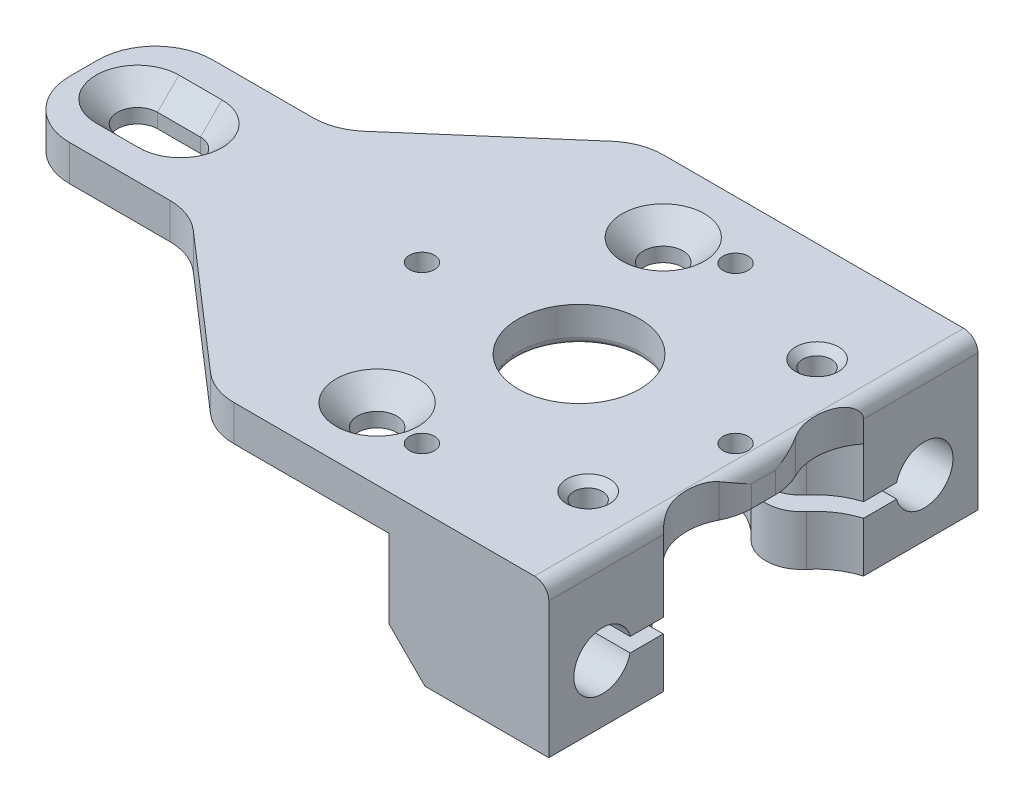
ISO-10303-21;
HEADER;
FILE_DESCRIPTION(('STEP AP214'),'2;1');
FILE_NAME('part.step','',(''),(''),'','','');
FILE_SCHEMA(('AUTOMOTIVE_DESIGN { 1 0 10303 214 1 1 1 1 }'));
ENDSEC;
DATA;
#1=APPLICATION_CONTEXT('core data for automotive mechanical design processes');
#2=APPLICATION_PROTOCOL_DEFINITION('international standard','automotive_design',2000,#1);
#3=PRODUCT_CONTEXT('',#1,'mechanical');
#4=PRODUCT('Part','Part','',(#3));
#5=PRODUCT_RELATED_PRODUCT_CATEGORY('part','',(#4));
#6=PRODUCT_DEFINITION_FORMATION('','',#4);
#7=PRODUCT_DEFINITION_CONTEXT('part definition',#1,'design');
#8=PRODUCT_DEFINITION('design','',#6,#7);
#9=PRODUCT_DEFINITION_SHAPE('','',#8);
#10=(LENGTH_UNIT() NAMED_UNIT(*) SI_UNIT(.MILLI.,.METRE.));
#11=(NAMED_UNIT(*) PLANE_ANGLE_UNIT() SI_UNIT($,.RADIAN.));
#12=(NAMED_UNIT(*) SI_UNIT($,.STERADIAN.) SOLID_ANGLE_UNIT());
#13=UNCERTAINTY_MEASURE_WITH_UNIT(LENGTH_MEASURE(1.E-05),#10,'distance_accuracy_value','');
#14=(GEOMETRIC_REPRESENTATION_CONTEXT(3) GLOBAL_UNCERTAINTY_ASSIGNED_CONTEXT((#13)) GLOBAL_UNIT_ASSIGNED_CONTEXT((#10,
#11,#12)) REPRESENTATION_CONTEXT('',''));
#15=CARTESIAN_POINT('',(0.,0.,0.));
#16=DIRECTION('',(0.,0.,1.));
#17=DIRECTION('',(1.,0.,0.));
#18=AXIS2_PLACEMENT_3D('',#15,#16,#17);
#19=CARTESIAN_POINT('',(0.,-13.,0.));
#20=DIRECTION('',(0.,-1.,0.));
#21=DIRECTION('',(0.,0.,-1.));
#22=AXIS2_PLACEMENT_3D('',#19,#20,#21);
#23=PLANE('',#22);
#24=CARTESIAN_POINT('',(86.5,-13.,-46.));
#25=DIRECTION('',(0.,-1.,0.));
#26=DIRECTION('',(0.,0.,-1.));
#27=AXIS2_PLACEMENT_3D('',#24,#25,#26);
#28=CIRCLE('',#27,1.99999999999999);
#29=CARTESIAN_POINT('',(86.5,-13.,-48.));
#30=VERTEX_POINT('',#29);
#31=EDGE_CURVE('E1519',#30,#30,#28,.F.);
#32=ORIENTED_EDGE('',*,*,#31,.T.);
#33=EDGE_LOOP('',(#32));
#34=FACE_BOUND('',#33,.T.);
#35=DIRECTION('',(-1.,0.,0.));
#36=VECTOR('',#35,1.);
#37=CARTESIAN_POINT('',(84.3349364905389,-13.,-49.75));
#38=LINE('',#37,#36);
#39=CARTESIAN_POINT('',(84.3349364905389,-13.,-49.75));
#40=VERTEX_POINT('',#39);
#41=CARTESIAN_POINT('',(88.6650635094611,-13.,-49.75));
#42=VERTEX_POINT('',#41);
#43=EDGE_CURVE('E1355',#40,#42,#38,.F.);
#44=ORIENTED_EDGE('',*,*,#43,.T.);
#45=DIRECTION('',(-0.499999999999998,0.,-0.86602540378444));
#46=VECTOR('',#45,1.);
#47=CARTESIAN_POINT('',(88.6650635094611,-13.,-49.75));
#48=LINE('',#47,#46);
#49=CARTESIAN_POINT('',(90.8301270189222,-13.,-46.));
#50=VERTEX_POINT('',#49);
#51=EDGE_CURVE('E1349',#42,#50,#48,.F.);
#52=ORIENTED_EDGE('',*,*,#51,.T.);
#53=DIRECTION('',(0.499999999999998,0.,-0.86602540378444));
#54=VECTOR('',#53,1.);
#55=CARTESIAN_POINT('',(90.8301270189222,-13.,-46.));
#56=LINE('',#55,#54);
#57=CARTESIAN_POINT('',(88.6650635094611,-13.,-42.25));
#58=VERTEX_POINT('',#57);
#59=EDGE_CURVE('E1346',#50,#58,#56,.F.);
#60=ORIENTED_EDGE('',*,*,#59,.T.);
#61=DIRECTION('',(1.,0.,0.));
#62=VECTOR('',#61,1.);
#63=CARTESIAN_POINT('',(88.6650635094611,-13.,-42.25));
#64=LINE('',#63,#62);
#65=CARTESIAN_POINT('',(84.3349364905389,-13.,-42.25));
#66=VERTEX_POINT('',#65);
#67=EDGE_CURVE('E1374',#58,#66,#64,.F.);
#68=ORIENTED_EDGE('',*,*,#67,.T.);
#69=DIRECTION('',(0.500000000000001,0.,0.866025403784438));
#70=VECTOR('',#69,1.);
#71=CARTESIAN_POINT('',(84.3349364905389,-13.,-42.25));
#72=LINE('',#71,#70);
#73=CARTESIAN_POINT('',(82.1698729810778,-13.,-46.));
#74=VERTEX_POINT('',#73);
#75=EDGE_CURVE('E293',#66,#74,#72,.F.);
#76=ORIENTED_EDGE('',*,*,#75,.T.);
#77=DIRECTION('',(-0.500000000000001,0.,0.866025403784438));
#78=VECTOR('',#77,1.);
#79=CARTESIAN_POINT('',(82.1698729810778,-13.,-46.));
#80=LINE('',#79,#78);
#81=EDGE_CURVE('E1361',#74,#40,#80,.F.);
#82=ORIENTED_EDGE('',*,*,#81,.T.);
#83=EDGE_LOOP('',(#44,#52,#60,#68,#76,#82));
#84=FACE_BOUND('',#83,.T.);
#85=ADVANCED_FACE('F17',(#34,#84),#23,.T.);
#86=CARTESIAN_POINT('',(86.5,5.,-46.));
#87=DIRECTION('',(0.,-1.,0.));
#88=DIRECTION('',(0.,0.,-1.));
#89=AXIS2_PLACEMENT_3D('',#86,#87,#88);
#90=CYLINDRICAL_SURFACE('',#89,1.99999999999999);
#91=CARTESIAN_POINT('',(86.5,-9.00000000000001,-46.));
#92=DIRECTION('',(0.,-1.,0.));
#93=DIRECTION('',(0.,0.,-1.));
#94=AXIS2_PLACEMENT_3D('',#91,#92,#93);
#95=CIRCLE('',#94,1.99999999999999);
#96=CARTESIAN_POINT('',(86.5,-9.00000000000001,-48.));
#97=VERTEX_POINT('',#96);
#98=EDGE_CURVE('E1395',#97,#97,#95,.F.);
#99=ORIENTED_EDGE('',*,*,#98,.T.);
#100=EDGE_LOOP('',(#99));
#101=FACE_BOUND('',#100,.T.);
#102=ORIENTED_EDGE('',*,*,#31,.F.);
#103=EDGE_LOOP('',(#102));
#104=FACE_BOUND('',#103,.T.);
#105=ADVANCED_FACE('F726',(#101,#104),#90,.F.);
#106=CARTESIAN_POINT('',(0.,-13.,0.));
#107=DIRECTION('',(0.,-1.,0.));
#108=DIRECTION('',(0.,0.,-1.));
#109=AXIS2_PLACEMENT_3D('',#106,#107,#108);
#110=PLANE('',#109);
#111=CARTESIAN_POINT('',(86.5,-13.,-14.));
#112=DIRECTION('',(0.,-1.,0.));
#113=DIRECTION('',(0.,0.,-1.));
#114=AXIS2_PLACEMENT_3D('',#111,#112,#113);
#115=CIRCLE('',#114,1.99999999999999);
#116=CARTESIAN_POINT('',(86.5,-13.,-16.));
#117=VERTEX_POINT('',#116);
#118=EDGE_CURVE('E1347',#117,#117,#115,.F.);
#119=ORIENTED_EDGE('',*,*,#118,.T.);
#120=EDGE_LOOP('',(#119));
#121=FACE_BOUND('',#120,.T.);
#122=DIRECTION('',(-1.,0.,0.));
#123=VECTOR('',#122,1.);
#124=CARTESIAN_POINT('',(84.3349364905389,-13.,-17.75));
#125=LINE('',#124,#123);
#126=CARTESIAN_POINT('',(84.3349364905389,-13.,-17.75));
#127=VERTEX_POINT('',#126);
#128=CARTESIAN_POINT('',(88.6650635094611,-13.,-17.75));
#129=VERTEX_POINT('',#128);
#130=EDGE_CURVE('E1153',#127,#129,#125,.F.);
#131=ORIENTED_EDGE('',*,*,#130,.T.);
#132=DIRECTION('',(-0.5,0.,-0.866025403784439));
#133=VECTOR('',#132,1.);
#134=CARTESIAN_POINT('',(88.6650635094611,-13.,-17.75));
#135=LINE('',#134,#133);
#136=CARTESIAN_POINT('',(90.8301270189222,-13.,-14.));
#137=VERTEX_POINT('',#136);
#138=EDGE_CURVE('E1154',#129,#137,#135,.F.);
#139=ORIENTED_EDGE('',*,*,#138,.T.);
#140=DIRECTION('',(0.5,0.,-0.866025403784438));
#141=VECTOR('',#140,1.);
#142=CARTESIAN_POINT('',(90.8301270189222,-13.,-14.));
#143=LINE('',#142,#141);
#144=CARTESIAN_POINT('',(88.6650635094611,-13.,-10.25));
#145=VERTEX_POINT('',#144);
#146=EDGE_CURVE('E1150',#137,#145,#143,.F.);
#147=ORIENTED_EDGE('',*,*,#146,.T.);
#148=DIRECTION('',(1.,0.,0.));
#149=VECTOR('',#148,1.);
#150=CARTESIAN_POINT('',(88.6650635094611,-13.,-10.25));
#151=LINE('',#150,#149);
#152=CARTESIAN_POINT('',(84.3349364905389,-13.,-10.25));
#153=VERTEX_POINT('',#152);
#154=EDGE_CURVE('E1415',#145,#153,#151,.F.);
#155=ORIENTED_EDGE('',*,*,#154,.T.);
#156=DIRECTION('',(0.499999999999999,0.,0.866025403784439));
#157=VECTOR('',#156,1.);
#158=CARTESIAN_POINT('',(84.3349364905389,-13.,-10.25));
#159=LINE('',#158,#157);
#160=CARTESIAN_POINT('',(82.1698729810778,-13.,-14.));
#161=VERTEX_POINT('',#160);
#162=EDGE_CURVE('E1408',#153,#161,#159,.F.);
#163=ORIENTED_EDGE('',*,*,#162,.T.);
#164=DIRECTION('',(-0.500000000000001,0.,0.866025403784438));
#165=VECTOR('',#164,1.);
#166=CARTESIAN_POINT('',(82.1698729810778,-13.,-14.));
#167=LINE('',#166,#165);
#168=EDGE_CURVE('E1164',#161,#127,#167,.F.);
#169=ORIENTED_EDGE('',*,*,#168,.T.);
#170=EDGE_LOOP('',(#131,#139,#147,#155,#163,#169));
#171=FACE_BOUND('',#170,.T.);
#172=ADVANCED_FACE('F723',(#121,#171),#110,.T.);
#173=CARTESIAN_POINT('',(86.5,5.,-14.));
#174=DIRECTION('',(0.,-1.,0.));
#175=DIRECTION('',(0.,0.,-1.));
#176=AXIS2_PLACEMENT_3D('',#173,#174,#175);
#177=CYLINDRICAL_SURFACE('',#176,1.99999999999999);
#178=CARTESIAN_POINT('',(86.5,-9.00000000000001,-14.));
#179=DIRECTION('',(0.,-1.,0.));
#180=DIRECTION('',(0.,0.,-1.));
#181=AXIS2_PLACEMENT_3D('',#178,#179,#180);
#182=CIRCLE('',#181,1.99999999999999);
#183=CARTESIAN_POINT('',(86.5,-9.00000000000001,-16.));
#184=VERTEX_POINT('',#183);
#185=EDGE_CURVE('E1334',#184,#184,#182,.F.);
#186=ORIENTED_EDGE('',*,*,#185,.T.);
#187=EDGE_LOOP('',(#186));
#188=FACE_BOUND('',#187,.T.);
#189=ORIENTED_EDGE('',*,*,#118,.F.);
#190=EDGE_LOOP('',(#189));
#191=FACE_BOUND('',#190,.T.);
#192=ADVANCED_FACE('F719',(#188,#191),#177,.F.);
#193=CARTESIAN_POINT('',(95.,34.6816441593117,-44.));
#194=DIRECTION('',(0.,0.,1.));
#195=DIRECTION('',(1.,0.,0.));
#196=AXIS2_PLACEMENT_3D('',#193,#194,#195);
#197=PLANE('',#196);
#198=DIRECTION('',(1.,0.,0.));
#199=VECTOR('',#198,1.);
#200=CARTESIAN_POINT('',(0.,-9.00000000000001,-44.));
#201=LINE('',#200,#199);
#202=CARTESIAN_POINT('',(75.1625380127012,-9.00000000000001,-44.));
#203=VERTEX_POINT('',#202);
#204=CARTESIAN_POINT('',(72.6857558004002,-9.00000000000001,-44.));
#205=VERTEX_POINT('',#204);
#206=EDGE_CURVE('E1327',#203,#205,#201,.F.);
#207=ORIENTED_EDGE('',*,*,#206,.T.);
#208=DIRECTION('',(0.,1.,0.));
#209=VECTOR('',#208,1.);
#210=CARTESIAN_POINT('',(72.6857558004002,-16.,-44.));
#211=LINE('',#210,#209);
#212=CARTESIAN_POINT('',(72.6857558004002,-11.,-44.));
#213=VERTEX_POINT('',#212);
#214=EDGE_CURVE('E1343',#205,#213,#211,.F.);
#215=ORIENTED_EDGE('',*,*,#214,.T.);
#216=DIRECTION('',(0.707106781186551,-0.707106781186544,0.));
#217=VECTOR('',#216,1.);
#218=CARTESIAN_POINT('',(77.6857558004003,-16.,-44.));
#219=LINE('',#218,#217);
#220=CARTESIAN_POINT('',(75.1625380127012,-13.4767822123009,-44.));
#221=VERTEX_POINT('',#220);
#222=EDGE_CURVE('E860',#221,#213,#219,.F.);
#223=ORIENTED_EDGE('',*,*,#222,.F.);
#224=DIRECTION('',(0.,-1.,0.));
#225=VECTOR('',#224,1.);
#226=CARTESIAN_POINT('',(75.1625380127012,11.180339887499,-44.));
#227=LINE('',#226,#225);
#228=EDGE_CURVE('E1385',#221,#203,#227,.F.);
#229=ORIENTED_EDGE('',*,*,#228,.T.);
#230=EDGE_LOOP('',(#207,#215,#223,#229));
#231=FACE_BOUND('',#230,.T.);
#232=ADVANCED_FACE('F715',(#231),#197,.T.);
#233=CARTESIAN_POINT('',(72.6857558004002,-16.,-60.));
#234=DIRECTION('',(1.,0.,0.));
#235=DIRECTION('',(0.,0.,-1.));
#236=AXIS2_PLACEMENT_3D('',#233,#234,#235);
#237=PLANE('',#236);
#238=DIRECTION('',(0.,0.,-1.));
#239=VECTOR('',#238,1.);
#240=CARTESIAN_POINT('',(72.6857558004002,-9.00000000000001,-54.738734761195));
#241=LINE('',#240,#239);
#242=CARTESIAN_POINT('',(72.6857558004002,-9.00000000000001,-48.627016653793));
#243=VERTEX_POINT('',#242);
#244=EDGE_CURVE('E1323',#205,#243,#241,.T.);
#245=ORIENTED_EDGE('',*,*,#244,.T.);
#246=CARTESIAN_POINT('',(72.6857558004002,-8.00000000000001,-52.5000000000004));
#247=DIRECTION('',(1.,0.,0.));
#248=DIRECTION('',(0.,0.,-1.));
#249=AXIS2_PLACEMENT_3D('',#246,#247,#248);
#250=CIRCLE('',#249,4.);
#251=CARTESIAN_POINT('',(72.6857558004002,-11.,-49.8542486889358));
#252=VERTEX_POINT('',#251);
#253=EDGE_CURVE('E284',#243,#252,#250,.T.);
#254=ORIENTED_EDGE('',*,*,#253,.T.);
#255=DIRECTION('',(0.,0.,1.));
#256=VECTOR('',#255,1.);
#257=CARTESIAN_POINT('',(72.6857558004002,-11.,0.));
#258=LINE('',#257,#256);
#259=EDGE_CURVE('E852',#213,#252,#258,.F.);
#260=ORIENTED_EDGE('',*,*,#259,.F.);
#261=ORIENTED_EDGE('',*,*,#214,.F.);
#262=EDGE_LOOP('',(#245,#254,#260,#261));
#263=FACE_BOUND('',#262,.T.);
#264=ADVANCED_FACE('F711',(#263),#237,.F.);
#265=CARTESIAN_POINT('',(90.8301270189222,-13.,-46.));
#266=DIRECTION('',(0.86602540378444,0.,0.499999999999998));
#267=DIRECTION('',(0.499999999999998,0.,-0.86602540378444));
#268=AXIS2_PLACEMENT_3D('',#265,#266,#267);
#269=PLANE('',#268);
#270=DIRECTION('',(0.,1.,0.));
#271=VECTOR('',#270,1.);
#272=CARTESIAN_POINT('',(88.6650635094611,-13.,-42.25));
#273=LINE('',#272,#271);
#274=CARTESIAN_POINT('',(88.6650635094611,-16.,-42.25));
#275=VERTEX_POINT('',#274);
#276=EDGE_CURVE('E1371',#275,#58,#273,.T.);
#277=ORIENTED_EDGE('',*,*,#276,.T.);
#278=ORIENTED_EDGE('',*,*,#59,.F.);
#279=DIRECTION('',(0.,1.,0.));
#280=VECTOR('',#279,1.);
#281=CARTESIAN_POINT('',(90.8301270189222,-13.,-46.));
#282=LINE('',#281,#280);
#283=CARTESIAN_POINT('',(90.8301270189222,-16.,-46.));
#284=VERTEX_POINT('',#283);
#285=EDGE_CURVE('E1352',#50,#284,#282,.F.);
#286=ORIENTED_EDGE('',*,*,#285,.T.);
#287=DIRECTION('',(0.499999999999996,0.,-0.866025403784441));
#288=VECTOR('',#287,1.);
#289=CARTESIAN_POINT('',(88.6650635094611,-16.,-42.25));
#290=LINE('',#289,#288);
#291=EDGE_CURVE('E849',#275,#284,#290,.T.);
#292=ORIENTED_EDGE('',*,*,#291,.F.);
#293=EDGE_LOOP('',(#277,#278,#286,#292));
#294=FACE_BOUND('',#293,.T.);
#295=ADVANCED_FACE('F707',(#294),#269,.F.);
#296=CARTESIAN_POINT('',(88.6650635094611,-13.,-49.75));
#297=DIRECTION('',(0.86602540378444,0.,-0.499999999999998));
#298=DIRECTION('',(-0.499999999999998,0.,-0.86602540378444));
#299=AXIS2_PLACEMENT_3D('',#296,#297,#298);
#300=PLANE('',#299);
#301=ORIENTED_EDGE('',*,*,#285,.F.);
#302=ORIENTED_EDGE('',*,*,#51,.F.);
#303=DIRECTION('',(0.,1.,0.));
#304=VECTOR('',#303,1.);
#305=CARTESIAN_POINT('',(88.6650635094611,-13.,-49.75));
#306=LINE('',#305,#304);
#307=CARTESIAN_POINT('',(88.6650635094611,-16.,-49.75));
#308=VERTEX_POINT('',#307);
#309=EDGE_CURVE('E1358',#42,#308,#306,.F.);
#310=ORIENTED_EDGE('',*,*,#309,.T.);
#311=DIRECTION('',(-0.499999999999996,0.,-0.866025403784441));
#312=VECTOR('',#311,1.);
#313=CARTESIAN_POINT('',(90.8301270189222,-16.,-46.));
#314=LINE('',#313,#312);
#315=EDGE_CURVE('E846',#284,#308,#314,.T.);
#316=ORIENTED_EDGE('',*,*,#315,.F.);
#317=EDGE_LOOP('',(#301,#302,#310,#316));
#318=FACE_BOUND('',#317,.T.);
#319=ADVANCED_FACE('F703',(#318),#300,.F.);
#320=CARTESIAN_POINT('',(84.3349364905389,-13.,-49.75));
#321=DIRECTION('',(0.,0.,-1.));
#322=DIRECTION('',(-1.,0.,0.));
#323=AXIS2_PLACEMENT_3D('',#320,#321,#322);
#324=PLANE('',#323);
#325=ORIENTED_EDGE('',*,*,#309,.F.);
#326=ORIENTED_EDGE('',*,*,#43,.F.);
#327=DIRECTION('',(0.,1.,0.));
#328=VECTOR('',#327,1.);
#329=CARTESIAN_POINT('',(84.3349364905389,-13.,-49.75));
#330=LINE('',#329,#328);
#331=CARTESIAN_POINT('',(84.3349364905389,-16.,-49.75));
#332=VERTEX_POINT('',#331);
#333=EDGE_CURVE('E1364',#40,#332,#330,.F.);
#334=ORIENTED_EDGE('',*,*,#333,.T.);
#335=DIRECTION('',(1.,0.,0.));
#336=VECTOR('',#335,1.);
#337=CARTESIAN_POINT('',(0.,-16.,-49.75));
#338=LINE('',#337,#336);
#339=EDGE_CURVE('E843',#308,#332,#338,.F.);
#340=ORIENTED_EDGE('',*,*,#339,.F.);
#341=EDGE_LOOP('',(#325,#326,#334,#340));
#342=FACE_BOUND('',#341,.T.);
#343=ADVANCED_FACE('F699',(#342),#324,.F.);
#344=CARTESIAN_POINT('',(82.1698729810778,-13.,-46.));
#345=DIRECTION('',(-0.866025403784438,0.,-0.500000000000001));
#346=DIRECTION('',(-0.500000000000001,0.,0.866025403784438));
#347=AXIS2_PLACEMENT_3D('',#344,#345,#346);
#348=PLANE('',#347);
#349=ORIENTED_EDGE('',*,*,#333,.F.);
#350=ORIENTED_EDGE('',*,*,#81,.F.);
#351=DIRECTION('',(0.,1.,0.));
#352=VECTOR('',#351,1.);
#353=CARTESIAN_POINT('',(82.1698729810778,-13.,-46.));
#354=LINE('',#353,#352);
#355=CARTESIAN_POINT('',(82.1698729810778,-16.,-46.));
#356=VERTEX_POINT('',#355);
#357=EDGE_CURVE('E1368',#74,#356,#354,.F.);
#358=ORIENTED_EDGE('',*,*,#357,.T.);
#359=DIRECTION('',(-0.5,0.,0.866025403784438));
#360=VECTOR('',#359,1.);
#361=CARTESIAN_POINT('',(84.3349364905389,-16.,-49.75));
#362=LINE('',#361,#360);
#363=EDGE_CURVE('E840',#332,#356,#362,.T.);
#364=ORIENTED_EDGE('',*,*,#363,.F.);
#365=EDGE_LOOP('',(#349,#350,#358,#364));
#366=FACE_BOUND('',#365,.T.);
#367=ADVANCED_FACE('F696',(#366),#348,.F.);
#368=CARTESIAN_POINT('',(84.3349364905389,-13.,-42.25));
#369=DIRECTION('',(-0.866025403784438,0.,0.500000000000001));
#370=DIRECTION('',(0.500000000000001,0.,0.866025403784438));
#371=AXIS2_PLACEMENT_3D('',#368,#369,#370);
#372=PLANE('',#371);
#373=ORIENTED_EDGE('',*,*,#357,.F.);
#374=ORIENTED_EDGE('',*,*,#75,.F.);
#375=DIRECTION('',(0.,1.,0.));
#376=VECTOR('',#375,1.);
#377=CARTESIAN_POINT('',(84.3349364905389,-13.,-42.25));
#378=LINE('',#377,#376);
#379=CARTESIAN_POINT('',(84.3349364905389,-16.,-42.25));
#380=VERTEX_POINT('',#379);
#381=EDGE_CURVE('E1377',#66,#380,#378,.F.);
#382=ORIENTED_EDGE('',*,*,#381,.T.);
#383=DIRECTION('',(0.500000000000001,0.,0.866025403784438));
#384=VECTOR('',#383,1.);
#385=CARTESIAN_POINT('',(82.1698729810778,-16.,-46.));
#386=LINE('',#385,#384);
#387=EDGE_CURVE('E837',#356,#380,#386,.T.);
#388=ORIENTED_EDGE('',*,*,#387,.F.);
#389=EDGE_LOOP('',(#373,#374,#382,#388));
#390=FACE_BOUND('',#389,.T.);
#391=ADVANCED_FACE('F692',(#390),#372,.F.);
#392=CARTESIAN_POINT('',(88.6650635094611,-13.,-42.25));
#393=DIRECTION('',(0.,0.,1.));
#394=DIRECTION('',(1.,0.,0.));
#395=AXIS2_PLACEMENT_3D('',#392,#393,#394);
#396=PLANE('',#395);
#397=ORIENTED_EDGE('',*,*,#381,.F.);
#398=ORIENTED_EDGE('',*,*,#67,.F.);
#399=ORIENTED_EDGE('',*,*,#276,.F.);
#400=DIRECTION('',(1.,0.,0.));
#401=VECTOR('',#400,1.);
#402=CARTESIAN_POINT('',(0.,-16.,-42.25));
#403=LINE('',#402,#401);
#404=EDGE_CURVE('E833',#380,#275,#403,.T.);
#405=ORIENTED_EDGE('',*,*,#404,.F.);
#406=EDGE_LOOP('',(#397,#398,#399,#405));
#407=FACE_BOUND('',#406,.T.);
#408=ADVANCED_FACE('F688',(#407),#396,.F.);
#409=CARTESIAN_POINT('',(86.3428779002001,11.180339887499,-44.));
#410=DIRECTION('',(0.,-1.,0.));
#411=DIRECTION('',(0.,0.,-1.));
#412=AXIS2_PLACEMENT_3D('',#409,#410,#411);
#413=CYLINDRICAL_SURFACE('',#412,5.);
#414=CARTESIAN_POINT('',(86.3428779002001,-9.00000000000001,-44.));
#415=DIRECTION('',(0.,-1.,0.));
#416=DIRECTION('',(0.,0.,-1.));
#417=AXIS2_PLACEMENT_3D('',#414,#415,#416);
#418=CIRCLE('',#417,5.);
#419=CARTESIAN_POINT('',(90.1922280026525,-9.00000000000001,-40.808996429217));
#420=VERTEX_POINT('',#419);
#421=CARTESIAN_POINT('',(82.6160979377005,-9.00000000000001,-40.6666666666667));
#422=VERTEX_POINT('',#421);
#423=EDGE_CURVE('E1394',#420,#422,#418,.T.);
#424=ORIENTED_EDGE('',*,*,#423,.T.);
#425=DIRECTION('',(0.,-1.,0.));
#426=VECTOR('',#425,1.);
#427=CARTESIAN_POINT('',(82.6160979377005,11.180339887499,-40.6666666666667));
#428=LINE('',#427,#426);
#429=CARTESIAN_POINT('',(82.6160979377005,-16.,-40.6666666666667));
#430=VERTEX_POINT('',#429);
#431=EDGE_CURVE('E1379',#422,#430,#428,.T.);
#432=ORIENTED_EDGE('',*,*,#431,.T.);
#433=CARTESIAN_POINT('',(86.3428779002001,-16.,-44.));
#434=DIRECTION('',(0.,-1.,0.));
#435=DIRECTION('',(0.,0.,-1.));
#436=AXIS2_PLACEMENT_3D('',#433,#434,#435);
#437=CIRCLE('',#436,5.);
#438=CARTESIAN_POINT('',(90.1922280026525,-16.,-40.808996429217));
#439=VERTEX_POINT('',#438);
#440=EDGE_CURVE('E1586',#439,#430,#437,.T.);
#441=ORIENTED_EDGE('',*,*,#440,.F.);
#442=DIRECTION('',(0.,1.,0.));
#443=VECTOR('',#442,1.);
#444=CARTESIAN_POINT('',(90.1922280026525,11.180339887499,-40.808996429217));
#445=LINE('',#444,#443);
#446=EDGE_CURVE('E1326',#439,#420,#445,.T.);
#447=ORIENTED_EDGE('',*,*,#446,.T.);
#448=EDGE_LOOP('',(#424,#432,#441,#447));
#449=FACE_BOUND('',#448,.T.);
#450=ADVANCED_FACE('F684',(#449),#413,.T.);
#451=CARTESIAN_POINT('',(75.1625380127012,11.180339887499,-34.));
#452=DIRECTION('',(0.,-1.,0.));
#453=DIRECTION('',(0.,0.,-1.));
#454=AXIS2_PLACEMENT_3D('',#451,#452,#453);
#455=CYLINDRICAL_SURFACE('',#454,10.);
#456=ORIENTED_EDGE('',*,*,#228,.F.);
#457=CARTESIAN_POINT('',(75.1625380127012,-13.4767822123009,-34.));
#458=DIRECTION('',(-0.707106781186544,-0.707106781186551,0.));
#459=DIRECTION('',(0.707106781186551,-0.707106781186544,0.));
#460=AXIS2_PLACEMENT_3D('',#457,#458,#459);
#461=ELLIPSE('',#460,14.1421356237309,10.);
#462=CARTESIAN_POINT('',(77.6857558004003,-16.,-43.6764338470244));
#463=VERTEX_POINT('',#462);
#464=EDGE_CURVE('E864',#463,#221,#461,.F.);
#465=ORIENTED_EDGE('',*,*,#464,.F.);
#466=CARTESIAN_POINT('',(75.1625380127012,-16.,-34.));
#467=DIRECTION('',(0.,-1.,0.));
#468=DIRECTION('',(0.,0.,-1.));
#469=AXIS2_PLACEMENT_3D('',#466,#467,#468);
#470=CIRCLE('',#469,10.);
#471=EDGE_CURVE('E830',#430,#463,#470,.F.);
#472=ORIENTED_EDGE('',*,*,#471,.F.);
#473=ORIENTED_EDGE('',*,*,#431,.F.);
#474=CARTESIAN_POINT('',(75.1625380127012,-9.00000000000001,-34.));
#475=DIRECTION('',(0.,-1.,0.));
#476=DIRECTION('',(0.,0.,-1.));
#477=AXIS2_PLACEMENT_3D('',#474,#475,#476);
#478=CIRCLE('',#477,10.);
#479=EDGE_CURVE('E1400',#422,#203,#478,.F.);
#480=ORIENTED_EDGE('',*,*,#479,.T.);
#481=EDGE_LOOP('',(#456,#465,#472,#473,#480));
#482=FACE_BOUND('',#481,.T.);
#483=ADVANCED_FACE('F680',(#482),#455,.F.);
#484=CARTESIAN_POINT('',(0.,-7.,-54.738734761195));
#485=DIRECTION('',(0.,1.,0.));
#486=DIRECTION('',(0.,0.,1.));
#487=AXIS2_PLACEMENT_3D('',#484,#485,#486);
#488=PLANE('',#487);
#489=CARTESIAN_POINT('',(97.8909282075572,-7.,-34.4269892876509));
#490=DIRECTION('',(0.,1.,0.));
#491=DIRECTION('',(0.,0.,1.));
#492=AXIS2_PLACEMENT_3D('',#489,#490,#491);
#493=CIRCLE('',#492,10.);
#494=CARTESIAN_POINT('',(95.,-7.00000000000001,-44.));
#495=VERTEX_POINT('',#494);
#496=CARTESIAN_POINT('',(90.1922280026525,-7.,-40.808996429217));
#497=VERTEX_POINT('',#496);
#498=EDGE_CURVE('E1439',#495,#497,#493,.T.);
#499=ORIENTED_EDGE('',*,*,#498,.T.);
#500=CARTESIAN_POINT('',(86.3428779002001,-7.,-44.));
#501=DIRECTION('',(0.,-1.,0.));
#502=DIRECTION('',(0.,0.,-1.));
#503=AXIS2_PLACEMENT_3D('',#500,#501,#502);
#504=CIRCLE('',#503,5.);
#505=CARTESIAN_POINT('',(82.6160979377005,-7.,-40.6666666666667));
#506=VERTEX_POINT('',#505);
#507=EDGE_CURVE('E1425',#506,#497,#504,.F.);
#508=ORIENTED_EDGE('',*,*,#507,.F.);
#509=CARTESIAN_POINT('',(75.1625380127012,-7.,-34.));
#510=DIRECTION('',(0.,-1.,0.));
#511=DIRECTION('',(0.,0.,-1.));
#512=AXIS2_PLACEMENT_3D('',#509,#510,#511);
#513=CIRCLE('',#512,10.);
#514=CARTESIAN_POINT('',(75.1625380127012,-7.,-44.));
#515=VERTEX_POINT('',#514);
#516=EDGE_CURVE('E1458',#506,#515,#513,.F.);
#517=ORIENTED_EDGE('',*,*,#516,.T.);
#518=DIRECTION('',(1.,0.,0.));
#519=VECTOR('',#518,1.);
#520=CARTESIAN_POINT('',(95.,-7.00000000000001,-44.));
#521=LINE('',#520,#519);
#522=CARTESIAN_POINT('',(72.6857558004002,-7.00000000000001,-44.));
#523=VERTEX_POINT('',#522);
#524=EDGE_CURVE('E1337',#523,#515,#521,.T.);
#525=ORIENTED_EDGE('',*,*,#524,.F.);
#526=DIRECTION('',(0.,0.,-1.));
#527=VECTOR('',#526,1.);
#528=CARTESIAN_POINT('',(72.6857558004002,-7.00000000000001,-60.));
#529=LINE('',#528,#527);
#530=CARTESIAN_POINT('',(72.6857558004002,-7.,-48.627016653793));
#531=VERTEX_POINT('',#530);
#532=EDGE_CURVE('E877',#523,#531,#529,.T.);
#533=ORIENTED_EDGE('',*,*,#532,.T.);
#534=DIRECTION('',(1.,0.,0.));
#535=VECTOR('',#534,1.);
#536=CARTESIAN_POINT('',(69.,-7.,-48.627016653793));
#537=LINE('',#536,#535);
#538=CARTESIAN_POINT('',(95.,-7.,-48.627016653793));
#539=VERTEX_POINT('',#538);
#540=EDGE_CURVE('E1387',#531,#539,#537,.T.);
#541=ORIENTED_EDGE('',*,*,#540,.T.);
#542=DIRECTION('',(0.,0.,-1.));
#543=VECTOR('',#542,1.);
#544=CARTESIAN_POINT('',(95.,-7.00000000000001,-60.));
#545=LINE('',#544,#543);
#546=EDGE_CURVE('E811',#495,#539,#545,.T.);
#547=ORIENTED_EDGE('',*,*,#546,.F.);
#548=EDGE_LOOP('',(#499,#508,#517,#525,#533,#541,#547));
#549=FACE_BOUND('',#548,.T.);
#550=CARTESIAN_POINT('',(86.5,-7.,-46.));
#551=DIRECTION('',(0.,-1.,0.));
#552=DIRECTION('',(0.,0.,-1.));
#553=AXIS2_PLACEMENT_3D('',#550,#551,#552);
#554=CIRCLE('',#553,1.99999999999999);
#555=CARTESIAN_POINT('',(86.5,-7.,-48.));
#556=VERTEX_POINT('',#555);
#557=EDGE_CURVE('E1595',#556,#556,#554,.F.);
#558=ORIENTED_EDGE('',*,*,#557,.T.);
#559=EDGE_LOOP('',(#558));
#560=FACE_BOUND('',#559,.T.);
#561=ADVANCED_FACE('F677',(#549,#560),#488,.F.);
#562=CARTESIAN_POINT('',(69.,-8.00000000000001,-52.5000000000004));
#563=DIRECTION('',(1.,0.,0.));
#564=DIRECTION('',(0.,0.,-1.));
#565=AXIS2_PLACEMENT_3D('',#562,#563,#564);
#566=CYLINDRICAL_SURFACE('',#565,4.);
#567=CARTESIAN_POINT('',(72.6857558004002,-8.00000000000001,-52.5000000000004));
#568=DIRECTION('',(1.,0.,0.));
#569=DIRECTION('',(0.,0.,-1.));
#570=AXIS2_PLACEMENT_3D('',#567,#568,#569);
#571=CIRCLE('',#570,4.);
#572=CARTESIAN_POINT('',(72.6857558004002,-11.,-55.145751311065));
#573=VERTEX_POINT('',#572);
#574=EDGE_CURVE('E880',#531,#573,#571,.F.);
#575=ORIENTED_EDGE('',*,*,#574,.T.);
#576=CARTESIAN_POINT('',(69.6857558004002,-8.00000000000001,-52.5000000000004));
#577=DIRECTION('',(-0.707106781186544,-0.707106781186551,0.));
#578=DIRECTION('',(0.707106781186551,-0.707106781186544,0.));
#579=AXIS2_PLACEMENT_3D('',#576,#577,#578);
#580=ELLIPSE('',#579,5.6568542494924,4.);
#581=EDGE_CURVE('E869',#252,#573,#580,.F.);
#582=ORIENTED_EDGE('',*,*,#581,.F.);
#583=ORIENTED_EDGE('',*,*,#253,.F.);
#584=DIRECTION('',(1.,0.,0.));
#585=VECTOR('',#584,1.);
#586=CARTESIAN_POINT('',(0.,-9.00000000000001,-48.627016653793));
#587=LINE('',#586,#585);
#588=CARTESIAN_POINT('',(95.,-9.00000000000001,-48.627016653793));
#589=VERTEX_POINT('',#588);
#590=EDGE_CURVE('E1392',#243,#589,#587,.T.);
#591=ORIENTED_EDGE('',*,*,#590,.T.);
#592=CARTESIAN_POINT('',(95.,-8.00000000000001,-52.5000000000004));
#593=DIRECTION('',(1.,0.,0.));
#594=DIRECTION('',(0.,0.,-1.));
#595=AXIS2_PLACEMENT_3D('',#592,#593,#594);
#596=CIRCLE('',#595,4.);
#597=EDGE_CURVE('E810',#539,#589,#596,.F.);
#598=ORIENTED_EDGE('',*,*,#597,.F.);
#599=ORIENTED_EDGE('',*,*,#540,.F.);
#600=EDGE_LOOP('',(#575,#582,#583,#591,#598,#599));
#601=FACE_BOUND('',#600,.T.);
#602=ADVANCED_FACE('F673',(#601),#566,.F.);
#603=CARTESIAN_POINT('',(0.,-9.00000000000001,-54.738734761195));
#604=DIRECTION('',(0.,-1.,0.));
#605=DIRECTION('',(0.,0.,-1.));
#606=AXIS2_PLACEMENT_3D('',#603,#604,#605);
#607=PLANE('',#606);
#608=ORIENTED_EDGE('',*,*,#206,.F.);
#609=ORIENTED_EDGE('',*,*,#479,.F.);
#610=ORIENTED_EDGE('',*,*,#423,.F.);
#611=CARTESIAN_POINT('',(97.8909282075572,-9.00000000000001,-34.4269892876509));
#612=DIRECTION('',(0.,1.,0.));
#613=DIRECTION('',(0.,0.,1.));
#614=AXIS2_PLACEMENT_3D('',#611,#612,#613);
#615=CIRCLE('',#614,10.);
#616=CARTESIAN_POINT('',(95.,-9.00000000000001,-44.));
#617=VERTEX_POINT('',#616);
#618=EDGE_CURVE('E1382',#420,#617,#615,.F.);
#619=ORIENTED_EDGE('',*,*,#618,.T.);
#620=DIRECTION('',(0.,0.,-1.));
#621=VECTOR('',#620,1.);
#622=CARTESIAN_POINT('',(95.,-9.00000000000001,-60.));
#623=LINE('',#622,#621);
#624=EDGE_CURVE('E807',#589,#617,#623,.F.);
#625=ORIENTED_EDGE('',*,*,#624,.F.);
#626=ORIENTED_EDGE('',*,*,#590,.F.);
#627=ORIENTED_EDGE('',*,*,#244,.F.);
#628=EDGE_LOOP('',(#608,#609,#610,#619,#625,#626,#627));
#629=FACE_BOUND('',#628,.T.);
#630=ORIENTED_EDGE('',*,*,#98,.F.);
#631=EDGE_LOOP('',(#630));
#632=FACE_BOUND('',#631,.T.);
#633=ADVANCED_FACE('F669',(#629,#632),#607,.F.);
#634=CARTESIAN_POINT('',(97.8909282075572,11.180339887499,-34.4269892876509));
#635=DIRECTION('',(0.,1.,0.));
#636=DIRECTION('',(0.,0.,1.));
#637=AXIS2_PLACEMENT_3D('',#634,#635,#636);
#638=CYLINDRICAL_SURFACE('',#637,10.);
#639=ORIENTED_EDGE('',*,*,#446,.F.);
#640=CARTESIAN_POINT('',(97.8909282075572,-16.,-34.4269892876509));
#641=DIRECTION('',(0.,1.,0.));
#642=DIRECTION('',(0.,0.,1.));
#643=AXIS2_PLACEMENT_3D('',#640,#641,#642);
#644=CIRCLE('',#643,10.);
#645=CARTESIAN_POINT('',(95.,-16.,-44.));
#646=VERTEX_POINT('',#645);
#647=EDGE_CURVE('E836',#646,#439,#644,.T.);
#648=ORIENTED_EDGE('',*,*,#647,.F.);
#649=DIRECTION('',(0.,1.,0.));
#650=VECTOR('',#649,1.);
#651=CARTESIAN_POINT('',(95.,34.6816441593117,-44.));
#652=LINE('',#651,#650);
#653=EDGE_CURVE('E809',#617,#646,#652,.F.);
#654=ORIENTED_EDGE('',*,*,#653,.F.);
#655=ORIENTED_EDGE('',*,*,#618,.F.);
#656=EDGE_LOOP('',(#639,#648,#654,#655));
#657=FACE_BOUND('',#656,.T.);
#658=ADVANCED_FACE('F665',(#657),#638,.F.);
#659=CARTESIAN_POINT('',(90.8301270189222,-13.,-14.));
#660=DIRECTION('',(0.866025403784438,0.,0.5));
#661=DIRECTION('',(0.5,0.,-0.866025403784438));
#662=AXIS2_PLACEMENT_3D('',#659,#660,#661);
#663=PLANE('',#662);
#664=DIRECTION('',(0.,1.,0.));
#665=VECTOR('',#664,1.);
#666=CARTESIAN_POINT('',(88.6650635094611,-13.,-10.25));
#667=LINE('',#666,#665);
#668=CARTESIAN_POINT('',(88.6650635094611,-16.,-10.25));
#669=VERTEX_POINT('',#668);
#670=EDGE_CURVE('E1413',#669,#145,#667,.T.);
#671=ORIENTED_EDGE('',*,*,#670,.T.);
#672=ORIENTED_EDGE('',*,*,#146,.F.);
#673=DIRECTION('',(0.,1.,0.));
#674=VECTOR('',#673,1.);
#675=CARTESIAN_POINT('',(90.8301270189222,-13.,-14.));
#676=LINE('',#675,#674);
#677=CARTESIAN_POINT('',(90.8301270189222,-16.,-14.));
#678=VERTEX_POINT('',#677);
#679=EDGE_CURVE('E1148',#137,#678,#676,.F.);
#680=ORIENTED_EDGE('',*,*,#679,.T.);
#681=DIRECTION('',(0.5,0.,-0.866025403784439));
#682=VECTOR('',#681,1.);
#683=CARTESIAN_POINT('',(88.6650635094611,-16.,-10.25));
#684=LINE('',#683,#682);
#685=EDGE_CURVE('E789',#669,#678,#684,.T.);
#686=ORIENTED_EDGE('',*,*,#685,.F.);
#687=EDGE_LOOP('',(#671,#672,#680,#686));
#688=FACE_BOUND('',#687,.T.);
#689=ADVANCED_FACE('F661',(#688),#663,.F.);
#690=CARTESIAN_POINT('',(88.6650635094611,-13.,-17.75));
#691=DIRECTION('',(0.866025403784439,0.,-0.5));
#692=DIRECTION('',(-0.5,0.,-0.866025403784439));
#693=AXIS2_PLACEMENT_3D('',#690,#691,#692);
#694=PLANE('',#693);
#695=ORIENTED_EDGE('',*,*,#679,.F.);
#696=ORIENTED_EDGE('',*,*,#138,.F.);
#697=DIRECTION('',(0.,1.,0.));
#698=VECTOR('',#697,1.);
#699=CARTESIAN_POINT('',(88.6650635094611,-13.,-17.75));
#700=LINE('',#699,#698);
#701=CARTESIAN_POINT('',(88.6650635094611,-16.,-17.75));
#702=VERTEX_POINT('',#701);
#703=EDGE_CURVE('E1157',#129,#702,#700,.F.);
#704=ORIENTED_EDGE('',*,*,#703,.T.);
#705=DIRECTION('',(-0.5,0.,-0.866025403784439));
#706=VECTOR('',#705,1.);
#707=CARTESIAN_POINT('',(90.8301270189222,-16.,-14.));
#708=LINE('',#707,#706);
#709=EDGE_CURVE('E1133',#678,#702,#708,.T.);
#710=ORIENTED_EDGE('',*,*,#709,.F.);
#711=EDGE_LOOP('',(#695,#696,#704,#710));
#712=FACE_BOUND('',#711,.T.);
#713=ADVANCED_FACE('F657',(#712),#694,.F.);
#714=CARTESIAN_POINT('',(84.3349364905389,-13.,-17.75));
#715=DIRECTION('',(0.,0.,-1.));
#716=DIRECTION('',(-1.,0.,0.));
#717=AXIS2_PLACEMENT_3D('',#714,#715,#716);
#718=PLANE('',#717);
#719=ORIENTED_EDGE('',*,*,#703,.F.);
#720=ORIENTED_EDGE('',*,*,#130,.F.);
#721=DIRECTION('',(0.,1.,0.));
#722=VECTOR('',#721,1.);
#723=CARTESIAN_POINT('',(84.3349364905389,-13.,-17.75));
#724=LINE('',#723,#722);
#725=CARTESIAN_POINT('',(84.3349364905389,-16.,-17.75));
#726=VERTEX_POINT('',#725);
#727=EDGE_CURVE('E1168',#127,#726,#724,.F.);
#728=ORIENTED_EDGE('',*,*,#727,.T.);
#729=DIRECTION('',(1.,0.,0.));
#730=VECTOR('',#729,1.);
#731=CARTESIAN_POINT('',(0.,-16.,-17.75));
#732=LINE('',#731,#730);
#733=EDGE_CURVE('E1130',#702,#726,#732,.F.);
#734=ORIENTED_EDGE('',*,*,#733,.F.);
#735=EDGE_LOOP('',(#719,#720,#728,#734));
#736=FACE_BOUND('',#735,.T.);
#737=ADVANCED_FACE('F653',(#736),#718,.F.);
#738=CARTESIAN_POINT('',(82.1698729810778,-13.,-14.));
#739=DIRECTION('',(-0.866025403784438,0.,-0.500000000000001));
#740=DIRECTION('',(-0.500000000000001,0.,0.866025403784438));
#741=AXIS2_PLACEMENT_3D('',#738,#739,#740);
#742=PLANE('',#741);
#743=ORIENTED_EDGE('',*,*,#727,.F.);
#744=ORIENTED_EDGE('',*,*,#168,.F.);
#745=DIRECTION('',(0.,1.,0.));
#746=VECTOR('',#745,1.);
#747=CARTESIAN_POINT('',(82.1698729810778,-13.,-14.));
#748=LINE('',#747,#746);
#749=CARTESIAN_POINT('',(82.1698729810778,-16.,-14.));
#750=VERTEX_POINT('',#749);
#751=EDGE_CURVE('E1411',#161,#750,#748,.F.);
#752=ORIENTED_EDGE('',*,*,#751,.T.);
#753=DIRECTION('',(-0.500000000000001,0.,0.866025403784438));
#754=VECTOR('',#753,1.);
#755=CARTESIAN_POINT('',(84.3349364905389,-16.,-17.75));
#756=LINE('',#755,#754);
#757=EDGE_CURVE('E1127',#726,#750,#756,.T.);
#758=ORIENTED_EDGE('',*,*,#757,.F.);
#759=EDGE_LOOP('',(#743,#744,#752,#758));
#760=FACE_BOUND('',#759,.T.);
#761=ADVANCED_FACE('F649',(#760),#742,.F.);
#762=CARTESIAN_POINT('',(84.3349364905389,-13.,-10.25));
#763=DIRECTION('',(-0.866025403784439,0.,0.499999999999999));
#764=DIRECTION('',(0.499999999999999,0.,0.866025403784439));
#765=AXIS2_PLACEMENT_3D('',#762,#763,#764);
#766=PLANE('',#765);
#767=ORIENTED_EDGE('',*,*,#751,.F.);
#768=ORIENTED_EDGE('',*,*,#162,.F.);
#769=DIRECTION('',(0.,1.,0.));
#770=VECTOR('',#769,1.);
#771=CARTESIAN_POINT('',(84.3349364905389,-13.,-10.25));
#772=LINE('',#771,#770);
#773=CARTESIAN_POINT('',(84.3349364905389,-16.,-10.25));
#774=VERTEX_POINT('',#773);
#775=EDGE_CURVE('E1418',#153,#774,#772,.F.);
#776=ORIENTED_EDGE('',*,*,#775,.T.);
#777=DIRECTION('',(0.499999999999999,0.,0.866025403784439));
#778=VECTOR('',#777,1.);
#779=CARTESIAN_POINT('',(82.1698729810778,-16.,-14.));
#780=LINE('',#779,#778);
#781=EDGE_CURVE('E1124',#750,#774,#780,.T.);
#782=ORIENTED_EDGE('',*,*,#781,.F.);
#783=EDGE_LOOP('',(#767,#768,#776,#782));
#784=FACE_BOUND('',#783,.T.);
#785=ADVANCED_FACE('F645',(#784),#766,.F.);
#786=CARTESIAN_POINT('',(88.6650635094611,-13.,-10.25));
#787=DIRECTION('',(0.,0.,1.));
#788=DIRECTION('',(1.,0.,0.));
#789=AXIS2_PLACEMENT_3D('',#786,#787,#788);
#790=PLANE('',#789);
#791=ORIENTED_EDGE('',*,*,#775,.F.);
#792=ORIENTED_EDGE('',*,*,#154,.F.);
#793=ORIENTED_EDGE('',*,*,#670,.F.);
#794=DIRECTION('',(1.,0.,0.));
#795=VECTOR('',#794,1.);
#796=CARTESIAN_POINT('',(0.,-16.,-10.25));
#797=LINE('',#796,#795);
#798=EDGE_CURVE('E1120',#774,#669,#797,.T.);
#799=ORIENTED_EDGE('',*,*,#798,.F.);
#800=EDGE_LOOP('',(#791,#792,#793,#799));
#801=FACE_BOUND('',#800,.T.);
#802=ADVANCED_FACE('F641',(#801),#790,.F.);
#803=CARTESIAN_POINT('',(86.3428779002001,11.180339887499,-16.));
#804=DIRECTION('',(0.,-1.,0.));
#805=DIRECTION('',(0.,0.,-1.));
#806=AXIS2_PLACEMENT_3D('',#803,#804,#805);
#807=CYLINDRICAL_SURFACE('',#806,5.);
#808=DIRECTION('',(0.,1.,0.));
#809=VECTOR('',#808,1.);
#810=CARTESIAN_POINT('',(91.3428779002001,34.6816441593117,-16.));
#811=LINE('',#810,#809);
#812=CARTESIAN_POINT('',(91.3428779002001,-16.,-16.));
#813=VERTEX_POINT('',#812);
#814=CARTESIAN_POINT('',(91.3428779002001,-9.00000000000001,-16.));
#815=VERTEX_POINT('',#814);
#816=EDGE_CURVE('E1427',#813,#815,#811,.T.);
#817=ORIENTED_EDGE('',*,*,#816,.F.);
#818=CARTESIAN_POINT('',(86.3428779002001,-16.,-16.));
#819=DIRECTION('',(0.,-1.,0.));
#820=DIRECTION('',(0.,0.,-1.));
#821=AXIS2_PLACEMENT_3D('',#818,#819,#820);
#822=CIRCLE('',#821,5.);
#823=CARTESIAN_POINT('',(82.6160979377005,-16.,-19.3333333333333));
#824=VERTEX_POINT('',#823);
#825=EDGE_CURVE('E1117',#824,#813,#822,.T.);
#826=ORIENTED_EDGE('',*,*,#825,.F.);
#827=DIRECTION('',(0.,-1.,0.));
#828=VECTOR('',#827,1.);
#829=CARTESIAN_POINT('',(82.6160979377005,11.180339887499,-19.3333333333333));
#830=LINE('',#829,#828);
#831=CARTESIAN_POINT('',(82.6160979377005,-9.00000000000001,-19.3333333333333));
#832=VERTEX_POINT('',#831);
#833=EDGE_CURVE('E1422',#824,#832,#830,.F.);
#834=ORIENTED_EDGE('',*,*,#833,.T.);
#835=CARTESIAN_POINT('',(86.3428779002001,-9.00000000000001,-16.));
#836=DIRECTION('',(0.,-1.,0.));
#837=DIRECTION('',(0.,0.,-1.));
#838=AXIS2_PLACEMENT_3D('',#835,#836,#837);
#839=CIRCLE('',#838,5.);
#840=EDGE_CURVE('E1475',#832,#815,#839,.T.);
#841=ORIENTED_EDGE('',*,*,#840,.T.);
#842=EDGE_LOOP('',(#817,#826,#834,#841));
#843=FACE_BOUND('',#842,.T.);
#844=ADVANCED_FACE('F637',(#843),#807,.T.);
#845=CARTESIAN_POINT('',(72.6857558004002,-16.,-16.));
#846=DIRECTION('',(1.,0.,0.));
#847=DIRECTION('',(0.,0.,-1.));
#848=AXIS2_PLACEMENT_3D('',#845,#846,#847);
#849=PLANE('',#848);
#850=DIRECTION('',(0.,0.,-1.));
#851=VECTOR('',#850,1.);
#852=CARTESIAN_POINT('',(72.6857558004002,-9.00000000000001,-54.738734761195));
#853=LINE('',#852,#851);
#854=CARTESIAN_POINT('',(72.6857558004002,-9.00000000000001,-11.3729833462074));
#855=VERTEX_POINT('',#854);
#856=CARTESIAN_POINT('',(72.6857558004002,-9.00000000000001,-16.));
#857=VERTEX_POINT('',#856);
#858=EDGE_CURVE('E1330',#855,#857,#853,.T.);
#859=ORIENTED_EDGE('',*,*,#858,.T.);
#860=DIRECTION('',(0.,1.,0.));
#861=VECTOR('',#860,1.);
#862=CARTESIAN_POINT('',(72.6857558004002,34.6816441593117,-16.));
#863=LINE('',#862,#861);
#864=CARTESIAN_POINT('',(72.6857558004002,-11.,-16.));
#865=VERTEX_POINT('',#864);
#866=EDGE_CURVE('E1421',#865,#857,#863,.T.);
#867=ORIENTED_EDGE('',*,*,#866,.F.);
#868=DIRECTION('',(0.,0.,1.));
#869=VECTOR('',#868,1.);
#870=CARTESIAN_POINT('',(72.6857558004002,-11.,0.));
#871=LINE('',#870,#869);
#872=CARTESIAN_POINT('',(72.6857558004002,-11.,-10.1457513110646));
#873=VERTEX_POINT('',#872);
#874=EDGE_CURVE('E1107',#873,#865,#871,.F.);
#875=ORIENTED_EDGE('',*,*,#874,.F.);
#876=CARTESIAN_POINT('',(72.6857558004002,-8.00000000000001,-7.50000000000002));
#877=DIRECTION('',(1.,0.,0.));
#878=DIRECTION('',(0.,0.,-1.));
#879=AXIS2_PLACEMENT_3D('',#876,#877,#878);
#880=CIRCLE('',#879,4.);
#881=EDGE_CURVE('E1474',#873,#855,#880,.T.);
#882=ORIENTED_EDGE('',*,*,#881,.T.);
#883=EDGE_LOOP('',(#859,#867,#875,#882));
#884=FACE_BOUND('',#883,.T.);
#885=ADVANCED_FACE('F633',(#884),#849,.F.);
#886=CARTESIAN_POINT('',(95.,34.6816441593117,-16.));
#887=DIRECTION('',(0.,0.,-1.));
#888=DIRECTION('',(-1.,0.,0.));
#889=AXIS2_PLACEMENT_3D('',#886,#887,#888);
#890=PLANE('',#889);
#891=DIRECTION('',(0.707106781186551,-0.707106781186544,0.));
#892=VECTOR('',#891,1.);
#893=CARTESIAN_POINT('',(77.6857558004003,-16.,-16.));
#894=LINE('',#893,#892);
#895=CARTESIAN_POINT('',(75.1625380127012,-13.4767822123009,-16.));
#896=VERTEX_POINT('',#895);
#897=EDGE_CURVE('E1105',#865,#896,#894,.T.);
#898=ORIENTED_EDGE('',*,*,#897,.F.);
#899=ORIENTED_EDGE('',*,*,#866,.T.);
#900=DIRECTION('',(1.,0.,0.));
#901=VECTOR('',#900,1.);
#902=CARTESIAN_POINT('',(0.,-9.00000000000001,-16.));
#903=LINE('',#902,#901);
#904=CARTESIAN_POINT('',(75.1625380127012,-9.00000000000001,-16.));
#905=VERTEX_POINT('',#904);
#906=EDGE_CURVE('E1333',#857,#905,#903,.T.);
#907=ORIENTED_EDGE('',*,*,#906,.T.);
#908=DIRECTION('',(0.,-1.,0.));
#909=VECTOR('',#908,1.);
#910=CARTESIAN_POINT('',(75.1625380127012,11.180339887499,-16.));
#911=LINE('',#910,#909);
#912=EDGE_CURVE('E1426',#905,#896,#911,.T.);
#913=ORIENTED_EDGE('',*,*,#912,.T.);
#914=EDGE_LOOP('',(#898,#899,#907,#913));
#915=FACE_BOUND('',#914,.T.);
#916=ADVANCED_FACE('F629',(#915),#890,.T.);
#917=CARTESIAN_POINT('',(75.1625380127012,11.180339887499,-26.));
#918=DIRECTION('',(0.,-1.,0.));
#919=DIRECTION('',(0.,0.,-1.));
#920=AXIS2_PLACEMENT_3D('',#917,#918,#919);
#921=CYLINDRICAL_SURFACE('',#920,10.);
#922=ORIENTED_EDGE('',*,*,#833,.F.);
#923=CARTESIAN_POINT('',(75.1625380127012,-16.,-26.));
#924=DIRECTION('',(0.,-1.,0.));
#925=DIRECTION('',(0.,0.,-1.));
#926=AXIS2_PLACEMENT_3D('',#923,#924,#925);
#927=CIRCLE('',#926,10.);
#928=CARTESIAN_POINT('',(77.6857558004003,-16.,-16.3235661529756));
#929=VERTEX_POINT('',#928);
#930=EDGE_CURVE('E1123',#929,#824,#927,.F.);
#931=ORIENTED_EDGE('',*,*,#930,.F.);
#932=CARTESIAN_POINT('',(75.1625380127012,-13.4767822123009,-26.));
#933=DIRECTION('',(-0.707106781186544,-0.707106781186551,0.));
#934=DIRECTION('',(0.707106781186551,-0.707106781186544,0.));
#935=AXIS2_PLACEMENT_3D('',#932,#933,#934);
#936=ELLIPSE('',#935,14.1421356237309,10.);
#937=EDGE_CURVE('E1102',#896,#929,#936,.F.);
#938=ORIENTED_EDGE('',*,*,#937,.F.);
#939=ORIENTED_EDGE('',*,*,#912,.F.);
#940=CARTESIAN_POINT('',(75.1625380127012,-9.00000000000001,-26.));
#941=DIRECTION('',(0.,-1.,0.));
#942=DIRECTION('',(0.,0.,-1.));
#943=AXIS2_PLACEMENT_3D('',#940,#941,#942);
#944=CIRCLE('',#943,10.);
#945=EDGE_CURVE('E1468',#905,#832,#944,.F.);
#946=ORIENTED_EDGE('',*,*,#945,.T.);
#947=EDGE_LOOP('',(#922,#931,#938,#939,#946));
#948=FACE_BOUND('',#947,.T.);
#949=ADVANCED_FACE('F625',(#948),#921,.F.);
#950=CARTESIAN_POINT('',(86.3428779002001,11.180339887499,-44.));
#951=DIRECTION('',(0.,-1.,0.));
#952=DIRECTION('',(0.,0.,-1.));
#953=AXIS2_PLACEMENT_3D('',#950,#951,#952);
#954=CYLINDRICAL_SURFACE('',#953,5.);
#955=CARTESIAN_POINT('',(86.3428779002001,0.,-44.));
#956=DIRECTION('',(0.,-1.,0.));
#957=DIRECTION('',(0.,0.,-1.));
#958=AXIS2_PLACEMENT_3D('',#955,#956,#957);
#959=CIRCLE('',#958,5.);
#960=CARTESIAN_POINT('',(82.6160979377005,0.,-40.6666666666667));
#961=VERTEX_POINT('',#960);
#962=CARTESIAN_POINT('',(90.1922280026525,0.,-40.808996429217));
#963=VERTEX_POINT('',#962);
#964=EDGE_CURVE('E1451',#961,#963,#959,.F.);
#965=ORIENTED_EDGE('',*,*,#964,.F.);
#966=DIRECTION('',(0.,-1.,0.));
#967=VECTOR('',#966,1.);
#968=CARTESIAN_POINT('',(82.6160979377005,11.180339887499,-40.6666666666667));
#969=LINE('',#968,#967);
#970=EDGE_CURVE('E1339',#961,#506,#969,.T.);
#971=ORIENTED_EDGE('',*,*,#970,.T.);
#972=ORIENTED_EDGE('',*,*,#507,.T.);
#973=DIRECTION('',(0.,1.,0.));
#974=VECTOR('',#973,1.);
#975=CARTESIAN_POINT('',(90.1922280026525,11.180339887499,-40.808996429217));
#976=LINE('',#975,#974);
#977=EDGE_CURVE('E1435',#497,#963,#976,.T.);
#978=ORIENTED_EDGE('',*,*,#977,.T.);
#979=EDGE_LOOP('',(#965,#971,#972,#978));
#980=FACE_BOUND('',#979,.T.);
#981=ADVANCED_FACE('F621',(#980),#954,.T.);
#982=CARTESIAN_POINT('',(97.8909282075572,11.180339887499,-34.4269892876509));
#983=DIRECTION('',(0.,1.,0.));
#984=DIRECTION('',(0.,0.,1.));
#985=AXIS2_PLACEMENT_3D('',#982,#983,#984);
#986=CYLINDRICAL_SURFACE('',#985,10.);
#987=ORIENTED_EDGE('',*,*,#977,.F.);
#988=ORIENTED_EDGE('',*,*,#498,.F.);
#989=DIRECTION('',(0.,1.,0.));
#990=VECTOR('',#989,1.);
#991=CARTESIAN_POINT('',(95.,34.6816441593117,-44.));
#992=LINE('',#991,#990);
#993=CARTESIAN_POINT('',(95.,0.,-44.));
#994=VERTEX_POINT('',#993);
#995=EDGE_CURVE('E814',#994,#495,#992,.F.);
#996=ORIENTED_EDGE('',*,*,#995,.F.);
#997=CARTESIAN_POINT('',(97.8909282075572,0.,-34.4269892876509));
#998=DIRECTION('',(0.,1.,0.));
#999=DIRECTION('',(0.,0.,1.));
#1000=AXIS2_PLACEMENT_3D('',#997,#998,#999);
#1001=CIRCLE('',#1000,10.);
#1002=EDGE_CURVE('E1573',#963,#994,#1001,.F.);
#1003=ORIENTED_EDGE('',*,*,#1002,.F.);
#1004=EDGE_LOOP('',(#987,#988,#996,#1003));
#1005=FACE_BOUND('',#1004,.T.);
#1006=ADVANCED_FACE('F617',(#1005),#986,.F.);
#1007=CARTESIAN_POINT('',(86.3428779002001,11.180339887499,-16.));
#1008=DIRECTION('',(0.,-1.,0.));
#1009=DIRECTION('',(0.,0.,-1.));
#1010=AXIS2_PLACEMENT_3D('',#1007,#1008,#1009);
#1011=CYLINDRICAL_SURFACE('',#1010,5.);
#1012=CARTESIAN_POINT('',(86.3428779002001,-7.,-16.));
#1013=DIRECTION('',(0.,-1.,0.));
#1014=DIRECTION('',(0.,0.,-1.));
#1015=AXIS2_PLACEMENT_3D('',#1012,#1013,#1014);
#1016=CIRCLE('',#1015,5.);
#1017=CARTESIAN_POINT('',(90.1922280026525,-7.00000000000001,-19.191003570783));
#1018=VERTEX_POINT('',#1017);
#1019=CARTESIAN_POINT('',(82.6160979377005,-7.00000000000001,-19.3333333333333));
#1020=VERTEX_POINT('',#1019);
#1021=EDGE_CURVE('E1484',#1018,#1020,#1016,.F.);
#1022=ORIENTED_EDGE('',*,*,#1021,.T.);
#1023=DIRECTION('',(0.,-1.,0.));
#1024=VECTOR('',#1023,1.);
#1025=CARTESIAN_POINT('',(82.6160979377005,11.180339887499,-19.3333333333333));
#1026=LINE('',#1025,#1024);
#1027=CARTESIAN_POINT('',(82.6160979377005,0.,-19.3333333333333));
#1028=VERTEX_POINT('',#1027);
#1029=EDGE_CURVE('E1438',#1020,#1028,#1026,.F.);
#1030=ORIENTED_EDGE('',*,*,#1029,.T.);
#1031=CARTESIAN_POINT('',(86.3428779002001,0.,-16.));
#1032=DIRECTION('',(0.,-1.,0.));
#1033=DIRECTION('',(0.,0.,-1.));
#1034=AXIS2_PLACEMENT_3D('',#1031,#1032,#1033);
#1035=CIRCLE('',#1034,5.);
#1036=CARTESIAN_POINT('',(90.1922280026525,0.,-19.191003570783));
#1037=VERTEX_POINT('',#1036);
#1038=EDGE_CURVE('E1561',#1037,#1028,#1035,.F.);
#1039=ORIENTED_EDGE('',*,*,#1038,.F.);
#1040=DIRECTION('',(0.,1.,0.));
#1041=VECTOR('',#1040,1.);
#1042=CARTESIAN_POINT('',(90.1922280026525,34.6816441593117,-19.191003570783));
#1043=LINE('',#1042,#1041);
#1044=EDGE_CURVE('E1440',#1037,#1018,#1043,.F.);
#1045=ORIENTED_EDGE('',*,*,#1044,.T.);
#1046=EDGE_LOOP('',(#1022,#1030,#1039,#1045));
#1047=FACE_BOUND('',#1046,.T.);
#1048=ADVANCED_FACE('F613',(#1047),#1011,.T.);
#1049=CARTESIAN_POINT('',(75.1625380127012,11.180339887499,-26.));
#1050=DIRECTION('',(0.,-1.,0.));
#1051=DIRECTION('',(0.,0.,-1.));
#1052=AXIS2_PLACEMENT_3D('',#1049,#1050,#1051);
#1053=CYLINDRICAL_SURFACE('',#1052,10.);
#1054=ORIENTED_EDGE('',*,*,#1029,.F.);
#1055=CARTESIAN_POINT('',(75.1625380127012,-7.00000000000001,-26.));
#1056=DIRECTION('',(0.,-1.,0.));
#1057=DIRECTION('',(0.,0.,-1.));
#1058=AXIS2_PLACEMENT_3D('',#1055,#1056,#1057);
#1059=CIRCLE('',#1058,10.);
#1060=CARTESIAN_POINT('',(75.1625380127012,-7.00000000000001,-16.));
#1061=VERTEX_POINT('',#1060);
#1062=EDGE_CURVE('E1490',#1020,#1061,#1059,.T.);
#1063=ORIENTED_EDGE('',*,*,#1062,.T.);
#1064=DIRECTION('',(0.,1.,0.));
#1065=VECTOR('',#1064,1.);
#1066=CARTESIAN_POINT('',(75.1625380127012,34.6816441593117,-16.));
#1067=LINE('',#1066,#1065);
#1068=CARTESIAN_POINT('',(75.1625380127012,0.,-16.));
#1069=VERTEX_POINT('',#1068);
#1070=EDGE_CURVE('E1340',#1069,#1061,#1067,.F.);
#1071=ORIENTED_EDGE('',*,*,#1070,.F.);
#1072=CARTESIAN_POINT('',(75.1625380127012,0.,-26.));
#1073=DIRECTION('',(0.,-1.,0.));
#1074=DIRECTION('',(0.,0.,-1.));
#1075=AXIS2_PLACEMENT_3D('',#1072,#1073,#1074);
#1076=CIRCLE('',#1075,10.);
#1077=EDGE_CURVE('E1070',#1028,#1069,#1076,.T.);
#1078=ORIENTED_EDGE('',*,*,#1077,.F.);
#1079=EDGE_LOOP('',(#1054,#1063,#1071,#1078));
#1080=FACE_BOUND('',#1079,.T.);
#1081=ADVANCED_FACE('F609',(#1080),#1053,.F.);
#1082=CARTESIAN_POINT('',(95.,34.6816441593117,-16.));
#1083=DIRECTION('',(0.,0.,-1.));
#1084=DIRECTION('',(-1.,0.,0.));
#1085=AXIS2_PLACEMENT_3D('',#1082,#1083,#1084);
#1086=PLANE('',#1085);
#1087=DIRECTION('',(1.,0.,0.));
#1088=VECTOR('',#1087,1.);
#1089=CARTESIAN_POINT('',(0.,-7.00000000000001,-16.));
#1090=LINE('',#1089,#1088);
#1091=CARTESIAN_POINT('',(72.6857558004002,-7.00000000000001,-16.));
#1092=VERTEX_POINT('',#1091);
#1093=EDGE_CURVE('E979',#1061,#1092,#1090,.F.);
#1094=ORIENTED_EDGE('',*,*,#1093,.T.);
#1095=DIRECTION('',(0.,1.,0.));
#1096=VECTOR('',#1095,1.);
#1097=CARTESIAN_POINT('',(72.6857558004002,-16.,-16.));
#1098=LINE('',#1097,#1096);
#1099=CARTESIAN_POINT('',(72.6857558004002,0.,-16.));
#1100=VERTEX_POINT('',#1099);
#1101=EDGE_CURVE('E1086',#1092,#1100,#1098,.T.);
#1102=ORIENTED_EDGE('',*,*,#1101,.T.);
#1103=DIRECTION('',(1.,0.,0.));
#1104=VECTOR('',#1103,1.);
#1105=CARTESIAN_POINT('',(0.,0.,-16.));
#1106=LINE('',#1105,#1104);
#1107=EDGE_CURVE('E1067',#1069,#1100,#1106,.F.);
#1108=ORIENTED_EDGE('',*,*,#1107,.F.);
#1109=ORIENTED_EDGE('',*,*,#1070,.T.);
#1110=EDGE_LOOP('',(#1094,#1102,#1108,#1109));
#1111=FACE_BOUND('',#1110,.T.);
#1112=ADVANCED_FACE('F605',(#1111),#1086,.T.);
#1113=CARTESIAN_POINT('',(95.,34.6816441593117,-44.));
#1114=DIRECTION('',(0.,0.,1.));
#1115=DIRECTION('',(1.,0.,0.));
#1116=AXIS2_PLACEMENT_3D('',#1113,#1114,#1115);
#1117=PLANE('',#1116);
#1118=DIRECTION('',(1.,0.,0.));
#1119=VECTOR('',#1118,1.);
#1120=CARTESIAN_POINT('',(0.,0.,-44.));
#1121=LINE('',#1120,#1119);
#1122=CARTESIAN_POINT('',(72.6857558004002,0.,-44.));
#1123=VERTEX_POINT('',#1122);
#1124=CARTESIAN_POINT('',(75.1625380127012,0.,-44.));
#1125=VERTEX_POINT('',#1124);
#1126=EDGE_CURVE('E892',#1123,#1125,#1121,.T.);
#1127=ORIENTED_EDGE('',*,*,#1126,.F.);
#1128=DIRECTION('',(0.,1.,0.));
#1129=VECTOR('',#1128,1.);
#1130=CARTESIAN_POINT('',(72.6857558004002,-16.,-44.));
#1131=LINE('',#1130,#1129);
#1132=EDGE_CURVE('E881',#1123,#523,#1131,.F.);
#1133=ORIENTED_EDGE('',*,*,#1132,.T.);
#1134=ORIENTED_EDGE('',*,*,#524,.T.);
#1135=DIRECTION('',(0.,-1.,0.));
#1136=VECTOR('',#1135,1.);
#1137=CARTESIAN_POINT('',(75.1625380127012,11.180339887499,-44.));
#1138=LINE('',#1137,#1136);
#1139=EDGE_CURVE('E1429',#515,#1125,#1138,.F.);
#1140=ORIENTED_EDGE('',*,*,#1139,.T.);
#1141=EDGE_LOOP('',(#1127,#1133,#1134,#1140));
#1142=FACE_BOUND('',#1141,.T.);
#1143=ADVANCED_FACE('F601',(#1142),#1117,.T.);
#1144=CARTESIAN_POINT('',(75.1625380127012,11.180339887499,-34.));
#1145=DIRECTION('',(0.,-1.,0.));
#1146=DIRECTION('',(0.,0.,-1.));
#1147=AXIS2_PLACEMENT_3D('',#1144,#1145,#1146);
#1148=CYLINDRICAL_SURFACE('',#1147,10.);
#1149=ORIENTED_EDGE('',*,*,#1139,.F.);
#1150=ORIENTED_EDGE('',*,*,#516,.F.);
#1151=ORIENTED_EDGE('',*,*,#970,.F.);
#1152=CARTESIAN_POINT('',(75.1625380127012,0.,-34.));
#1153=DIRECTION('',(0.,-1.,0.));
#1154=DIRECTION('',(0.,0.,-1.));
#1155=AXIS2_PLACEMENT_3D('',#1152,#1153,#1154);
#1156=CIRCLE('',#1155,10.);
#1157=EDGE_CURVE('E1064',#1125,#961,#1156,.T.);
#1158=ORIENTED_EDGE('',*,*,#1157,.F.);
#1159=EDGE_LOOP('',(#1149,#1150,#1151,#1158));
#1160=FACE_BOUND('',#1159,.T.);
#1161=ADVANCED_FACE('F597',(#1160),#1148,.F.);
#1162=CARTESIAN_POINT('',(95.,34.6816441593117,-16.));
#1163=DIRECTION('',(0.,0.,-1.));
#1164=DIRECTION('',(-1.,0.,0.));
#1165=AXIS2_PLACEMENT_3D('',#1162,#1163,#1164);
#1166=PLANE('',#1165);
#1167=DIRECTION('',(1.,0.,0.));
#1168=VECTOR('',#1167,1.);
#1169=CARTESIAN_POINT('',(0.,-16.,-16.));
#1170=LINE('',#1169,#1168);
#1171=CARTESIAN_POINT('',(95.,-16.,-16.));
#1172=VERTEX_POINT('',#1171);
#1173=EDGE_CURVE('E1114',#813,#1172,#1170,.T.);
#1174=ORIENTED_EDGE('',*,*,#1173,.F.);
#1175=ORIENTED_EDGE('',*,*,#816,.T.);
#1176=DIRECTION('',(1.,0.,0.));
#1177=VECTOR('',#1176,1.);
#1178=CARTESIAN_POINT('',(0.,-9.00000000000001,-16.));
#1179=LINE('',#1178,#1177);
#1180=CARTESIAN_POINT('',(95.,-9.00000000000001,-16.));
#1181=VERTEX_POINT('',#1180);
#1182=EDGE_CURVE('E1471',#815,#1181,#1179,.T.);
#1183=ORIENTED_EDGE('',*,*,#1182,.T.);
#1184=DIRECTION('',(0.,1.,0.));
#1185=VECTOR('',#1184,1.);
#1186=CARTESIAN_POINT('',(95.,34.6816441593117,-16.));
#1187=LINE('',#1186,#1185);
#1188=EDGE_CURVE('E1008',#1172,#1181,#1187,.T.);
#1189=ORIENTED_EDGE('',*,*,#1188,.F.);
#1190=EDGE_LOOP('',(#1174,#1175,#1183,#1189));
#1191=FACE_BOUND('',#1190,.T.);
#1192=ADVANCED_FACE('F593',(#1191),#1166,.T.);
#1193=CARTESIAN_POINT('',(0.,-9.00000000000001,-54.738734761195));
#1194=DIRECTION('',(0.,-1.,0.));
#1195=DIRECTION('',(0.,0.,-1.));
#1196=AXIS2_PLACEMENT_3D('',#1193,#1194,#1195);
#1197=PLANE('',#1196);
#1198=ORIENTED_EDGE('',*,*,#1182,.F.);
#1199=ORIENTED_EDGE('',*,*,#840,.F.);
#1200=ORIENTED_EDGE('',*,*,#945,.F.);
#1201=ORIENTED_EDGE('',*,*,#906,.F.);
#1202=ORIENTED_EDGE('',*,*,#858,.F.);
#1203=DIRECTION('',(1.,0.,0.));
#1204=VECTOR('',#1203,1.);
#1205=CARTESIAN_POINT('',(68.9999999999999,-9.00000000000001,-11.3729833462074));
#1206=LINE('',#1205,#1204);
#1207=CARTESIAN_POINT('',(95.,-9.00000000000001,-11.3729833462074));
#1208=VERTEX_POINT('',#1207);
#1209=EDGE_CURVE('E1476',#855,#1208,#1206,.T.);
#1210=ORIENTED_EDGE('',*,*,#1209,.T.);
#1211=DIRECTION('',(0.,0.,-1.));
#1212=VECTOR('',#1211,1.);
#1213=CARTESIAN_POINT('',(95.,-9.00000000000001,-16.));
#1214=LINE('',#1213,#1212);
#1215=EDGE_CURVE('E1006',#1181,#1208,#1214,.F.);
#1216=ORIENTED_EDGE('',*,*,#1215,.F.);
#1217=EDGE_LOOP('',(#1198,#1199,#1200,#1201,#1202,#1210,#1216));
#1218=FACE_BOUND('',#1217,.T.);
#1219=ORIENTED_EDGE('',*,*,#185,.F.);
#1220=EDGE_LOOP('',(#1219));
#1221=FACE_BOUND('',#1220,.T.);
#1222=ADVANCED_FACE('F589',(#1218,#1221),#1197,.F.);
#1223=CARTESIAN_POINT('',(68.9999999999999,-8.00000000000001,-7.50000000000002));
#1224=DIRECTION('',(1.,0.,0.));
#1225=DIRECTION('',(0.,0.,-1.));
#1226=AXIS2_PLACEMENT_3D('',#1223,#1224,#1225);
#1227=CYLINDRICAL_SURFACE('',#1226,4.);
#1228=DIRECTION('',(1.,0.,0.));
#1229=VECTOR('',#1228,1.);
#1230=CARTESIAN_POINT('',(0.,-7.00000000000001,-11.3729833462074));
#1231=LINE('',#1230,#1229);
#1232=CARTESIAN_POINT('',(72.6857558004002,-7.00000000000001,-11.3729833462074));
#1233=VERTEX_POINT('',#1232);
#1234=CARTESIAN_POINT('',(95.,-7.00000000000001,-11.3729833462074));
#1235=VERTEX_POINT('',#1234);
#1236=EDGE_CURVE('E1479',#1233,#1235,#1231,.T.);
#1237=ORIENTED_EDGE('',*,*,#1236,.T.);
#1238=CARTESIAN_POINT('',(95.,-8.00000000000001,-7.5));
#1239=DIRECTION('',(1.,0.,0.));
#1240=DIRECTION('',(0.,0.,-1.));
#1241=AXIS2_PLACEMENT_3D('',#1238,#1239,#1240);
#1242=CIRCLE('',#1241,4.);
#1243=EDGE_CURVE('E1005',#1208,#1235,#1242,.F.);
#1244=ORIENTED_EDGE('',*,*,#1243,.F.);
#1245=ORIENTED_EDGE('',*,*,#1209,.F.);
#1246=ORIENTED_EDGE('',*,*,#881,.F.);
#1247=CARTESIAN_POINT('',(69.6857558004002,-8.00000000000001,-7.50000000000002));
#1248=DIRECTION('',(-0.707106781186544,-0.707106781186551,0.));
#1249=DIRECTION('',(0.707106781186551,-0.707106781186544,0.));
#1250=AXIS2_PLACEMENT_3D('',#1247,#1248,#1249);
#1251=ELLIPSE('',#1250,5.65685424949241,4.);
#1252=CARTESIAN_POINT('',(72.6857558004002,-11.,-4.85424868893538));
#1253=VERTEX_POINT('',#1252);
#1254=EDGE_CURVE('E1111',#1253,#873,#1251,.F.);
#1255=ORIENTED_EDGE('',*,*,#1254,.F.);
#1256=CARTESIAN_POINT('',(72.6857558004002,-8.00000000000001,-7.50000000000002));
#1257=DIRECTION('',(1.,0.,0.));
#1258=DIRECTION('',(0.,0.,-1.));
#1259=AXIS2_PLACEMENT_3D('',#1256,#1257,#1258);
#1260=CIRCLE('',#1259,4.);
#1261=EDGE_CURVE('E1087',#1253,#1233,#1260,.F.);
#1262=ORIENTED_EDGE('',*,*,#1261,.T.);
#1263=EDGE_LOOP('',(#1237,#1244,#1245,#1246,#1255,#1262));
#1264=FACE_BOUND('',#1263,.T.);
#1265=ADVANCED_FACE('F585',(#1264),#1227,.F.);
#1266=CARTESIAN_POINT('',(0.,-7.,-54.738734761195));
#1267=DIRECTION('',(0.,1.,0.));
#1268=DIRECTION('',(0.,0.,1.));
#1269=AXIS2_PLACEMENT_3D('',#1266,#1267,#1268);
#1270=PLANE('',#1269);
#1271=ORIENTED_EDGE('',*,*,#1093,.F.);
#1272=ORIENTED_EDGE('',*,*,#1062,.F.);
#1273=ORIENTED_EDGE('',*,*,#1021,.F.);
#1274=CARTESIAN_POINT('',(97.8909282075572,-7.00000000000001,-25.5730107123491));
#1275=DIRECTION('',(0.,1.,0.));
#1276=DIRECTION('',(0.,0.,1.));
#1277=AXIS2_PLACEMENT_3D('',#1274,#1275,#1276);
#1278=CIRCLE('',#1277,10.);
#1279=CARTESIAN_POINT('',(95.,-7.00000000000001,-16.));
#1280=VERTEX_POINT('',#1279);
#1281=EDGE_CURVE('E1443',#1018,#1280,#1278,.T.);
#1282=ORIENTED_EDGE('',*,*,#1281,.T.);
#1283=DIRECTION('',(0.,0.,-1.));
#1284=VECTOR('',#1283,1.);
#1285=CARTESIAN_POINT('',(95.,-7.00000000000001,-16.));
#1286=LINE('',#1285,#1284);
#1287=EDGE_CURVE('E1002',#1235,#1280,#1286,.T.);
#1288=ORIENTED_EDGE('',*,*,#1287,.F.);
#1289=ORIENTED_EDGE('',*,*,#1236,.F.);
#1290=DIRECTION('',(0.,0.,-1.));
#1291=VECTOR('',#1290,1.);
#1292=CARTESIAN_POINT('',(72.6857558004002,-7.00000000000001,-16.));
#1293=LINE('',#1292,#1291);
#1294=EDGE_CURVE('E1083',#1233,#1092,#1293,.T.);
#1295=ORIENTED_EDGE('',*,*,#1294,.T.);
#1296=EDGE_LOOP('',(#1271,#1272,#1273,#1282,#1288,#1289,#1295));
#1297=FACE_BOUND('',#1296,.T.);
#1298=CARTESIAN_POINT('',(86.5,-7.00000000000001,-14.));
#1299=DIRECTION('',(0.,-1.,0.));
#1300=DIRECTION('',(0.,0.,-1.));
#1301=AXIS2_PLACEMENT_3D('',#1298,#1299,#1300);
#1302=CIRCLE('',#1301,1.99999999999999);
#1303=CARTESIAN_POINT('',(86.5,-7.00000000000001,-16.));
#1304=VERTEX_POINT('',#1303);
#1305=EDGE_CURVE('E955',#1304,#1304,#1302,.F.);
#1306=ORIENTED_EDGE('',*,*,#1305,.T.);
#1307=EDGE_LOOP('',(#1306));
#1308=FACE_BOUND('',#1307,.T.);
#1309=ADVANCED_FACE('F581',(#1297,#1308),#1270,.F.);
#1310=CARTESIAN_POINT('',(97.8909282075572,34.6816441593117,-25.5730107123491));
#1311=DIRECTION('',(0.,1.,0.));
#1312=DIRECTION('',(0.,0.,1.));
#1313=AXIS2_PLACEMENT_3D('',#1310,#1311,#1312);
#1314=CYLINDRICAL_SURFACE('',#1313,10.);
#1315=DIRECTION('',(0.,1.,0.));
#1316=VECTOR('',#1315,1.);
#1317=CARTESIAN_POINT('',(95.,34.6816441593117,-16.));
#1318=LINE('',#1317,#1316);
#1319=CARTESIAN_POINT('',(95.,0.,-16.));
#1320=VERTEX_POINT('',#1319);
#1321=EDGE_CURVE('E1004',#1280,#1320,#1318,.T.);
#1322=ORIENTED_EDGE('',*,*,#1321,.F.);
#1323=ORIENTED_EDGE('',*,*,#1281,.F.);
#1324=ORIENTED_EDGE('',*,*,#1044,.F.);
#1325=CARTESIAN_POINT('',(97.8909282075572,0.,-25.5730107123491));
#1326=DIRECTION('',(0.,1.,0.));
#1327=DIRECTION('',(0.,0.,1.));
#1328=AXIS2_PLACEMENT_3D('',#1325,#1326,#1327);
#1329=CIRCLE('',#1328,10.);
#1330=EDGE_CURVE('E1563',#1320,#1037,#1329,.F.);
#1331=ORIENTED_EDGE('',*,*,#1330,.F.);
#1332=EDGE_LOOP('',(#1322,#1323,#1324,#1331));
#1333=FACE_BOUND('',#1332,.T.);
#1334=ADVANCED_FACE('F577',(#1333),#1314,.F.);
#1335=CARTESIAN_POINT('',(69.1857558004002,2.5,-51.9203102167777));
#1336=DIRECTION('',(0.,-1.,0.));
#1337=DIRECTION('',(0.,0.,-1.));
#1338=AXIS2_PLACEMENT_3D('',#1335,#1336,#1337);
#1339=CYLINDRICAL_SURFACE('',#1338,3.00000000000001);
#1340=CARTESIAN_POINT('',(69.1857558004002,0.,-51.9203102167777));
#1341=DIRECTION('',(0.,-1.,0.));
#1342=DIRECTION('',(0.,0.,-1.));
#1343=AXIS2_PLACEMENT_3D('',#1340,#1341,#1342);
#1344=CIRCLE('',#1343,3.00000000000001);
#1345=CARTESIAN_POINT('',(69.1857558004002,0.,-54.9203102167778));
#1346=VERTEX_POINT('',#1345);
#1347=EDGE_CURVE('E1552',#1346,#1346,#1344,.F.);
#1348=ORIENTED_EDGE('',*,*,#1347,.F.);
#1349=EDGE_LOOP('',(#1348));
#1350=FACE_BOUND('',#1349,.T.);
#1351=CARTESIAN_POINT('',(69.1857558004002,2.5,-51.9203102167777));
#1352=DIRECTION('',(0.,-1.,0.));
#1353=DIRECTION('',(0.,0.,-1.));
#1354=AXIS2_PLACEMENT_3D('',#1351,#1352,#1353);
#1355=CIRCLE('',#1354,3.00000000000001);
#1356=CARTESIAN_POINT('',(69.1857558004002,2.5,-54.9203102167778));
#1357=VERTEX_POINT('',#1356);
#1358=EDGE_CURVE('E1482',#1357,#1357,#1355,.T.);
#1359=ORIENTED_EDGE('',*,*,#1358,.F.);
#1360=EDGE_LOOP('',(#1359));
#1361=FACE_BOUND('',#1360,.T.);
#1362=ADVANCED_FACE('F573',(#1350,#1361),#1339,.F.);
#1363=CARTESIAN_POINT('',(91.,2.5,-30.106066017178));
#1364=DIRECTION('',(0.,-1.,0.));
#1365=DIRECTION('',(0.,0.,-1.));
#1366=AXIS2_PLACEMENT_3D('',#1363,#1364,#1365);
#1367=CYLINDRICAL_SURFACE('',#1366,3.00000000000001);
#1368=CARTESIAN_POINT('',(91.,0.,-30.106066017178));
#1369=DIRECTION('',(0.,-1.,0.));
#1370=DIRECTION('',(0.,0.,-1.));
#1371=AXIS2_PLACEMENT_3D('',#1368,#1369,#1370);
#1372=CIRCLE('',#1371,3.00000000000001);
#1373=CARTESIAN_POINT('',(91.,0.,-33.106066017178));
#1374=VERTEX_POINT('',#1373);
#1375=EDGE_CURVE('E1555',#1374,#1374,#1372,.F.);
#1376=ORIENTED_EDGE('',*,*,#1375,.F.);
#1377=EDGE_LOOP('',(#1376));
#1378=FACE_BOUND('',#1377,.T.);
#1379=CARTESIAN_POINT('',(91.,2.5,-30.106066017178));
#1380=DIRECTION('',(0.,-1.,0.));
#1381=DIRECTION('',(0.,0.,-1.));
#1382=AXIS2_PLACEMENT_3D('',#1379,#1380,#1381);
#1383=CIRCLE('',#1382,3.00000000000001);
#1384=CARTESIAN_POINT('',(91.,2.5,-33.106066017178));
#1385=VERTEX_POINT('',#1384);
#1386=EDGE_CURVE('E1528',#1385,#1385,#1383,.T.);
#1387=ORIENTED_EDGE('',*,*,#1386,.F.);
#1388=EDGE_LOOP('',(#1387));
#1389=FACE_BOUND('',#1388,.T.);
#1390=ADVANCED_FACE('F569',(#1378,#1389),#1367,.F.);
#1391=CARTESIAN_POINT('',(69.079689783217,2.5,-8.18575580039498));
#1392=DIRECTION('',(0.,-1.,0.));
#1393=DIRECTION('',(0.,0.,-1.));
#1394=AXIS2_PLACEMENT_3D('',#1391,#1392,#1393);
#1395=CYLINDRICAL_SURFACE('',#1394,3.00000000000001);
#1396=CARTESIAN_POINT('',(69.079689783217,0.,-8.18575580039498));
#1397=DIRECTION('',(0.,-1.,0.));
#1398=DIRECTION('',(0.,0.,-1.));
#1399=AXIS2_PLACEMENT_3D('',#1396,#1397,#1398);
#1400=CIRCLE('',#1399,3.00000000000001);
#1401=CARTESIAN_POINT('',(69.079689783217,0.,-11.185755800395));
#1402=VERTEX_POINT('',#1401);
#1403=EDGE_CURVE('E1546',#1402,#1402,#1400,.F.);
#1404=ORIENTED_EDGE('',*,*,#1403,.F.);
#1405=EDGE_LOOP('',(#1404));
#1406=FACE_BOUND('',#1405,.T.);
#1407=CARTESIAN_POINT('',(69.079689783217,2.5,-8.18575580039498));
#1408=DIRECTION('',(0.,-1.,0.));
#1409=DIRECTION('',(0.,0.,-1.));
#1410=AXIS2_PLACEMENT_3D('',#1407,#1408,#1409);
#1411=CIRCLE('',#1410,3.00000000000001);
#1412=CARTESIAN_POINT('',(69.079689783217,2.5,-11.185755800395));
#1413=VERTEX_POINT('',#1412);
#1414=EDGE_CURVE('E1523',#1413,#1413,#1411,.T.);
#1415=ORIENTED_EDGE('',*,*,#1414,.F.);
#1416=EDGE_LOOP('',(#1415));
#1417=FACE_BOUND('',#1416,.T.);
#1418=ADVANCED_FACE('F565',(#1406,#1417),#1395,.F.);
#1419=CARTESIAN_POINT('',(47.159379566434,2.5,-30.106066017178));
#1420=DIRECTION('',(0.,-1.,0.));
#1421=DIRECTION('',(0.,0.,-1.));
#1422=AXIS2_PLACEMENT_3D('',#1419,#1420,#1421);
#1423=CYLINDRICAL_SURFACE('',#1422,3.);
#1424=CARTESIAN_POINT('',(47.159379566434,0.,-30.106066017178));
#1425=DIRECTION('',(0.,-1.,0.));
#1426=DIRECTION('',(0.,0.,-1.));
#1427=AXIS2_PLACEMENT_3D('',#1424,#1425,#1426);
#1428=CIRCLE('',#1427,3.);
#1429=CARTESIAN_POINT('',(47.159379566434,0.,-33.106066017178));
#1430=VERTEX_POINT('',#1429);
#1431=EDGE_CURVE('E1549',#1430,#1430,#1428,.F.);
#1432=ORIENTED_EDGE('',*,*,#1431,.F.);
#1433=EDGE_LOOP('',(#1432));
#1434=FACE_BOUND('',#1433,.T.);
#1435=CARTESIAN_POINT('',(47.159379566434,2.5,-30.106066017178));
#1436=DIRECTION('',(0.,-1.,0.));
#1437=DIRECTION('',(0.,0.,-1.));
#1438=AXIS2_PLACEMENT_3D('',#1435,#1436,#1437);
#1439=CIRCLE('',#1438,3.);
#1440=CARTESIAN_POINT('',(47.159379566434,2.5,-33.106066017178));
#1441=VERTEX_POINT('',#1440);
#1442=EDGE_CURVE('E1521',#1441,#1441,#1439,.T.);
#1443=ORIENTED_EDGE('',*,*,#1442,.F.);
#1444=EDGE_LOOP('',(#1443));
#1445=FACE_BOUND('',#1444,.T.);
#1446=ADVANCED_FACE('F561',(#1434,#1445),#1423,.F.);
#1447=CARTESIAN_POINT('',(86.5,5.,-46.));
#1448=DIRECTION('',(0.,-1.,0.));
#1449=DIRECTION('',(0.,0.,-1.));
#1450=AXIS2_PLACEMENT_3D('',#1447,#1448,#1449);
#1451=CYLINDRICAL_SURFACE('',#1450,1.99999999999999);
#1452=ORIENTED_EDGE('',*,*,#557,.F.);
#1453=EDGE_LOOP('',(#1452));
#1454=FACE_BOUND('',#1453,.T.);
#1455=CARTESIAN_POINT('',(86.5,4.0000000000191,-46.));
#1456=DIRECTION('',(0.,1.,0.));
#1457=DIRECTION('',(0.,0.,1.));
#1458=AXIS2_PLACEMENT_3D('',#1455,#1456,#1457);
#1459=CIRCLE('',#1458,2.00000000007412);
#1460=CARTESIAN_POINT('',(86.5,4.0000000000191,-43.9999999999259));
#1461=VERTEX_POINT('',#1460);
#1462=EDGE_CURVE('E966',#1461,#1461,#1459,.T.);
#1463=ORIENTED_EDGE('',*,*,#1462,.T.);
#1464=EDGE_LOOP('',(#1463));
#1465=FACE_BOUND('',#1464,.T.);
#1466=ADVANCED_FACE('F557',(#1454,#1465),#1451,.F.);
#1467=CARTESIAN_POINT('',(86.5,5.,-14.));
#1468=DIRECTION('',(0.,-1.,0.));
#1469=DIRECTION('',(0.,0.,-1.));
#1470=AXIS2_PLACEMENT_3D('',#1467,#1468,#1469);
#1471=CYLINDRICAL_SURFACE('',#1470,1.99999999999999);
#1472=ORIENTED_EDGE('',*,*,#1305,.F.);
#1473=EDGE_LOOP('',(#1472));
#1474=FACE_BOUND('',#1473,.T.);
#1475=CARTESIAN_POINT('',(86.5,4.0000000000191,-14.));
#1476=DIRECTION('',(0.,1.,0.));
#1477=DIRECTION('',(0.,0.,1.));
#1478=AXIS2_PLACEMENT_3D('',#1475,#1476,#1477);
#1479=CIRCLE('',#1478,1.99999999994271);
#1480=CARTESIAN_POINT('',(86.5,4.0000000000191,-12.0000000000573));
#1481=VERTEX_POINT('',#1480);
#1482=EDGE_CURVE('E963',#1481,#1481,#1479,.T.);
#1483=ORIENTED_EDGE('',*,*,#1482,.T.);
#1484=EDGE_LOOP('',(#1483));
#1485=FACE_BOUND('',#1484,.T.);
#1486=ADVANCED_FACE('F553',(#1474,#1485),#1471,.F.);
#1487=CARTESIAN_POINT('',(61.,5.,-10.));
#1488=DIRECTION('',(0.,-1.,0.));
#1489=DIRECTION('',(0.,0.,-1.));
#1490=AXIS2_PLACEMENT_3D('',#1487,#1488,#1489);
#1491=CYLINDRICAL_SURFACE('',#1490,2.75000000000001);
#1492=CARTESIAN_POINT('',(61.,0.,-10.));
#1493=DIRECTION('',(0.,-1.,0.));
#1494=DIRECTION('',(0.,0.,-1.));
#1495=AXIS2_PLACEMENT_3D('',#1492,#1493,#1494);
#1496=CIRCLE('',#1495,2.75000000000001);
#1497=CARTESIAN_POINT('',(61.,0.,-12.75));
#1498=VERTEX_POINT('',#1497);
#1499=EDGE_CURVE('E1062',#1498,#1498,#1496,.F.);
#1500=ORIENTED_EDGE('',*,*,#1499,.F.);
#1501=EDGE_LOOP('',(#1500));
#1502=FACE_BOUND('',#1501,.T.);
#1503=CARTESIAN_POINT('',(61.,2.00000000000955,-10.));
#1504=DIRECTION('',(0.,1.,0.));
#1505=DIRECTION('',(0.,0.,1.));
#1506=AXIS2_PLACEMENT_3D('',#1503,#1504,#1505);
#1507=CIRCLE('',#1506,2.75000000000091);
#1508=CARTESIAN_POINT('',(61.,2.00000000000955,-7.24999999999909));
#1509=VERTEX_POINT('',#1508);
#1510=EDGE_CURVE('E960',#1509,#1509,#1507,.T.);
#1511=ORIENTED_EDGE('',*,*,#1510,.T.);
#1512=EDGE_LOOP('',(#1511));
#1513=FACE_BOUND('',#1512,.T.);
#1514=ADVANCED_FACE('F549',(#1502,#1513),#1491,.F.);
#1515=CARTESIAN_POINT('',(61.,5.,-50.));
#1516=DIRECTION('',(0.,-1.,0.));
#1517=DIRECTION('',(0.,0.,-1.));
#1518=AXIS2_PLACEMENT_3D('',#1515,#1516,#1517);
#1519=CYLINDRICAL_SURFACE('',#1518,2.75000000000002);
#1520=CARTESIAN_POINT('',(61.,0.,-50.));
#1521=DIRECTION('',(0.,-1.,0.));
#1522=DIRECTION('',(0.,0.,-1.));
#1523=AXIS2_PLACEMENT_3D('',#1520,#1521,#1522);
#1524=CIRCLE('',#1523,2.75000000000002);
#1525=CARTESIAN_POINT('',(61.,0.,-52.75));
#1526=VERTEX_POINT('',#1525);
#1527=EDGE_CURVE('E1543',#1526,#1526,#1524,.F.);
#1528=ORIENTED_EDGE('',*,*,#1527,.F.);
#1529=EDGE_LOOP('',(#1528));
#1530=FACE_BOUND('',#1529,.T.);
#1531=CARTESIAN_POINT('',(61.,2.00000000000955,-50.));
#1532=DIRECTION('',(0.,1.,0.));
#1533=DIRECTION('',(0.,0.,1.));
#1534=AXIS2_PLACEMENT_3D('',#1531,#1532,#1533);
#1535=CIRCLE('',#1534,2.75000000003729);
#1536=CARTESIAN_POINT('',(61.,2.00000000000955,-47.2499999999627));
#1537=VERTEX_POINT('',#1536);
#1538=EDGE_CURVE('E921',#1537,#1537,#1535,.T.);
#1539=ORIENTED_EDGE('',*,*,#1538,.T.);
#1540=EDGE_LOOP('',(#1539));
#1541=FACE_BOUND('',#1540,.T.);
#1542=ADVANCED_FACE('F545',(#1530,#1541),#1519,.F.);
#1543=CARTESIAN_POINT('',(7.5,5.,-32.8));
#1544=DIRECTION('',(0.,0.,1.));
#1545=DIRECTION('',(1.,0.,0.));
#1546=AXIS2_PLACEMENT_3D('',#1543,#1544,#1545);
#1547=PLANE('',#1546);
#1548=DIRECTION('',(0.,-1.,0.));
#1549=VECTOR('',#1548,1.);
#1550=CARTESIAN_POINT('',(7.5,5.,-32.8));
#1551=LINE('',#1550,#1549);
#1552=CARTESIAN_POINT('',(7.5,2.00000000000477,-32.8000000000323));
#1553=VERTEX_POINT('',#1552);
#1554=CARTESIAN_POINT('',(7.5,0.,-32.8));
#1555=VERTEX_POINT('',#1554);
#1556=EDGE_CURVE('E946',#1553,#1555,#1551,.T.);
#1557=ORIENTED_EDGE('',*,*,#1556,.T.);
#1558=DIRECTION('',(1.,0.,0.));
#1559=VECTOR('',#1558,1.);
#1560=CARTESIAN_POINT('',(0.,0.,-32.8));
#1561=LINE('',#1560,#1559);
#1562=CARTESIAN_POINT('',(13.5,0.,-32.8));
#1563=VERTEX_POINT('',#1562);
#1564=EDGE_CURVE('E1060',#1563,#1555,#1561,.F.);
#1565=ORIENTED_EDGE('',*,*,#1564,.F.);
#1566=DIRECTION('',(0.,-1.,0.));
#1567=VECTOR('',#1566,1.);
#1568=CARTESIAN_POINT('',(13.5,5.,-32.8));
#1569=LINE('',#1568,#1567);
#1570=CARTESIAN_POINT('',(13.5,2.00000000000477,-32.8000000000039));
#1571=VERTEX_POINT('',#1570);
#1572=EDGE_CURVE('E931',#1563,#1571,#1569,.F.);
#1573=ORIENTED_EDGE('',*,*,#1572,.T.);
#1574=DIRECTION('',(1.,0.,0.));
#1575=VECTOR('',#1574,1.);
#1576=CARTESIAN_POINT('',(7.5,1.99999999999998,-32.8));
#1577=LINE('',#1576,#1575);
#1578=EDGE_CURVE('E918',#1553,#1571,#1577,.T.);
#1579=ORIENTED_EDGE('',*,*,#1578,.F.);
#1580=EDGE_LOOP('',(#1557,#1565,#1573,#1579));
#1581=FACE_BOUND('',#1580,.T.);
#1582=ADVANCED_FACE('F541',(#1581),#1547,.T.);
#1583=CARTESIAN_POINT('',(7.5,5.,-30.));
#1584=DIRECTION('',(0.,-1.,0.));
#1585=DIRECTION('',(0.,0.,-1.));
#1586=AXIS2_PLACEMENT_3D('',#1583,#1584,#1585);
#1587=CYLINDRICAL_SURFACE('',#1586,2.8);
#1588=CARTESIAN_POINT('',(7.5,2.00000000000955,-30.));
#1589=DIRECTION('',(0.,1.,0.));
#1590=DIRECTION('',(0.,0.,1.));
#1591=AXIS2_PLACEMENT_3D('',#1588,#1589,#1590);
#1592=CIRCLE('',#1591,2.8000000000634);
#1593=CARTESIAN_POINT('',(7.5,2.00000000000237,-27.1999999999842));
#1594=VERTEX_POINT('',#1593);
#1595=EDGE_CURVE('E920',#1553,#1594,#1592,.T.);
#1596=ORIENTED_EDGE('',*,*,#1595,.T.);
#1597=DIRECTION('',(0.,1.,0.));
#1598=VECTOR('',#1597,1.);
#1599=CARTESIAN_POINT('',(7.5,5.,-27.2));
#1600=LINE('',#1599,#1598);
#1601=CARTESIAN_POINT('',(7.5,0.,-27.2));
#1602=VERTEX_POINT('',#1601);
#1603=EDGE_CURVE('E935',#1602,#1594,#1600,.T.);
#1604=ORIENTED_EDGE('',*,*,#1603,.F.);
#1605=CARTESIAN_POINT('',(7.5,0.,-30.));
#1606=DIRECTION('',(0.,-1.,0.));
#1607=DIRECTION('',(0.,0.,-1.));
#1608=AXIS2_PLACEMENT_3D('',#1605,#1606,#1607);
#1609=CIRCLE('',#1608,2.8);
#1610=EDGE_CURVE('E1059',#1555,#1602,#1609,.F.);
#1611=ORIENTED_EDGE('',*,*,#1610,.F.);
#1612=ORIENTED_EDGE('',*,*,#1556,.F.);
#1613=EDGE_LOOP('',(#1596,#1604,#1611,#1612));
#1614=FACE_BOUND('',#1613,.T.);
#1615=ADVANCED_FACE('F537',(#1614),#1587,.F.);
#1616=CARTESIAN_POINT('',(7.5,5.,-27.2));
#1617=DIRECTION('',(0.,0.,-1.));
#1618=DIRECTION('',(-1.,0.,0.));
#1619=AXIS2_PLACEMENT_3D('',#1616,#1617,#1618);
#1620=PLANE('',#1619);
#1621=DIRECTION('',(0.,-1.,0.));
#1622=VECTOR('',#1621,1.);
#1623=CARTESIAN_POINT('',(13.5,5.,-27.2));
#1624=LINE('',#1623,#1622);
#1625=CARTESIAN_POINT('',(13.5,2.00000000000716,-27.1999999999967));
#1626=VERTEX_POINT('',#1625);
#1627=CARTESIAN_POINT('',(13.5,0.,-27.2));
#1628=VERTEX_POINT('',#1627);
#1629=EDGE_CURVE('E934',#1626,#1628,#1624,.T.);
#1630=ORIENTED_EDGE('',*,*,#1629,.T.);
#1631=DIRECTION('',(1.,0.,0.));
#1632=VECTOR('',#1631,1.);
#1633=CARTESIAN_POINT('',(0.,0.,-27.2));
#1634=LINE('',#1633,#1632);
#1635=EDGE_CURVE('E1052',#1602,#1628,#1634,.T.);
#1636=ORIENTED_EDGE('',*,*,#1635,.F.);
#1637=ORIENTED_EDGE('',*,*,#1603,.T.);
#1638=DIRECTION('',(1.,0.,0.));
#1639=VECTOR('',#1638,1.);
#1640=CARTESIAN_POINT('',(7.5,1.99999999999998,-27.2));
#1641=LINE('',#1640,#1639);
#1642=EDGE_CURVE('E403',#1626,#1594,#1641,.F.);
#1643=ORIENTED_EDGE('',*,*,#1642,.F.);
#1644=EDGE_LOOP('',(#1630,#1636,#1637,#1643));
#1645=FACE_BOUND('',#1644,.T.);
#1646=ADVANCED_FACE('F533',(#1645),#1620,.T.);
#1647=CARTESIAN_POINT('',(13.5,5.,-30.));
#1648=DIRECTION('',(0.,-1.,0.));
#1649=DIRECTION('',(0.,0.,-1.));
#1650=AXIS2_PLACEMENT_3D('',#1647,#1648,#1649);
#1651=CYLINDRICAL_SURFACE('',#1650,2.8);
#1652=CARTESIAN_POINT('',(13.5,2.00000000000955,-30.));
#1653=DIRECTION('',(0.,1.,0.));
#1654=DIRECTION('',(0.,0.,1.));
#1655=AXIS2_PLACEMENT_3D('',#1652,#1653,#1654);
#1656=CIRCLE('',#1655,2.80000000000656);
#1657=EDGE_CURVE('E924',#1626,#1571,#1656,.T.);
#1658=ORIENTED_EDGE('',*,*,#1657,.T.);
#1659=ORIENTED_EDGE('',*,*,#1572,.F.);
#1660=CARTESIAN_POINT('',(13.5,0.,-30.));
#1661=DIRECTION('',(0.,-1.,0.));
#1662=DIRECTION('',(0.,0.,-1.));
#1663=AXIS2_PLACEMENT_3D('',#1660,#1661,#1662);
#1664=CIRCLE('',#1663,2.8);
#1665=EDGE_CURVE('E806',#1628,#1563,#1664,.F.);
#1666=ORIENTED_EDGE('',*,*,#1665,.F.);
#1667=ORIENTED_EDGE('',*,*,#1629,.F.);
#1668=EDGE_LOOP('',(#1658,#1659,#1666,#1667));
#1669=FACE_BOUND('',#1668,.T.);
#1670=ADVANCED_FACE('F529',(#1669),#1651,.F.);
#1671=CARTESIAN_POINT('',(72.6857558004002,-16.,-60.));
#1672=DIRECTION('',(1.,0.,0.));
#1673=DIRECTION('',(0.,0.,-1.));
#1674=AXIS2_PLACEMENT_3D('',#1671,#1672,#1673);
#1675=PLANE('',#1674);
#1676=ORIENTED_EDGE('',*,*,#574,.F.);
#1677=ORIENTED_EDGE('',*,*,#532,.F.);
#1678=ORIENTED_EDGE('',*,*,#1132,.F.);
#1679=DIRECTION('',(0.,0.,-1.));
#1680=VECTOR('',#1679,1.);
#1681=CARTESIAN_POINT('',(72.6857558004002,0.,0.));
#1682=LINE('',#1681,#1680);
#1683=CARTESIAN_POINT('',(72.6857558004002,0.,-60.));
#1684=VERTEX_POINT('',#1683);
#1685=EDGE_CURVE('E889',#1684,#1123,#1682,.F.);
#1686=ORIENTED_EDGE('',*,*,#1685,.F.);
#1687=DIRECTION('',(0.,1.,0.));
#1688=VECTOR('',#1687,1.);
#1689=CARTESIAN_POINT('',(72.6857558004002,5.,-60.));
#1690=LINE('',#1689,#1688);
#1691=CARTESIAN_POINT('',(72.6857558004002,-11.,-60.));
#1692=VERTEX_POINT('',#1691);
#1693=EDGE_CURVE('E855',#1684,#1692,#1690,.F.);
#1694=ORIENTED_EDGE('',*,*,#1693,.T.);
#1695=DIRECTION('',(0.,0.,1.));
#1696=VECTOR('',#1695,1.);
#1697=CARTESIAN_POINT('',(72.6857558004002,-11.,0.));
#1698=LINE('',#1697,#1696);
#1699=EDGE_CURVE('E867',#573,#1692,#1698,.F.);
#1700=ORIENTED_EDGE('',*,*,#1699,.F.);
#1701=EDGE_LOOP('',(#1676,#1677,#1678,#1686,#1694,#1700));
#1702=FACE_BOUND('',#1701,.T.);
#1703=ADVANCED_FACE('F525',(#1702),#1675,.F.);
#1704=CARTESIAN_POINT('',(77.6857558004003,-16.,0.));
#1705=DIRECTION('',(-0.707106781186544,-0.707106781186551,0.));
#1706=DIRECTION('',(0.707106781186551,-0.707106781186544,0.));
#1707=AXIS2_PLACEMENT_3D('',#1704,#1705,#1706);
#1708=PLANE('',#1707);
#1709=ORIENTED_EDGE('',*,*,#222,.T.);
#1710=ORIENTED_EDGE('',*,*,#259,.T.);
#1711=ORIENTED_EDGE('',*,*,#581,.T.);
#1712=ORIENTED_EDGE('',*,*,#1699,.T.);
#1713=DIRECTION('',(0.70710678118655,-0.707106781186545,0.));
#1714=VECTOR('',#1713,1.);
#1715=CARTESIAN_POINT('',(72.6857558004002,-11.,-60.));
#1716=LINE('',#1715,#1714);
#1717=CARTESIAN_POINT('',(77.6857558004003,-16.,-60.));
#1718=VERTEX_POINT('',#1717);
#1719=EDGE_CURVE('E825',#1692,#1718,#1716,.T.);
#1720=ORIENTED_EDGE('',*,*,#1719,.T.);
#1721=DIRECTION('',(0.,0.,-1.));
#1722=VECTOR('',#1721,1.);
#1723=CARTESIAN_POINT('',(77.6857558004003,-16.,0.));
#1724=LINE('',#1723,#1722);
#1725=EDGE_CURVE('E817',#463,#1718,#1724,.T.);
#1726=ORIENTED_EDGE('',*,*,#1725,.F.);
#1727=ORIENTED_EDGE('',*,*,#464,.T.);
#1728=EDGE_LOOP('',(#1709,#1710,#1711,#1712,#1720,#1726,#1727));
#1729=FACE_BOUND('',#1728,.T.);
#1730=ADVANCED_FACE('F521',(#1729),#1708,.T.);
#1731=CARTESIAN_POINT('',(0.,-16.,0.));
#1732=DIRECTION('',(0.,-1.,0.));
#1733=DIRECTION('',(0.,0.,-1.));
#1734=AXIS2_PLACEMENT_3D('',#1731,#1732,#1733);
#1735=PLANE('',#1734);
#1736=ORIENTED_EDGE('',*,*,#1725,.T.);
#1737=DIRECTION('',(1.,0.,0.));
#1738=VECTOR('',#1737,1.);
#1739=CARTESIAN_POINT('',(0.,-16.,-60.));
#1740=LINE('',#1739,#1738);
#1741=CARTESIAN_POINT('',(95.,-16.,-60.));
#1742=VERTEX_POINT('',#1741);
#1743=EDGE_CURVE('E822',#1718,#1742,#1740,.T.);
#1744=ORIENTED_EDGE('',*,*,#1743,.T.);
#1745=DIRECTION('',(0.,0.,-1.));
#1746=VECTOR('',#1745,1.);
#1747=CARTESIAN_POINT('',(95.,-16.,-60.));
#1748=LINE('',#1747,#1746);
#1749=EDGE_CURVE('E802',#646,#1742,#1748,.T.);
#1750=ORIENTED_EDGE('',*,*,#1749,.F.);
#1751=ORIENTED_EDGE('',*,*,#647,.T.);
#1752=ORIENTED_EDGE('',*,*,#440,.T.);
#1753=ORIENTED_EDGE('',*,*,#471,.T.);
#1754=EDGE_LOOP('',(#1736,#1744,#1750,#1751,#1752,#1753));
#1755=FACE_BOUND('',#1754,.T.);
#1756=ORIENTED_EDGE('',*,*,#387,.T.);
#1757=ORIENTED_EDGE('',*,*,#404,.T.);
#1758=ORIENTED_EDGE('',*,*,#291,.T.);
#1759=ORIENTED_EDGE('',*,*,#315,.T.);
#1760=ORIENTED_EDGE('',*,*,#339,.T.);
#1761=ORIENTED_EDGE('',*,*,#363,.T.);
#1762=EDGE_LOOP('',(#1756,#1757,#1758,#1759,#1760,#1761));
#1763=FACE_BOUND('',#1762,.T.);
#1764=ADVANCED_FACE('F517',(#1755,#1763),#1735,.T.);
#1765=CARTESIAN_POINT('',(101.236212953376,70.,-38.9890471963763));
#1766=DIRECTION('',(0.,1.,0.));
#1767=DIRECTION('',(0.,0.,1.));
#1768=AXIS2_PLACEMENT_3D('',#1765,#1766,#1767);
#1769=CYLINDRICAL_SURFACE('',#1768,8.);
#1770=CARTESIAN_POINT('',(94.118106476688,4.65826352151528,-35.3376693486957));
#1771=CARTESIAN_POINT('',(94.0879348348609,4.67859817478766,-35.3964809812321));
#1772=CARTESIAN_POINT('',(94.0582921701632,4.69739770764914,-35.4560684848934));
#1773=CARTESIAN_POINT('',(94.0002201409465,4.73225636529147,-35.5765889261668));
#1774=CARTESIAN_POINT('',(93.9717902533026,4.74831668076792,-35.6375212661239));
#1775=CARTESIAN_POINT('',(93.8886423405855,4.79283860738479,-35.821819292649));
#1776=CARTESIAN_POINT('',(93.8359250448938,4.81773220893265,-35.9469600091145));
#1777=CARTESIAN_POINT('',(93.7368367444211,4.86009601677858,-36.2001816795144));
#1778=CARTESIAN_POINT('',(93.6904363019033,4.8776015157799,-36.3282455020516));
#1779=CARTESIAN_POINT('',(93.604050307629,4.90714476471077,-36.5872251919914));
#1780=CARTESIAN_POINT('',(93.5640697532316,4.91917826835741,-36.7181431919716));
#1781=CARTESIAN_POINT('',(93.470176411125,4.94486333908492,-37.0565542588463));
#1782=CARTESIAN_POINT('',(93.4211084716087,4.95560544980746,-37.2656254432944));
#1783=CARTESIAN_POINT('',(93.3399220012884,4.9713313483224,-37.6872328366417));
#1784=CARTESIAN_POINT('',(93.3078070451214,4.97631392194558,-37.8997697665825));
#1785=CARTESIAN_POINT('',(93.2606703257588,4.9830842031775,-38.3277755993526));
#1786=CARTESIAN_POINT('',(93.2457282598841,4.98485703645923,-38.5432535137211));
#1787=CARTESIAN_POINT('',(93.2333160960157,4.98635392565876,-38.9746815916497));
#1788=CARTESIAN_POINT('',(93.2358431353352,4.98607831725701,-39.1906316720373));
#1789=CARTESIAN_POINT('',(93.2584970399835,4.98325762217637,-39.6245920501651));
#1790=CARTESIAN_POINT('',(93.2788675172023,4.98068111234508,-39.842589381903));
#1791=CARTESIAN_POINT('',(93.3374172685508,4.97155788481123,-40.2762499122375));
#1792=CARTESIAN_POINT('',(93.3756048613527,4.96500931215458,-40.491911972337));
#1793=CARTESIAN_POINT('',(93.4458519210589,4.9498122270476,-40.8117185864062));
#1794=CARTESIAN_POINT('',(93.4713556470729,4.94387047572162,-40.9174690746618));
#1795=CARTESIAN_POINT('',(93.5266079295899,4.92963810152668,-41.1276900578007));
#1796=CARTESIAN_POINT('',(93.5563558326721,4.92134784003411,-41.2321607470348));
#1797=CARTESIAN_POINT('',(93.6199618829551,4.90177609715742,-41.4394477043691));
#1798=CARTESIAN_POINT('',(93.6538158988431,4.89049760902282,-41.5422655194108));
#1799=CARTESIAN_POINT('',(93.7254957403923,4.86416607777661,-41.7459985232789));
#1800=CARTESIAN_POINT('',(93.7633204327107,4.84911411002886,-41.8469142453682));
#1801=CARTESIAN_POINT('',(93.8297295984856,4.81999942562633,-42.0138160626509));
#1802=CARTESIAN_POINT('',(93.8572914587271,4.80722249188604,-42.0804341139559));
#1803=CARTESIAN_POINT('',(93.9140000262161,4.77921396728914,-42.2124561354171));
#1804=CARTESIAN_POINT('',(93.9431465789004,4.76398261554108,-42.2778602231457));
#1805=CARTESIAN_POINT('',(94.0328276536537,4.71405095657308,-42.4720823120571));
#1806=CARTESIAN_POINT('',(94.0955829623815,4.67512147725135,-42.5988584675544));
#1807=CARTESIAN_POINT('',(94.2258392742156,4.58233141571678,-42.8457676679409));
#1808=CARTESIAN_POINT('',(94.2933733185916,4.52835733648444,-42.9658415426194));
#1809=CARTESIAN_POINT('',(94.42974335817,4.4015975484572,-43.1949477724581));
#1810=CARTESIAN_POINT('',(94.4985768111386,4.32884562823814,-43.3039994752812));
#1811=CARTESIAN_POINT('',(94.6094818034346,4.1893541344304,-43.4715555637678));
#1812=CARTESIAN_POINT('',(94.652678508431,4.12901672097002,-43.5346199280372));
#1813=CARTESIAN_POINT('',(94.7350978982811,3.99771105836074,-43.6517287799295));
#1814=CARTESIAN_POINT('',(94.7743245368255,3.92675356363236,-43.7057822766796));
#1815=CARTESIAN_POINT('',(94.8402891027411,3.78635698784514,-43.7947459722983));
#1816=CARTESIAN_POINT('',(94.8680210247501,3.71845813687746,-43.8313322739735));
#1817=CARTESIAN_POINT('',(94.9167126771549,3.576065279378,-43.8947089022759));
#1818=CARTESIAN_POINT('',(94.9376859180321,3.5015848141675,-43.9215187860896));
#1819=CARTESIAN_POINT('',(94.9691537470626,3.35672312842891,-43.9614254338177));
#1820=CARTESIAN_POINT('',(94.980593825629,3.28689780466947,-43.9757684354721));
#1821=CARTESIAN_POINT('',(94.992169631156,3.18042366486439,-43.9902428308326));
#1822=CARTESIAN_POINT('',(94.9950978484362,3.14451599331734,-43.993894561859));
#1823=CARTESIAN_POINT('',(94.9990156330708,3.07241141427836,-43.9987751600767));
#1824=CARTESIAN_POINT('',(95.0000041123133,3.03621435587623,-44.0000026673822));
#1825=CARTESIAN_POINT('',(95.,3.,-44.));
#1826=B_SPLINE_CURVE_WITH_KNOTS('',3,(#1770,#1771,#1772,#1773,#1774,#1775,#1776,#1777,#1778,
#1779,#1780,#1781,#1782,#1783,#1784,#1785,#1786,#1787,#1788,#1789,#1790,#1791,#1792,#1793,#1794,
#1795,#1796,#1797,#1798,#1799,#1800,#1801,#1802,#1803,#1804,#1805,#1806,#1807,#1808,#1809,#1810,
#1811,#1812,#1813,#1814,#1815,#1816,#1817,#1818,#1819,#1820,#1821,#1822,#1823,#1824,#1825),
.UNSPECIFIED.,.F.,.F.,(4,2,2,2,2,2,2,2,2,2,2,2,2,2,2,2,2,2,2,2,2,2,2,2,2,2,2,4),(0.,
0.207410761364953,0.414731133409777,0.82841141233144,1.24009255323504,1.65209261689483,
2.29626194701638,2.94056704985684,3.58785037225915,4.23502762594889,4.89118080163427,
5.54764063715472,5.87438173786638,6.20107258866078,6.52743742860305,6.85370936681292,
7.07329862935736,7.29286651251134,7.73217049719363,8.17488274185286,8.61680386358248,
8.90810384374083,9.19911081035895,9.44401694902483,9.68843044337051,9.90395710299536,
10.0124718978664,10.1210475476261),.UNSPECIFIED.);
#1827=CARTESIAN_POINT('',(94.118106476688,4.65826352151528,-35.3376693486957));
#1828=VERTEX_POINT('',#1827);
#1829=CARTESIAN_POINT('',(95.,3.,-44.));
#1830=VERTEX_POINT('',#1829);
#1831=EDGE_CURVE('E504',#1828,#1830,#1826,.T.);
#1832=ORIENTED_EDGE('',*,*,#1831,.F.);
#1833=DIRECTION('',(0.,-1.,0.));
#1834=VECTOR('',#1833,1.);
#1835=CARTESIAN_POINT('',(94.118106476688,70.,-35.3376693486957));
#1836=LINE('',#1835,#1834);
#1837=CARTESIAN_POINT('',(94.118106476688,0.,-35.3376693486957));
#1838=VERTEX_POINT('',#1837);
#1839=EDGE_CURVE('E790',#1838,#1828,#1836,.F.);
#1840=ORIENTED_EDGE('',*,*,#1839,.F.);
#1841=CARTESIAN_POINT('',(101.236212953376,0.,-38.9890471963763));
#1842=DIRECTION('',(0.,1.,0.));
#1843=DIRECTION('',(0.,0.,1.));
#1844=AXIS2_PLACEMENT_3D('',#1841,#1842,#1843);
#1845=CIRCLE('',#1844,8.);
#1846=EDGE_CURVE('E1571',#994,#1838,#1845,.T.);
#1847=ORIENTED_EDGE('',*,*,#1846,.F.);
#1848=DIRECTION('',(0.,1.,0.));
#1849=VECTOR('',#1848,1.);
#1850=CARTESIAN_POINT('',(95.,34.6816441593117,-44.));
#1851=LINE('',#1850,#1849);
#1852=EDGE_CURVE('E815',#1830,#994,#1851,.F.);
#1853=ORIENTED_EDGE('',*,*,#1852,.F.);
#1854=EDGE_LOOP('',(#1832,#1840,#1847,#1853));
#1855=FACE_BOUND('',#1854,.T.);
#1856=ADVANCED_FACE('F513',(#1855),#1769,.F.);
#1857=CARTESIAN_POINT('',(95.,34.6816441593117,-60.));
#1858=DIRECTION('',(1.,0.,0.));
#1859=DIRECTION('',(0.,0.,-1.));
#1860=AXIS2_PLACEMENT_3D('',#1857,#1858,#1859);
#1861=PLANE('',#1860);
#1862=ORIENTED_EDGE('',*,*,#653,.T.);
#1863=ORIENTED_EDGE('',*,*,#1749,.T.);
#1864=DIRECTION('',(0.,1.,0.));
#1865=VECTOR('',#1864,1.);
#1866=CARTESIAN_POINT('',(95.,5.,-60.));
#1867=LINE('',#1866,#1865);
#1868=CARTESIAN_POINT('',(95.,3.,-60.));
#1869=VERTEX_POINT('',#1868);
#1870=EDGE_CURVE('E510',#1742,#1869,#1867,.T.);
#1871=ORIENTED_EDGE('',*,*,#1870,.T.);
#1872=DIRECTION('',(0.,0.,1.));
#1873=VECTOR('',#1872,1.);
#1874=CARTESIAN_POINT('',(94.9999999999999,3.,0.));
#1875=LINE('',#1874,#1873);
#1876=EDGE_CURVE('E503',#1830,#1869,#1875,.F.);
#1877=ORIENTED_EDGE('',*,*,#1876,.F.);
#1878=ORIENTED_EDGE('',*,*,#1852,.T.);
#1879=ORIENTED_EDGE('',*,*,#995,.T.);
#1880=ORIENTED_EDGE('',*,*,#546,.T.);
#1881=ORIENTED_EDGE('',*,*,#597,.T.);
#1882=ORIENTED_EDGE('',*,*,#624,.T.);
#1883=EDGE_LOOP('',(#1862,#1863,#1871,#1877,#1878,#1879,#1880,#1881,#1882));
#1884=FACE_BOUND('',#1883,.T.);
#1885=ADVANCED_FACE('F491',(#1884),#1861,.T.);
#1886=CARTESIAN_POINT('',(101.236212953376,70.,-21.0109528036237));
#1887=DIRECTION('',(0.,-1.,0.));
#1888=DIRECTION('',(0.,0.,-1.));
#1889=AXIS2_PLACEMENT_3D('',#1886,#1887,#1888);
#1890=CYLINDRICAL_SURFACE('',#1889,8.);
#1891=CARTESIAN_POINT('',(95.,3.,-16.));
#1892=CARTESIAN_POINT('',(95.0000106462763,3.0403038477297,-15.9999913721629));
#1893=CARTESIAN_POINT('',(94.9987820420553,3.0806005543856,-16.0015158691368));
#1894=CARTESIAN_POINT('',(94.9939273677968,3.16079452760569,-16.0075641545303));
#1895=CARTESIAN_POINT('',(94.9903030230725,3.20069206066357,-16.0120857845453));
#1896=CARTESIAN_POINT('',(94.9807780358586,3.27942802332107,-16.0240110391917));
#1897=CARTESIAN_POINT('',(94.9748968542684,3.31827254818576,-16.0313900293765));
#1898=CARTESIAN_POINT('',(94.9610060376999,3.39493739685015,-16.0489065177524));
#1899=CARTESIAN_POINT('',(94.9529961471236,3.43275759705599,-16.0590443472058));
#1900=CARTESIAN_POINT('',(94.9260778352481,3.54407987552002,-16.0933273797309));
#1901=CARTESIAN_POINT('',(94.9042454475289,3.61572046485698,-16.1213853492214));
#1902=CARTESIAN_POINT('',(94.8544704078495,3.75251023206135,-16.1865315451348));
#1903=CARTESIAN_POINT('',(94.8265152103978,3.81764567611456,-16.223638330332));
#1904=CARTESIAN_POINT('',(94.7550469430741,3.96366250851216,-16.3206109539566));
#1905=CARTESIAN_POINT('',(94.7096149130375,4.04138758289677,-16.3838081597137));
#1906=CARTESIAN_POINT('',(94.6144942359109,4.18353904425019,-16.5209835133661));
#1907=CARTESIAN_POINT('',(94.5647980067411,4.24794101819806,-16.5949810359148));
#1908=CARTESIAN_POINT('',(94.476047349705,4.35082748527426,-16.7324946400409));
#1909=CARTESIAN_POINT('',(94.4372615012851,4.3918372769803,-16.7943397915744));
#1910=CARTESIAN_POINT('',(94.3598129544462,4.46759876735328,-16.9218591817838));
#1911=CARTESIAN_POINT('',(94.3211503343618,4.50234705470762,-16.9875354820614));
#1912=CARTESIAN_POINT('',(94.2446084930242,4.5663467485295,-17.1220625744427));
#1913=CARTESIAN_POINT('',(94.2067304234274,4.59559052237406,-17.1909176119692));
#1914=CARTESIAN_POINT('',(94.1322942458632,4.64924592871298,-17.3311900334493));
#1915=CARTESIAN_POINT('',(94.0957366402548,4.67365573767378,-17.4026083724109));
#1916=CARTESIAN_POINT('',(93.9975146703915,4.73505586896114,-17.6019629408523));
#1917=CARTESIAN_POINT('',(93.9375960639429,4.76774121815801,-17.732094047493));
#1918=CARTESIAN_POINT('',(93.8241991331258,4.82336970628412,-17.9971694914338));
#1919=CARTESIAN_POINT('',(93.7707256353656,4.84630557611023,-18.1321173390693));
#1920=CARTESIAN_POINT('',(93.6708463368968,4.88489667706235,-18.4058635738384));
#1921=CARTESIAN_POINT('',(93.6244528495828,4.90053931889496,-18.544668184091));
#1922=CARTESIAN_POINT('',(93.5392352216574,4.92644775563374,-18.8250824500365));
#1923=CARTESIAN_POINT('',(93.5004131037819,4.93671211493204,-18.9666928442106));
#1924=CARTESIAN_POINT('',(93.4136696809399,4.95748566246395,-19.3211796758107));
#1925=CARTESIAN_POINT('',(93.3704483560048,4.96570556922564,-19.5353534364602));
#1926=CARTESIAN_POINT('',(93.3016519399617,4.97742531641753,-19.9666889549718));
#1927=CARTESIAN_POINT('',(93.2760842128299,4.98092318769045,-20.1838519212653));
#1928=CARTESIAN_POINT('',(93.242771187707,4.98528269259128,-20.6200272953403));
#1929=CARTESIAN_POINT('',(93.2350634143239,4.98613877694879,-20.839042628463));
#1930=CARTESIAN_POINT('',(93.2376389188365,4.98583208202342,-21.2769138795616));
#1931=CARTESIAN_POINT('',(93.2479178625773,4.98466978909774,-21.4957698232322));
#1932=CARTESIAN_POINT('',(93.2865911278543,4.97945686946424,-21.934258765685));
#1933=CARTESIAN_POINT('',(93.3151829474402,4.97537469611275,-22.1538739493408));
#1934=CARTESIAN_POINT('',(93.3904833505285,4.96188769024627,-22.590033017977));
#1935=CARTESIAN_POINT('',(93.4372042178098,4.95247924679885,-22.8065747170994));
#1936=CARTESIAN_POINT('',(93.5202864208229,4.93134424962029,-23.1267385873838));
#1937=CARTESIAN_POINT('',(93.5500299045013,4.92316666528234,-23.2323496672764));
#1938=CARTESIAN_POINT('',(93.613746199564,4.90379363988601,-23.4420005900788));
#1939=CARTESIAN_POINT('',(93.6477182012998,4.89259877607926,-23.5460407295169));
#1940=CARTESIAN_POINT('',(93.7196845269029,4.86641835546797,-23.7520637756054));
#1941=CARTESIAN_POINT('',(93.7576726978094,4.8514385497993,-23.8540495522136));
#1942=CARTESIAN_POINT('',(93.8374679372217,4.81673897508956,-24.0556725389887));
#1943=CARTESIAN_POINT('',(93.8792735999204,4.79702094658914,-24.1553105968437));
#1944=CARTESIAN_POINT('',(93.9537200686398,4.75830403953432,-24.3232192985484));
#1945=CARTESIAN_POINT('',(93.9855016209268,4.74075575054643,-24.3922048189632));
#1946=CARTESIAN_POINT('',(94.0506632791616,4.70221280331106,-24.5285679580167));
#1947=CARTESIAN_POINT('',(94.0840457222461,4.68121299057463,-24.595942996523));
#1948=CARTESIAN_POINT('',(94.118106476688,4.65826352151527,-24.6623306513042));
#1949=B_SPLINE_CURVE_WITH_KNOTS('',3,(#1891,#1892,#1893,#1894,#1895,#1896,#1897,#1898,#1899,
#1900,#1901,#1902,#1903,#1904,#1905,#1906,#1907,#1908,#1909,#1910,#1911,#1912,#1913,#1914,#1915,
#1916,#1917,#1918,#1919,#1920,#1921,#1922,#1923,#1924,#1925,#1926,#1927,#1928,#1929,#1930,#1931,
#1932,#1933,#1934,#1935,#1936,#1937,#1938,#1939,#1940,#1941,#1942,#1943,#1944,#1945,#1946,#1947,
#1948),.UNSPECIFIED.,.F.,.F.,(4,2,2,2,2,2,2,2,2,2,2,2,2,2,2,2,2,2,2,2,2,2,2,2,2,2,2,2,4),(0.,
0.120852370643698,0.241617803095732,0.361364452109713,0.481125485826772,0.719812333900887,
0.958992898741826,1.28714937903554,1.61590194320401,1.86675800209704,2.11775031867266,
2.36908814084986,2.6205205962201,3.06063029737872,3.50106756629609,3.94226231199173,
4.38357476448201,5.03863225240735,5.69396282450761,6.35066903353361,7.00721702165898,
7.67096768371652,8.3351688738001,8.66513376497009,8.99503557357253,9.32443908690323,
9.65372178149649,9.88748617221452,10.1216028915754),.UNSPECIFIED.);
#1950=CARTESIAN_POINT('',(95.,3.,-16.));
#1951=VERTEX_POINT('',#1950);
#1952=CARTESIAN_POINT('',(94.118106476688,4.65826352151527,-24.6623306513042));
#1953=VERTEX_POINT('',#1952);
#1954=EDGE_CURVE('E494',#1951,#1953,#1949,.T.);
#1955=ORIENTED_EDGE('',*,*,#1954,.F.);
#1956=DIRECTION('',(0.,1.,0.));
#1957=VECTOR('',#1956,1.);
#1958=CARTESIAN_POINT('',(95.,34.6816441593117,-16.));
#1959=LINE('',#1958,#1957);
#1960=EDGE_CURVE('E803',#1320,#1951,#1959,.T.);
#1961=ORIENTED_EDGE('',*,*,#1960,.F.);
#1962=CARTESIAN_POINT('',(101.236212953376,0.,-21.0109528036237));
#1963=DIRECTION('',(0.,-1.,0.));
#1964=DIRECTION('',(0.,0.,-1.));
#1965=AXIS2_PLACEMENT_3D('',#1962,#1963,#1964);
#1966=CIRCLE('',#1965,8.);
#1967=CARTESIAN_POINT('',(94.118106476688,0.,-24.6623306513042));
#1968=VERTEX_POINT('',#1967);
#1969=EDGE_CURVE('E1566',#1968,#1320,#1966,.F.);
#1970=ORIENTED_EDGE('',*,*,#1969,.F.);
#1971=DIRECTION('',(0.,-1.,0.));
#1972=VECTOR('',#1971,1.);
#1973=CARTESIAN_POINT('',(94.118106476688,70.,-24.6623306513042));
#1974=LINE('',#1973,#1972);
#1975=EDGE_CURVE('E797',#1953,#1968,#1974,.T.);
#1976=ORIENTED_EDGE('',*,*,#1975,.F.);
#1977=EDGE_LOOP('',(#1955,#1961,#1970,#1976));
#1978=FACE_BOUND('',#1977,.T.);
#1979=ADVANCED_FACE('F486',(#1978),#1890,.F.);
#1980=CARTESIAN_POINT('',(87.,70.,-28.3137084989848));
#1981=DIRECTION('',(0.,-1.,0.));
#1982=DIRECTION('',(0.,0.,-1.));
#1983=AXIS2_PLACEMENT_3D('',#1980,#1981,#1982);
#1984=CYLINDRICAL_SURFACE('',#1983,8.);
#1985=ORIENTED_EDGE('',*,*,#1975,.T.);
#1986=CARTESIAN_POINT('',(87.,0.,-28.3137084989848));
#1987=DIRECTION('',(0.,-1.,0.));
#1988=DIRECTION('',(0.,0.,-1.));
#1989=AXIS2_PLACEMENT_3D('',#1986,#1987,#1988);
#1990=CIRCLE('',#1989,8.);
#1991=CARTESIAN_POINT('',(95.,0.,-28.3137084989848));
#1992=VERTEX_POINT('',#1991);
#1993=EDGE_CURVE('E1074',#1992,#1968,#1990,.T.);
#1994=ORIENTED_EDGE('',*,*,#1993,.F.);
#1995=DIRECTION('',(0.,1.,0.));
#1996=VECTOR('',#1995,1.);
#1997=CARTESIAN_POINT('',(95.,70.,-28.3137084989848));
#1998=LINE('',#1997,#1996);
#1999=CARTESIAN_POINT('',(95.,3.,-28.3137084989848));
#2000=VERTEX_POINT('',#1999);
#2001=EDGE_CURVE('E795',#2000,#1992,#1998,.F.);
#2002=ORIENTED_EDGE('',*,*,#2001,.F.);
#2003=CARTESIAN_POINT('',(94.118106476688,4.65826352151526,-24.6623306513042));
#2004=CARTESIAN_POINT('',(94.1670300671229,4.62526687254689,-24.7577071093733));
#2005=CARTESIAN_POINT('',(94.2137910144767,4.5905982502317,-24.8535811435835));
#2006=CARTESIAN_POINT('',(94.30304801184,4.51834390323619,-25.0461776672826));
#2007=CARTESIAN_POINT('',(94.3455452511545,4.48075899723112,-25.142899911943));
#2008=CARTESIAN_POINT('',(94.4666739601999,4.3643339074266,-25.4339660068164));
#2009=CARTESIAN_POINT('',(94.5390596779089,4.28174200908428,-25.6294391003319));
#2010=CARTESIAN_POINT('',(94.667372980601,4.1096571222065,-26.0215930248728));
#2011=CARTESIAN_POINT('',(94.7233677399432,4.02019425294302,-26.218265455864));
#2012=CARTESIAN_POINT('',(94.8197816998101,3.83617102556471,-26.6130343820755));
#2013=CARTESIAN_POINT('',(94.860200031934,3.74161038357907,-26.8111309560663));
#2014=CARTESIAN_POINT('',(94.9283668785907,3.5416760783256,-27.2237190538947));
#2015=CARTESIAN_POINT('',(94.9548800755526,3.43603454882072,-27.4382832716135));
#2016=CARTESIAN_POINT('',(94.9904685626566,3.22292230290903,-27.8678249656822));
#2017=CARTESIAN_POINT('',(94.9995542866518,3.11545271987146,-28.0828021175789));
#2018=CARTESIAN_POINT('',(94.9999946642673,3.0053333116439,-28.3030418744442));
#2019=CARTESIAN_POINT('',(94.9999999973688,3.00266664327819,-28.3083752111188));
#2020=CARTESIAN_POINT('',(95.,3.,-28.3137084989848));
#2021=B_SPLINE_CURVE_WITH_KNOTS('',3,(#2003,#2004,#2005,#2006,#2007,#2008,#2009,#2010,#2011,
#2012,#2013,#2014,#2015,#2016,#2017,#2018,#2019,#2020),.UNSPECIFIED.,.F.,.F.,(4,2,2,2,2,2,2,2,
4),(0.,0.336385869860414,0.672677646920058,1.34445246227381,2.01343433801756,2.68245350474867,
3.40369729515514,4.12450914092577,4.14239769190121),.UNSPECIFIED.);
#2022=EDGE_CURVE('E460',#1953,#2000,#2021,.T.);
#2023=ORIENTED_EDGE('',*,*,#2022,.F.);
#2024=EDGE_LOOP('',(#1985,#1994,#2002,#2023));
#2025=FACE_BOUND('',#2024,.T.);
#2026=ADVANCED_FACE('F481',(#2025),#1984,.T.);
#2027=CARTESIAN_POINT('',(95.,70.,-35.));
#2028=DIRECTION('',(1.,0.,0.));
#2029=DIRECTION('',(0.,0.,-1.));
#2030=AXIS2_PLACEMENT_3D('',#2027,#2028,#2029);
#2031=PLANE('',#2030);
#2032=ORIENTED_EDGE('',*,*,#2001,.T.);
#2033=DIRECTION('',(0.,0.,-1.));
#2034=VECTOR('',#2033,1.);
#2035=CARTESIAN_POINT('',(95.,0.,0.));
#2036=LINE('',#2035,#2034);
#2037=CARTESIAN_POINT('',(95.,0.,-31.6862915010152));
#2038=VERTEX_POINT('',#2037);
#2039=EDGE_CURVE('E786',#2038,#1992,#2036,.F.);
#2040=ORIENTED_EDGE('',*,*,#2039,.F.);
#2041=DIRECTION('',(0.,-1.,0.));
#2042=VECTOR('',#2041,1.);
#2043=CARTESIAN_POINT('',(95.,70.,-31.6862915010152));
#2044=LINE('',#2043,#2042);
#2045=CARTESIAN_POINT('',(95.,3.,-31.6862915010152));
#2046=VERTEX_POINT('',#2045);
#2047=EDGE_CURVE('E784',#2046,#2038,#2044,.T.);
#2048=ORIENTED_EDGE('',*,*,#2047,.F.);
#2049=DIRECTION('',(0.,0.,1.));
#2050=VECTOR('',#2049,1.);
#2051=CARTESIAN_POINT('',(94.9999999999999,3.,0.));
#2052=LINE('',#2051,#2050);
#2053=EDGE_CURVE('E459',#2000,#2046,#2052,.F.);
#2054=ORIENTED_EDGE('',*,*,#2053,.F.);
#2055=EDGE_LOOP('',(#2032,#2040,#2048,#2054));
#2056=FACE_BOUND('',#2055,.T.);
#2057=ADVANCED_FACE('F477',(#2056),#2031,.T.);
#2058=CARTESIAN_POINT('',(87.,70.,-31.6862915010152));
#2059=DIRECTION('',(0.,-1.,0.));
#2060=DIRECTION('',(0.,0.,-1.));
#2061=AXIS2_PLACEMENT_3D('',#2058,#2059,#2060);
#2062=CYLINDRICAL_SURFACE('',#2061,8.);
#2063=ORIENTED_EDGE('',*,*,#2047,.T.);
#2064=CARTESIAN_POINT('',(87.,0.,-31.6862915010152));
#2065=DIRECTION('',(0.,-1.,0.));
#2066=DIRECTION('',(0.,0.,-1.));
#2067=AXIS2_PLACEMENT_3D('',#2064,#2065,#2066);
#2068=CIRCLE('',#2067,8.);
#2069=EDGE_CURVE('E793',#1838,#2038,#2068,.T.);
#2070=ORIENTED_EDGE('',*,*,#2069,.F.);
#2071=ORIENTED_EDGE('',*,*,#1839,.T.);
#2072=CARTESIAN_POINT('',(95.,3.,-31.6862915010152));
#2073=CARTESIAN_POINT('',(95.,3.00011473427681,-31.6862915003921));
#2074=CARTESIAN_POINT('',(94.9999999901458,3.00022946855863,-31.6866707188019));
#2075=CARTESIAN_POINT('',(94.999999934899,3.00055127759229,-31.6875358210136));
#2076=CARTESIAN_POINT('',(94.9999998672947,3.00075838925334,-31.6878621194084));
#2077=CARTESIAN_POINT('',(94.9999994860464,3.00154966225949,-31.6892305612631));
#2078=CARTESIAN_POINT('',(94.9999989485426,3.0021328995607,-31.6904933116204));
#2079=CARTESIAN_POINT('',(94.9999957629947,3.00447614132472,-31.6954367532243));
#2080=CARTESIAN_POINT('',(94.9999910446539,3.00623809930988,-31.6988599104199));
#2081=CARTESIAN_POINT('',(94.9998526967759,3.04083923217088,-31.7662517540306));
#2082=CARTESIAN_POINT('',(94.9989132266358,3.07365523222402,-31.8331434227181));
#2083=CARTESIAN_POINT('',(94.9953935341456,3.13968411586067,-31.9662384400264));
#2084=CARTESIAN_POINT('',(94.9927913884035,3.17289639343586,-32.0324203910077));
#2085=CARTESIAN_POINT('',(94.9860564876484,3.23792135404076,-32.1626192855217));
#2086=CARTESIAN_POINT('',(94.9819869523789,3.26973840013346,-32.2266207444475));
#2087=CARTESIAN_POINT('',(94.9723242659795,3.33310718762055,-32.3542475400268));
#2088=CARTESIAN_POINT('',(94.9667365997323,3.3646594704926,-32.4178734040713));
#2089=CARTESIAN_POINT('',(94.9462671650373,3.4659649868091,-32.6227501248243));
#2090=CARTESIAN_POINT('',(94.9283667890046,3.53532956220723,-32.7639398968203));
#2091=CARTESIAN_POINT('',(94.8847146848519,3.67314473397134,-33.0471788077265));
#2092=CARTESIAN_POINT('',(94.8588916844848,3.74158088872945,-33.1892237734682));
#2093=CARTESIAN_POINT('',(94.8062493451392,3.86061553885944,-33.4398127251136));
#2094=CARTESIAN_POINT('',(94.7810516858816,3.91166818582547,-33.5484819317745));
#2095=CARTESIAN_POINT('',(94.7259885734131,4.01204401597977,-33.7651291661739));
#2096=CARTESIAN_POINT('',(94.6961336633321,4.06137080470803,-33.8731081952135));
#2097=CARTESIAN_POINT('',(94.6322769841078,4.15711603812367,-34.0863944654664));
#2098=CARTESIAN_POINT('',(94.5983684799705,4.20357263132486,-34.1917124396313));
#2099=CARTESIAN_POINT('',(94.5258629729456,4.29426199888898,-34.4017539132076));
#2100=CARTESIAN_POINT('',(94.4872638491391,4.33849375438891,-34.506477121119));
#2101=CARTESIAN_POINT('',(94.3964337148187,4.4335909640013,-34.7377441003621));
#2102=CARTESIAN_POINT('',(94.3430604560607,4.48382007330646,-34.8641047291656));
#2103=CARTESIAN_POINT('',(94.2288789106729,4.57969555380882,-35.1159424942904));
#2104=CARTESIAN_POINT('',(94.1680396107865,4.62532126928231,-35.2414134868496));
#2105=CARTESIAN_POINT('',(94.036233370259,4.7125210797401,-35.4958599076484));
#2106=CARTESIAN_POINT('',(93.9649458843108,4.75384055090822,-35.6247576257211));
#2107=CARTESIAN_POINT('',(93.814348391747,4.82863232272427,-35.8799253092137));
#2108=CARTESIAN_POINT('',(93.735049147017,4.8621149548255,-36.0061985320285));
#2109=CARTESIAN_POINT('',(93.5883539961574,4.91267647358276,-36.2257418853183));
#2110=CARTESIAN_POINT('',(93.5226491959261,4.93176338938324,-36.319680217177));
#2111=CARTESIAN_POINT('',(93.38667456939,4.96350685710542,-36.5053818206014));
#2112=CARTESIAN_POINT('',(93.3164034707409,4.97616160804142,-36.5971444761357));
#2113=CARTESIAN_POINT('',(93.1723251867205,4.99386923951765,-36.7770213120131));
#2114=CARTESIAN_POINT('',(93.0985639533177,4.99900211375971,-36.8651640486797));
#2115=CARTESIAN_POINT('',(92.9472678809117,5.00073530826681,-37.0382278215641));
#2116=CARTESIAN_POINT('',(92.869733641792,4.9973369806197,-37.1231493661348));
#2117=CARTESIAN_POINT('',(92.6817286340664,4.97754835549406,-37.3203660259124));
#2118=CARTESIAN_POINT('',(92.5698413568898,4.9567509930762,-37.4309388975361));
#2119=CARTESIAN_POINT('',(92.3430371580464,4.89268622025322,-37.6424595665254));
#2120=CARTESIAN_POINT('',(92.2281192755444,4.84941160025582,-37.7434042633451));
#2121=CARTESIAN_POINT('',(92.0229305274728,4.74806017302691,-37.9139988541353));
#2122=CARTESIAN_POINT('',(91.9322710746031,4.6945896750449,-37.9858933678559));
#2123=CARTESIAN_POINT('',(91.7560800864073,4.56980608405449,-38.119947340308));
#2124=CARTESIAN_POINT('',(91.6705455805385,4.49850345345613,-38.1821124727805));
#2125=CARTESIAN_POINT('',(91.5084514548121,4.33732853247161,-38.2956608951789));
#2126=CARTESIAN_POINT('',(91.4319761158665,4.24730053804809,-38.3469459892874));
#2127=CARTESIAN_POINT('',(91.2940550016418,4.05076991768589,-38.4366914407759));
#2128=CARTESIAN_POINT('',(91.2325975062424,3.94428024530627,-38.4751618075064));
#2129=CARTESIAN_POINT('',(91.136916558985,3.73497286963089,-38.5338175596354));
#2130=CARTESIAN_POINT('',(91.1000285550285,3.63388430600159,-38.5558513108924));
#2131=CARTESIAN_POINT('',(91.0428090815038,3.42550161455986,-38.5896832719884));
#2132=CARTESIAN_POINT('',(91.022467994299,3.31821113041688,-38.6014874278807));
#2133=CARTESIAN_POINT('',(91.00059554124,3.11081983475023,-38.6141607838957));
#2134=CARTESIAN_POINT('',(90.9975519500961,3.01092842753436,-38.6159092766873));
#2135=CARTESIAN_POINT('',(91.006367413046,2.81204177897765,-38.6108166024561));
#2136=CARTESIAN_POINT('',(91.0182226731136,2.71304631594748,-38.6039776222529));
#2137=CARTESIAN_POINT('',(91.0558313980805,2.52082549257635,-38.5819920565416));
#2138=CARTESIAN_POINT('',(91.08129741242,2.42752374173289,-38.5670171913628));
#2139=CARTESIAN_POINT('',(91.1446930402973,2.24701334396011,-38.5290158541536));
#2140=CARTESIAN_POINT('',(91.182623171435,2.15980495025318,-38.5059890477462));
#2141=CARTESIAN_POINT('',(91.2704011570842,1.99114916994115,-38.4513788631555));
#2142=CARTESIAN_POINT('',(91.3205560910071,1.90993486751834,-38.4195716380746));
#2143=CARTESIAN_POINT('',(91.4298504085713,1.75765391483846,-38.3481741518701));
#2144=CARTESIAN_POINT('',(91.4889912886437,1.68658895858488,-38.3085825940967));
#2145=CARTESIAN_POINT('',(91.6189820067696,1.55003677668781,-38.2186519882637));
#2146=CARTESIAN_POINT('',(91.6903956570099,1.48549653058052,-38.1676949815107));
#2147=CARTESIAN_POINT('',(91.8379644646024,1.3695080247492,-38.0583059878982));
#2148=CARTESIAN_POINT('',(91.9141236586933,1.31807110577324,-37.9998675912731));
#2149=CARTESIAN_POINT('',(92.1027250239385,1.20793091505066,-37.8492764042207));
#2150=CARTESIAN_POINT('',(92.2163541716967,1.15602952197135,-37.7536220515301));
#2151=CARTESIAN_POINT('',(92.4422736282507,1.07558612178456,-37.5518421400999));
#2152=CARTESIAN_POINT('',(92.5545634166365,1.04705292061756,-37.4457126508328));
#2153=CARTESIAN_POINT('',(92.7414910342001,1.01523639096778,-37.2582980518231));
#2154=CARTESIAN_POINT('',(92.8173836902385,1.00696424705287,-37.1790257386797));
#2155=CARTESIAN_POINT('',(92.96606754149,0.998901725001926,-37.0171554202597));
#2156=CARTESIAN_POINT('',(93.0388573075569,0.999115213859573,-36.9345559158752));
#2157=CARTESIAN_POINT('',(93.1815058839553,1.00695932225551,-36.7657918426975));
#2158=CARTESIAN_POINT('',(93.2513273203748,1.01466541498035,-36.6795995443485));
#2159=CARTESIAN_POINT('',(93.3869205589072,1.03658292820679,-36.5049501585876));
#2160=CARTESIAN_POINT('',(93.452693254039,1.05079290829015,-36.4164935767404));
#2161=CARTESIAN_POINT('',(93.615298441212,1.0942452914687,-36.1881678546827));
#2162=CARTESIAN_POINT('',(93.7091752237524,1.12745478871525,-36.0469383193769));
#2163=CARTESIAN_POINT('',(93.8867060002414,1.20468982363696,-35.7608099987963));
#2164=CARTESIAN_POINT('',(93.970342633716,1.2487333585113,-35.6159054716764));
#2165=CARTESIAN_POINT('',(94.1240622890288,1.34341059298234,-35.3295103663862));
#2166=CARTESIAN_POINT('',(94.1945632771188,1.39369566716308,-35.1881270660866));
#2167=CARTESIAN_POINT('',(94.3259700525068,1.50035650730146,-34.9041369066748));
#2168=CARTESIAN_POINT('',(94.386919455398,1.55670248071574,-34.7615389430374));
#2169=CARTESIAN_POINT('',(94.4845298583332,1.65846928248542,-34.5137329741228));
#2170=CARTESIAN_POINT('',(94.5232975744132,1.70271438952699,-34.4088614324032));
#2171=CARTESIAN_POINT('',(94.5961232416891,1.79344580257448,-34.198519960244));
#2172=CARTESIAN_POINT('',(94.6301834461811,1.83993102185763,-34.0930503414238));
#2173=CARTESIAN_POINT('',(94.6943392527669,1.9357600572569,-33.8794249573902));
#2174=CARTESIAN_POINT('',(94.7243399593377,1.98514281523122,-33.771258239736));
#2175=CARTESIAN_POINT('',(94.7796766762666,2.08564298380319,-33.5542310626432));
#2176=CARTESIAN_POINT('',(94.8050020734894,2.13676403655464,-33.4453695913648));
#2177=CARTESIAN_POINT('',(94.8579625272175,2.25606842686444,-33.1941220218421));
#2178=CARTESIAN_POINT('',(94.8839577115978,2.32471264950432,-33.0516088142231));
#2179=CARTESIAN_POINT('',(94.9278998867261,2.46295814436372,-32.7674331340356));
#2180=CARTESIAN_POINT('',(94.9459186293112,2.53254482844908,-32.6257748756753));
#2181=CARTESIAN_POINT('',(94.9665224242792,2.63417791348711,-32.4202204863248));
#2182=CARTESIAN_POINT('',(94.9721464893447,2.66583175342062,-32.3563862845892));
#2183=CARTESIAN_POINT('',(94.981871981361,2.729405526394,-32.2283412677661));
#2184=CARTESIAN_POINT('',(94.9859678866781,2.76132600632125,-32.1641299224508));
#2185=CARTESIAN_POINT('',(94.9927462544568,2.8265630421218,-32.0335039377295));
#2186=CARTESIAN_POINT('',(94.9953650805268,2.85988400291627,-31.9671048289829));
#2187=CARTESIAN_POINT('',(94.9989070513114,2.92612928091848,-31.8335728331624));
#2188=CARTESIAN_POINT('',(94.9998522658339,2.95905298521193,-31.766461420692));
#2189=CARTESIAN_POINT('',(94.9999910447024,2.99376191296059,-31.6988599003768));
#2190=CARTESIAN_POINT('',(94.99999576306,2.99552388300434,-31.6954367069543));
#2191=CARTESIAN_POINT('',(94.999998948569,2.99786712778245,-31.6904932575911));
#2192=CARTESIAN_POINT('',(94.9999994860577,2.99845035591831,-31.6892305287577));
#2193=CARTESIAN_POINT('',(94.9999998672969,2.99924161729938,-31.6878621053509));
#2194=CARTESIAN_POINT('',(94.9999999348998,2.99944872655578,-31.6875358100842));
#2195=CARTESIAN_POINT('',(94.9999999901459,2.99977053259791,-31.6866707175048));
#2196=CARTESIAN_POINT('',(95.,2.99988526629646,-31.6862915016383));
#2197=CARTESIAN_POINT('',(95.,3.,-31.6862915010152));
#2198=B_SPLINE_CURVE_WITH_KNOTS('',3,(#2072,#2073,#2074,#2075,#2076,#2077,#2078,#2079,#2080,
#2081,#2082,#2083,#2084,#2085,#2086,#2087,#2088,#2089,#2090,#2091,#2092,#2093,#2094,#2095,#2096,
#2097,#2098,#2099,#2100,#2101,#2102,#2103,#2104,#2105,#2106,#2107,#2108,#2109,#2110,#2111,#2112,
#2113,#2114,#2115,#2116,#2117,#2118,#2119,#2120,#2121,#2122,#2123,#2124,#2125,#2126,#2127,#2128,
#2129,#2130,#2131,#2132,#2133,#2134,#2135,#2136,#2137,#2138,#2139,#2140,#2141,#2142,#2143,#2144,
#2145,#2146,#2147,#2148,#2149,#2150,#2151,#2152,#2153,#2154,#2155,#2156,#2157,#2158,#2159,#2160,
#2161,#2162,#2163,#2164,#2165,#2166,#2167,#2168,#2169,#2170,#2171,#2172,#2173,#2174,#2175,#2176,
#2177,#2178,#2179,#2180,#2181,#2182,#2183,#2184,#2185,#2186,#2187,#2188,#2189,#2190,#2191,#2192,
#2193,#2194,#2195,#2196,#2197),.UNSPECIFIED.,.T.,.F.,(4,2,2,2,2,2,2,2,2,2,2,2,2,2,2,2,2,2,2,2,2,
2,2,2,2,2,2,2,2,2,2,2,2,2,2,2,2,2,2,2,2,2,2,2,2,2,2,2,2,2,2,2,2,2,2,2,2,2,2,2,2,2,4),(0.,
0.000769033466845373,0.00215669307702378,0.00607400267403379,0.0178885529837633,
0.238095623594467,0.461267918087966,0.675792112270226,0.889551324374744,1.36426971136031,
1.84339053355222,2.21133199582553,2.57845228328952,2.93834130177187,3.29839365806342,
3.73637717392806,4.17624587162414,4.63481001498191,5.09276617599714,5.44115902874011,
5.78964937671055,6.13440600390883,6.47910799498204,6.95350138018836,7.42804702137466,
7.80894584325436,8.18962170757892,8.57359945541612,8.95727657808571,9.28500245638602,
9.61253771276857,9.91093781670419,10.2092619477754,10.501521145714,10.7937924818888,
11.0943406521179,11.3949389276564,11.7203909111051,12.0461236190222,12.5155287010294,
12.9851105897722,13.314858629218,13.6447569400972,13.9780131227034,14.3111955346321,
14.8287707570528,15.3472116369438,15.8441736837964,16.3387958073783,16.6994174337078,
17.0598658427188,17.4276568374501,17.7962727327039,18.2769911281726,18.753292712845,
18.9677537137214,19.1829822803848,19.4068873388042,19.6278171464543,19.6396317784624,
19.643549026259,19.6449366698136,19.645705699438),.UNSPECIFIED.);
#2199=EDGE_CURVE('E449',#2046,#1828,#2198,.T.);
#2200=ORIENTED_EDGE('',*,*,#2199,.F.);
#2201=EDGE_LOOP('',(#2063,#2070,#2071,#2200));
#2202=FACE_BOUND('',#2201,.T.);
#2203=ADVANCED_FACE('F471',(#2202),#2062,.T.);
#2204=CARTESIAN_POINT('',(0.,-16.,0.));
#2205=DIRECTION('',(0.,-1.,0.));
#2206=DIRECTION('',(0.,0.,-1.));
#2207=AXIS2_PLACEMENT_3D('',#2204,#2205,#2206);
#2208=PLANE('',#2207);
#2209=ORIENTED_EDGE('',*,*,#1173,.T.);
#2210=DIRECTION('',(0.,0.,-1.));
#2211=VECTOR('',#2210,1.);
#2212=CARTESIAN_POINT('',(95.,-16.,-16.));
#2213=LINE('',#2212,#2211);
#2214=CARTESIAN_POINT('',(95.,-16.,0.));
#2215=VERTEX_POINT('',#2214);
#2216=EDGE_CURVE('E805',#2215,#1172,#2213,.T.);
#2217=ORIENTED_EDGE('',*,*,#2216,.F.);
#2218=DIRECTION('',(-1.,0.,0.));
#2219=VECTOR('',#2218,1.);
#2220=CARTESIAN_POINT('',(0.,-16.,0.));
#2221=LINE('',#2220,#2219);
#2222=CARTESIAN_POINT('',(77.6857558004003,-16.,0.));
#2223=VERTEX_POINT('',#2222);
#2224=EDGE_CURVE('E458',#2215,#2223,#2221,.T.);
#2225=ORIENTED_EDGE('',*,*,#2224,.T.);
#2226=DIRECTION('',(0.,0.,1.));
#2227=VECTOR('',#2226,1.);
#2228=CARTESIAN_POINT('',(77.6857558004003,-16.,0.));
#2229=LINE('',#2228,#2227);
#2230=EDGE_CURVE('E1093',#929,#2223,#2229,.T.);
#2231=ORIENTED_EDGE('',*,*,#2230,.F.);
#2232=ORIENTED_EDGE('',*,*,#930,.T.);
#2233=ORIENTED_EDGE('',*,*,#825,.T.);
#2234=EDGE_LOOP('',(#2209,#2217,#2225,#2231,#2232,#2233));
#2235=FACE_BOUND('',#2234,.T.);
#2236=ORIENTED_EDGE('',*,*,#781,.T.);
#2237=ORIENTED_EDGE('',*,*,#798,.T.);
#2238=ORIENTED_EDGE('',*,*,#685,.T.);
#2239=ORIENTED_EDGE('',*,*,#709,.T.);
#2240=ORIENTED_EDGE('',*,*,#733,.T.);
#2241=ORIENTED_EDGE('',*,*,#757,.T.);
#2242=EDGE_LOOP('',(#2236,#2237,#2238,#2239,#2240,#2241));
#2243=FACE_BOUND('',#2242,.T.);
#2244=ADVANCED_FACE('F476',(#2235,#2243),#2208,.T.);
#2245=CARTESIAN_POINT('',(77.6857558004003,-16.,0.));
#2246=DIRECTION('',(-0.707106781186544,-0.707106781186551,0.));
#2247=DIRECTION('',(0.707106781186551,-0.707106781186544,0.));
#2248=AXIS2_PLACEMENT_3D('',#2245,#2246,#2247);
#2249=PLANE('',#2248);
#2250=DIRECTION('',(-0.70710678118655,0.707106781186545,0.));
#2251=VECTOR('',#2250,1.);
#2252=CARTESIAN_POINT('',(77.6857558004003,-16.,0.));
#2253=LINE('',#2252,#2251);
#2254=CARTESIAN_POINT('',(72.6857558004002,-11.,0.));
#2255=VERTEX_POINT('',#2254);
#2256=EDGE_CURVE('E1017',#2223,#2255,#2253,.T.);
#2257=ORIENTED_EDGE('',*,*,#2256,.T.);
#2258=DIRECTION('',(0.,0.,-1.));
#2259=VECTOR('',#2258,1.);
#2260=CARTESIAN_POINT('',(72.6857558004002,-11.,-16.));
#2261=LINE('',#2260,#2259);
#2262=EDGE_CURVE('E1090',#2255,#1253,#2261,.T.);
#2263=ORIENTED_EDGE('',*,*,#2262,.T.);
#2264=ORIENTED_EDGE('',*,*,#1254,.T.);
#2265=ORIENTED_EDGE('',*,*,#874,.T.);
#2266=ORIENTED_EDGE('',*,*,#897,.T.);
#2267=ORIENTED_EDGE('',*,*,#937,.T.);
#2268=ORIENTED_EDGE('',*,*,#2230,.T.);
#2269=EDGE_LOOP('',(#2257,#2263,#2264,#2265,#2266,#2267,#2268));
#2270=FACE_BOUND('',#2269,.T.);
#2271=ADVANCED_FACE('F1614',(#2270),#2249,.T.);
#2272=CARTESIAN_POINT('',(72.6857558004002,-16.,-16.));
#2273=DIRECTION('',(1.,0.,0.));
#2274=DIRECTION('',(0.,0.,-1.));
#2275=AXIS2_PLACEMENT_3D('',#2272,#2273,#2274);
#2276=PLANE('',#2275);
#2277=ORIENTED_EDGE('',*,*,#1294,.F.);
#2278=ORIENTED_EDGE('',*,*,#1261,.F.);
#2279=ORIENTED_EDGE('',*,*,#2262,.F.);
#2280=DIRECTION('',(0.,1.,0.));
#2281=VECTOR('',#2280,1.);
#2282=CARTESIAN_POINT('',(72.6857558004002,5.,0.));
#2283=LINE('',#2282,#2281);
#2284=CARTESIAN_POINT('',(72.6857558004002,0.,0.));
#2285=VERTEX_POINT('',#2284);
#2286=EDGE_CURVE('E1023',#2255,#2285,#2283,.T.);
#2287=ORIENTED_EDGE('',*,*,#2286,.T.);
#2288=DIRECTION('',(0.,0.,-1.));
#2289=VECTOR('',#2288,1.);
#2290=CARTESIAN_POINT('',(72.6857558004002,0.,0.));
#2291=LINE('',#2290,#2289);
#2292=EDGE_CURVE('E893',#1100,#2285,#2291,.F.);
#2293=ORIENTED_EDGE('',*,*,#2292,.F.);
#2294=ORIENTED_EDGE('',*,*,#1101,.F.);
#2295=EDGE_LOOP('',(#2277,#2278,#2279,#2287,#2293,#2294));
#2296=FACE_BOUND('',#2295,.T.);
#2297=ADVANCED_FACE('F1045',(#2296),#2276,.F.);
#2298=CARTESIAN_POINT('',(0.,0.,0.));
#2299=DIRECTION('',(0.,-1.,0.));
#2300=DIRECTION('',(0.,0.,-1.));
#2301=AXIS2_PLACEMENT_3D('',#2298,#2299,#2300);
#2302=PLANE('',#2301);
#2303=ORIENTED_EDGE('',*,*,#1635,.T.);
#2304=ORIENTED_EDGE('',*,*,#1665,.T.);
#2305=ORIENTED_EDGE('',*,*,#1564,.T.);
#2306=ORIENTED_EDGE('',*,*,#1610,.T.);
#2307=EDGE_LOOP('',(#2303,#2304,#2305,#2306));
#2308=FACE_BOUND('',#2307,.T.);
#2309=ORIENTED_EDGE('',*,*,#1499,.T.);
#2310=EDGE_LOOP('',(#2309));
#2311=FACE_BOUND('',#2310,.T.);
#2312=ORIENTED_EDGE('',*,*,#1527,.T.);
#2313=EDGE_LOOP('',(#2312));
#2314=FACE_BOUND('',#2313,.T.);
#2315=ORIENTED_EDGE('',*,*,#1403,.T.);
#2316=EDGE_LOOP('',(#2315));
#2317=FACE_BOUND('',#2316,.T.);
#2318=ORIENTED_EDGE('',*,*,#1431,.T.);
#2319=EDGE_LOOP('',(#2318));
#2320=FACE_BOUND('',#2319,.T.);
#2321=ORIENTED_EDGE('',*,*,#1347,.T.);
#2322=EDGE_LOOP('',(#2321));
#2323=FACE_BOUND('',#2322,.T.);
#2324=ORIENTED_EDGE('',*,*,#1375,.T.);
#2325=EDGE_LOOP('',(#2324));
#2326=FACE_BOUND('',#2325,.T.);
#2327=ORIENTED_EDGE('',*,*,#1126,.T.);
#2328=ORIENTED_EDGE('',*,*,#1157,.T.);
#2329=ORIENTED_EDGE('',*,*,#964,.T.);
#2330=ORIENTED_EDGE('',*,*,#1002,.T.);
#2331=ORIENTED_EDGE('',*,*,#1846,.T.);
#2332=ORIENTED_EDGE('',*,*,#2069,.T.);
#2333=ORIENTED_EDGE('',*,*,#2039,.T.);
#2334=ORIENTED_EDGE('',*,*,#1993,.T.);
#2335=ORIENTED_EDGE('',*,*,#1969,.T.);
#2336=ORIENTED_EDGE('',*,*,#1330,.T.);
#2337=ORIENTED_EDGE('',*,*,#1038,.T.);
#2338=ORIENTED_EDGE('',*,*,#1077,.T.);
#2339=ORIENTED_EDGE('',*,*,#1107,.T.);
#2340=ORIENTED_EDGE('',*,*,#2292,.T.);
#2341=DIRECTION('',(-1.,0.,0.));
#2342=VECTOR('',#2341,1.);
#2343=CARTESIAN_POINT('',(0.,0.,0.));
#2344=LINE('',#2343,#2342);
#2345=CARTESIAN_POINT('',(50.9918005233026,0.,0.));
#2346=VERTEX_POINT('',#2345);
#2347=EDGE_CURVE('E1020',#2285,#2346,#2344,.T.);
#2348=ORIENTED_EDGE('',*,*,#2347,.T.);
#2349=CARTESIAN_POINT('',(50.9918005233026,0.,-8.));
#2350=DIRECTION('',(0.,-1.,0.));
#2351=DIRECTION('',(0.,0.,-1.));
#2352=AXIS2_PLACEMENT_3D('',#2349,#2350,#2351);
#2353=CIRCLE('',#2352,8.);
#2354=CARTESIAN_POINT('',(45.7423708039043,0.,-1.96315582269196));
#2355=VERTEX_POINT('',#2354);
#2356=EDGE_CURVE('E1264',#2355,#2346,#2353,.F.);
#2357=ORIENTED_EDGE('',*,*,#2356,.F.);
#2358=DIRECTION('',(-0.754605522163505,0.,-0.656178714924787));
#2359=VECTOR('',#2358,1.);
#2360=CARTESIAN_POINT('',(25.,0.,-20.));
#2361=LINE('',#2360,#2359);
#2362=CARTESIAN_POINT('',(27.2576291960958,0.,-18.036844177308));
#2363=VERTEX_POINT('',#2362);
#2364=EDGE_CURVE('E914',#2355,#2363,#2361,.T.);
#2365=ORIENTED_EDGE('',*,*,#2364,.T.);
#2366=CARTESIAN_POINT('',(22.0081994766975,0.,-12.));
#2367=DIRECTION('',(0.,1.,0.));
#2368=DIRECTION('',(0.,0.,1.));
#2369=AXIS2_PLACEMENT_3D('',#2366,#2367,#2368);
#2370=CIRCLE('',#2369,8.);
#2371=CARTESIAN_POINT('',(22.0081994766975,0.,-20.));
#2372=VERTEX_POINT('',#2371);
#2373=EDGE_CURVE('E1259',#2363,#2372,#2370,.T.);
#2374=ORIENTED_EDGE('',*,*,#2373,.T.);
#2375=DIRECTION('',(-1.,0.,0.));
#2376=VECTOR('',#2375,1.);
#2377=CARTESIAN_POINT('',(0.,0.,-20.));
#2378=LINE('',#2377,#2376);
#2379=CARTESIAN_POINT('',(8.,0.,-20.));
#2380=VERTEX_POINT('',#2379);
#2381=EDGE_CURVE('E909',#2372,#2380,#2378,.T.);
#2382=ORIENTED_EDGE('',*,*,#2381,.T.);
#2383=CARTESIAN_POINT('',(8.,0.,-28.));
#2384=DIRECTION('',(0.,-1.,0.));
#2385=DIRECTION('',(0.,0.,-1.));
#2386=AXIS2_PLACEMENT_3D('',#2383,#2384,#2385);
#2387=CIRCLE('',#2386,8.);
#2388=CARTESIAN_POINT('',(0.,0.,-28.));
#2389=VERTEX_POINT('',#2388);
#2390=EDGE_CURVE('E912',#2389,#2380,#2387,.F.);
#2391=ORIENTED_EDGE('',*,*,#2390,.F.);
#2392=DIRECTION('',(0.,0.,-1.));
#2393=VECTOR('',#2392,1.);
#2394=CARTESIAN_POINT('',(0.,0.,0.));
#2395=LINE('',#2394,#2393);
#2396=CARTESIAN_POINT('',(0.,0.,-32.));
#2397=VERTEX_POINT('',#2396);
#2398=EDGE_CURVE('E904',#2389,#2397,#2395,.T.);
#2399=ORIENTED_EDGE('',*,*,#2398,.T.);
#2400=CARTESIAN_POINT('',(8.,0.,-32.));
#2401=DIRECTION('',(0.,-1.,0.));
#2402=DIRECTION('',(0.,0.,-1.));
#2403=AXIS2_PLACEMENT_3D('',#2400,#2401,#2402);
#2404=CIRCLE('',#2403,8.);
#2405=CARTESIAN_POINT('',(8.,0.,-40.));
#2406=VERTEX_POINT('',#2405);
#2407=EDGE_CURVE('E907',#2406,#2397,#2404,.F.);
#2408=ORIENTED_EDGE('',*,*,#2407,.F.);
#2409=DIRECTION('',(1.,0.,0.));
#2410=VECTOR('',#2409,1.);
#2411=CARTESIAN_POINT('',(25.,0.,-40.));
#2412=LINE('',#2411,#2410);
#2413=CARTESIAN_POINT('',(22.0081994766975,0.,-40.));
#2414=VERTEX_POINT('',#2413);
#2415=EDGE_CURVE('E900',#2406,#2414,#2412,.T.);
#2416=ORIENTED_EDGE('',*,*,#2415,.T.);
#2417=CARTESIAN_POINT('',(22.0081994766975,0.,-48.));
#2418=DIRECTION('',(0.,1.,0.));
#2419=DIRECTION('',(0.,0.,1.));
#2420=AXIS2_PLACEMENT_3D('',#2417,#2418,#2419);
#2421=CIRCLE('',#2420,8.);
#2422=CARTESIAN_POINT('',(27.2576291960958,0.,-41.963155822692));
#2423=VERTEX_POINT('',#2422);
#2424=EDGE_CURVE('E1246',#2414,#2423,#2421,.T.);
#2425=ORIENTED_EDGE('',*,*,#2424,.T.);
#2426=DIRECTION('',(0.754605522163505,0.,-0.656178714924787));
#2427=VECTOR('',#2426,1.);
#2428=CARTESIAN_POINT('',(48.,0.,-60.));
#2429=LINE('',#2428,#2427);
#2430=CARTESIAN_POINT('',(45.7423708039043,0.,-58.036844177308));
#2431=VERTEX_POINT('',#2430);
#2432=EDGE_CURVE('E896',#2423,#2431,#2429,.T.);
#2433=ORIENTED_EDGE('',*,*,#2432,.T.);
#2434=CARTESIAN_POINT('',(50.9918005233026,0.,-52.));
#2435=DIRECTION('',(0.,1.,0.));
#2436=DIRECTION('',(0.,0.,1.));
#2437=AXIS2_PLACEMENT_3D('',#2434,#2435,#2436);
#2438=CIRCLE('',#2437,8.);
#2439=CARTESIAN_POINT('',(50.9918005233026,0.,-60.));
#2440=VERTEX_POINT('',#2439);
#2441=EDGE_CURVE('E511',#2440,#2431,#2438,.T.);
#2442=ORIENTED_EDGE('',*,*,#2441,.F.);
#2443=DIRECTION('',(1.,0.,0.));
#2444=VECTOR('',#2443,1.);
#2445=CARTESIAN_POINT('',(0.,0.,-60.));
#2446=LINE('',#2445,#2444);
#2447=EDGE_CURVE('E874',#2440,#1684,#2446,.T.);
#2448=ORIENTED_EDGE('',*,*,#2447,.T.);
#2449=ORIENTED_EDGE('',*,*,#1685,.T.);
#2450=EDGE_LOOP('',(#2327,#2328,#2329,#2330,#2331,#2332,#2333,#2334,#2335,#2336,#2337,#2338,
#2339,#2340,#2348,#2357,#2365,#2374,#2382,#2391,#2399,#2408,#2416,#2425,#2433,#2442,#2448,#2449));
#2451=FACE_BOUND('',#2450,.T.);
#2452=CARTESIAN_POINT('',(69.22361108,0.,-29.9999999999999));
#2453=DIRECTION('',(0.,-1.,0.));
#2454=DIRECTION('',(0.,0.,1.));
#2455=AXIS2_PLACEMENT_3D('',#2452,#2453,#2454);
#2456=CIRCLE('',#2455,9.50000000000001);
#2457=CARTESIAN_POINT('',(69.22361108,0.,-20.4999999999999));
#2458=VERTEX_POINT('',#2457);
#2459=CARTESIAN_POINT('',(69.22361108,0.,-39.4999999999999));
#2460=VERTEX_POINT('',#2459);
#2461=EDGE_CURVE('E1028',#2458,#2460,#2456,.T.);
#2462=ORIENTED_EDGE('',*,*,#2461,.F.);
#2463=CARTESIAN_POINT('',(69.22361108,0.,-29.9999999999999));
#2464=DIRECTION('',(0.,-1.,0.));
#2465=DIRECTION('',(0.,0.,-1.));
#2466=AXIS2_PLACEMENT_3D('',#2463,#2464,#2465);
#2467=CIRCLE('',#2466,9.50000000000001);
#2468=EDGE_CURVE('E969',#2460,#2458,#2467,.T.);
#2469=ORIENTED_EDGE('',*,*,#2468,.F.);
#2470=EDGE_LOOP('',(#2462,#2469));
#2471=FACE_BOUND('',#2470,.T.);
#2472=ADVANCED_FACE('F1034',(#2308,#2311,#2314,#2317,#2320,#2323,#2326,#2451,#2471),#2302,.T.);
#2473=CARTESIAN_POINT('',(95.,34.6816441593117,-16.));
#2474=DIRECTION('',(1.,0.,0.));
#2475=DIRECTION('',(0.,0.,-1.));
#2476=AXIS2_PLACEMENT_3D('',#2473,#2474,#2475);
#2477=PLANE('',#2476);
#2478=ORIENTED_EDGE('',*,*,#1287,.T.);
#2479=ORIENTED_EDGE('',*,*,#1321,.T.);
#2480=ORIENTED_EDGE('',*,*,#1960,.T.);
#2481=DIRECTION('',(0.,0.,1.));
#2482=VECTOR('',#2481,1.);
#2483=CARTESIAN_POINT('',(94.9999999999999,3.,0.));
#2484=LINE('',#2483,#2482);
#2485=CARTESIAN_POINT('',(95.,3.,0.));
#2486=VERTEX_POINT('',#2485);
#2487=EDGE_CURVE('E500',#2486,#1951,#2484,.F.);
#2488=ORIENTED_EDGE('',*,*,#2487,.F.);
#2489=DIRECTION('',(0.,1.,0.));
#2490=VECTOR('',#2489,1.);
#2491=CARTESIAN_POINT('',(95.,5.,0.));
#2492=LINE('',#2491,#2490);
#2493=EDGE_CURVE('E446',#2486,#2215,#2492,.F.);
#2494=ORIENTED_EDGE('',*,*,#2493,.T.);
#2495=ORIENTED_EDGE('',*,*,#2216,.T.);
#2496=ORIENTED_EDGE('',*,*,#1188,.T.);
#2497=ORIENTED_EDGE('',*,*,#1215,.T.);
#2498=ORIENTED_EDGE('',*,*,#1243,.T.);
#2499=EDGE_LOOP('',(#2478,#2479,#2480,#2488,#2494,#2495,#2496,#2497,#2498));
#2500=FACE_BOUND('',#2499,.T.);
#2501=ADVANCED_FACE('F1044',(#2500),#2477,.T.);
#2502=CARTESIAN_POINT('',(69.1857558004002,2.5,-51.9203102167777));
#2503=DIRECTION('',(0.,-1.,0.));
#2504=DIRECTION('',(0.,0.,-1.));
#2505=AXIS2_PLACEMENT_3D('',#2502,#2503,#2504);
#2506=PLANE('',#2505);
#2507=CARTESIAN_POINT('',(69.1857558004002,2.5,-51.9203102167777));
#2508=DIRECTION('',(0.,1.,0.));
#2509=DIRECTION('',(0.,0.,1.));
#2510=AXIS2_PLACEMENT_3D('',#2507,#2508,#2509);
#2511=CIRCLE('',#2510,1.7499999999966);
#2512=CARTESIAN_POINT('',(69.1857558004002,2.5,-50.1703102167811));
#2513=VERTEX_POINT('',#2512);
#2514=EDGE_CURVE('E443',#2513,#2513,#2511,.T.);
#2515=ORIENTED_EDGE('',*,*,#2514,.T.);
#2516=EDGE_LOOP('',(#2515));
#2517=FACE_BOUND('',#2516,.T.);
#2518=ORIENTED_EDGE('',*,*,#1358,.T.);
#2519=EDGE_LOOP('',(#2518));
#2520=FACE_BOUND('',#2519,.T.);
#2521=ADVANCED_FACE('F1771',(#2517,#2520),#2506,.T.);
#2522=CARTESIAN_POINT('',(91.,2.5,-30.106066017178));
#2523=DIRECTION('',(0.,-1.,0.));
#2524=DIRECTION('',(0.,0.,-1.));
#2525=AXIS2_PLACEMENT_3D('',#2522,#2523,#2524);
#2526=PLANE('',#2525);
#2527=CARTESIAN_POINT('',(91.,2.5,-30.106066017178));
#2528=DIRECTION('',(0.,1.,0.));
#2529=DIRECTION('',(0.,0.,1.));
#2530=AXIS2_PLACEMENT_3D('',#2527,#2528,#2529);
#2531=CIRCLE('',#2530,1.75);
#2532=CARTESIAN_POINT('',(91.,2.5,-28.356066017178));
#2533=VERTEX_POINT('',#2532);
#2534=EDGE_CURVE('E440',#2533,#2533,#2531,.T.);
#2535=ORIENTED_EDGE('',*,*,#2534,.T.);
#2536=EDGE_LOOP('',(#2535));
#2537=FACE_BOUND('',#2536,.T.);
#2538=ORIENTED_EDGE('',*,*,#1386,.T.);
#2539=EDGE_LOOP('',(#2538));
#2540=FACE_BOUND('',#2539,.T.);
#2541=ADVANCED_FACE('F1764',(#2537,#2540),#2526,.T.);
#2542=CARTESIAN_POINT('',(69.079689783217,2.5,-8.18575580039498));
#2543=DIRECTION('',(0.,-1.,0.));
#2544=DIRECTION('',(0.,0.,-1.));
#2545=AXIS2_PLACEMENT_3D('',#2542,#2543,#2544);
#2546=PLANE('',#2545);
#2547=CARTESIAN_POINT('',(69.079689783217,2.5,-8.18575580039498));
#2548=DIRECTION('',(0.,1.,0.));
#2549=DIRECTION('',(0.,0.,1.));
#2550=AXIS2_PLACEMENT_3D('',#2547,#2548,#2549);
#2551=CIRCLE('',#2550,1.75);
#2552=CARTESIAN_POINT('',(69.079689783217,2.5,-6.43575580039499));
#2553=VERTEX_POINT('',#2552);
#2554=EDGE_CURVE('E437',#2553,#2553,#2551,.T.);
#2555=ORIENTED_EDGE('',*,*,#2554,.T.);
#2556=EDGE_LOOP('',(#2555));
#2557=FACE_BOUND('',#2556,.T.);
#2558=ORIENTED_EDGE('',*,*,#1414,.T.);
#2559=EDGE_LOOP('',(#2558));
#2560=FACE_BOUND('',#2559,.T.);
#2561=ADVANCED_FACE('F1757',(#2557,#2560),#2546,.T.);
#2562=CARTESIAN_POINT('',(47.159379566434,2.5,-30.106066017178));
#2563=DIRECTION('',(0.,-1.,0.));
#2564=DIRECTION('',(0.,0.,-1.));
#2565=AXIS2_PLACEMENT_3D('',#2562,#2563,#2564);
#2566=PLANE('',#2565);
#2567=CARTESIAN_POINT('',(47.159379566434,2.5,-30.106066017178));
#2568=DIRECTION('',(0.,1.,0.));
#2569=DIRECTION('',(0.,0.,1.));
#2570=AXIS2_PLACEMENT_3D('',#2567,#2568,#2569);
#2571=CIRCLE('',#2570,1.75000000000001);
#2572=CARTESIAN_POINT('',(47.159379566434,2.5,-28.356066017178));
#2573=VERTEX_POINT('',#2572);
#2574=EDGE_CURVE('E434',#2573,#2573,#2571,.T.);
#2575=ORIENTED_EDGE('',*,*,#2574,.T.);
#2576=EDGE_LOOP('',(#2575));
#2577=FACE_BOUND('',#2576,.T.);
#2578=ORIENTED_EDGE('',*,*,#1442,.T.);
#2579=EDGE_LOOP('',(#2578));
#2580=FACE_BOUND('',#2579,.T.);
#2581=ADVANCED_FACE('F993',(#2577,#2580),#2566,.T.);
#2582=CARTESIAN_POINT('',(69.22361108,1.,-29.9999999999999));
#2583=DIRECTION('',(0.,-1.,0.));
#2584=DIRECTION('',(0.,0.,-1.));
#2585=AXIS2_PLACEMENT_3D('',#2582,#2583,#2584);
#2586=TOROIDAL_SURFACE('',#2585,9.50000000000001,1.);
#2587=CARTESIAN_POINT('',(69.22361108,1.,-29.9999999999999));
#2588=DIRECTION('',(0.,1.,0.));
#2589=DIRECTION('',(0.,0.,1.));
#2590=AXIS2_PLACEMENT_3D('',#2587,#2588,#2589);
#2591=CIRCLE('',#2590,8.50000000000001);
#2592=CARTESIAN_POINT('',(69.22361108,1.,-21.4999999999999));
#2593=VERTEX_POINT('',#2592);
#2594=EDGE_CURVE('E433',#2593,#2593,#2591,.T.);
#2595=ORIENTED_EDGE('',*,*,#2594,.T.);
#2596=EDGE_LOOP('',(#2595));
#2597=FACE_BOUND('',#2596,.T.);
#2598=ORIENTED_EDGE('',*,*,#2468,.T.);
#2599=ORIENTED_EDGE('',*,*,#2461,.T.);
#2600=EDGE_LOOP('',(#2598,#2599));
#2601=FACE_BOUND('',#2600,.T.);
#2602=ADVANCED_FACE('F981',(#2597,#2601),#2586,.T.);
#2603=CARTESIAN_POINT('',(86.5,4.99999999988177,-46.));
#2604=DIRECTION('',(0.,1.,0.));
#2605=DIRECTION('',(0.,0.,1.));
#2606=AXIS2_PLACEMENT_3D('',#2603,#2604,#2605);
#2607=CONICAL_SURFACE('',#2606,2.99999999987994,0.785398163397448);
#2608=CARTESIAN_POINT('',(86.5,4.99999999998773,-46.));
#2609=DIRECTION('',(0.,1.,0.));
#2610=DIRECTION('',(0.,0.,1.));
#2611=AXIS2_PLACEMENT_3D('',#2608,#2609,#2610);
#2612=CIRCLE('',#2611,2.9999999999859);
#2613=CARTESIAN_POINT('',(86.5,4.99999999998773,-43.0000000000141));
#2614=VERTEX_POINT('',#2613);
#2615=EDGE_CURVE('E430',#2614,#2614,#2612,.T.);
#2616=ORIENTED_EDGE('',*,*,#2615,.T.);
#2617=EDGE_LOOP('',(#2616));
#2618=FACE_BOUND('',#2617,.T.);
#2619=ORIENTED_EDGE('',*,*,#1462,.F.);
#2620=EDGE_LOOP('',(#2619));
#2621=FACE_BOUND('',#2620,.T.);
#2622=ADVANCED_FACE('F992',(#2618,#2621),#2607,.F.);
#2623=CARTESIAN_POINT('',(86.5,4.99999999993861,-14.));
#2624=DIRECTION('',(0.,1.,0.));
#2625=DIRECTION('',(0.,0.,1.));
#2626=AXIS2_PLACEMENT_3D('',#2623,#2624,#2625);
#2627=CONICAL_SURFACE('',#2626,2.99999999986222,0.785398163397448);
#2628=CARTESIAN_POINT('',(86.5,5.0000000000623,-14.));
#2629=DIRECTION('',(0.,1.,0.));
#2630=DIRECTION('',(0.,0.,1.));
#2631=AXIS2_PLACEMENT_3D('',#2628,#2629,#2630);
#2632=CIRCLE('',#2631,2.9999999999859);
#2633=CARTESIAN_POINT('',(86.5,5.0000000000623,-11.0000000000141));
#2634=VERTEX_POINT('',#2633);
#2635=EDGE_CURVE('E427',#2634,#2634,#2632,.T.);
#2636=ORIENTED_EDGE('',*,*,#2635,.T.);
#2637=EDGE_LOOP('',(#2636));
#2638=FACE_BOUND('',#2637,.T.);
#2639=ORIENTED_EDGE('',*,*,#1482,.F.);
#2640=EDGE_LOOP('',(#2639));
#2641=FACE_BOUND('',#2640,.T.);
#2642=ADVANCED_FACE('F1725',(#2638,#2641),#2627,.F.);
#2643=CARTESIAN_POINT('',(61.,4.99999999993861,-10.));
#2644=DIRECTION('',(0.,1.,0.));
#2645=DIRECTION('',(0.,0.,1.));
#2646=AXIS2_PLACEMENT_3D('',#2643,#2644,#2645);
#2647=CONICAL_SURFACE('',#2646,5.74999999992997,0.785398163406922);
#2648=CARTESIAN_POINT('',(61.,4.99999999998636,-10.));
#2649=DIRECTION('',(0.,1.,0.));
#2650=DIRECTION('',(0.,0.,1.));
#2651=AXIS2_PLACEMENT_3D('',#2648,#2649,#2650);
#2652=CIRCLE('',#2651,5.74999999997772);
#2653=CARTESIAN_POINT('',(61.,4.99999999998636,-4.25000000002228));
#2654=VERTEX_POINT('',#2653);
#2655=EDGE_CURVE('E424',#2654,#2654,#2652,.T.);
#2656=ORIENTED_EDGE('',*,*,#2655,.T.);
#2657=EDGE_LOOP('',(#2656));
#2658=FACE_BOUND('',#2657,.T.);
#2659=ORIENTED_EDGE('',*,*,#1510,.F.);
#2660=EDGE_LOOP('',(#2659));
#2661=FACE_BOUND('',#2660,.T.);
#2662=ADVANCED_FACE('F1722',(#2658,#2661),#2647,.F.);
#2663=CARTESIAN_POINT('',(61.,4.99999999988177,-50.));
#2664=DIRECTION('',(0.,1.,0.));
#2665=DIRECTION('',(0.,0.,1.));
#2666=AXIS2_PLACEMENT_3D('',#2663,#2664,#2665);
#2667=CONICAL_SURFACE('',#2666,5.74999999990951,0.785398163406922);
#2668=CARTESIAN_POINT('',(61.,4.99999999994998,-50.));
#2669=DIRECTION('',(0.,1.,0.));
#2670=DIRECTION('',(0.,0.,1.));
#2671=AXIS2_PLACEMENT_3D('',#2668,#2669,#2670);
#2672=CIRCLE('',#2671,5.74999999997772);
#2673=CARTESIAN_POINT('',(61.,4.99999999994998,-44.2500000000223));
#2674=VERTEX_POINT('',#2673);
#2675=EDGE_CURVE('E417',#2674,#2674,#2672,.T.);
#2676=ORIENTED_EDGE('',*,*,#2675,.T.);
#2677=EDGE_LOOP('',(#2676));
#2678=FACE_BOUND('',#2677,.T.);
#2679=ORIENTED_EDGE('',*,*,#1538,.F.);
#2680=EDGE_LOOP('',(#2679));
#2681=FACE_BOUND('',#2680,.T.);
#2682=ADVANCED_FACE('F1719',(#2678,#2681),#2667,.F.);
#2683=CARTESIAN_POINT('',(7.5,1.99999999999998,-32.8));
#2684=DIRECTION('',(0.,0.707106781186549,0.707106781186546));
#2685=DIRECTION('',(0.,-0.707106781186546,0.707106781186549));
#2686=AXIS2_PLACEMENT_3D('',#2683,#2684,#2685);
#2687=PLANE('',#2686);
#2688=DIRECTION('',(0.,-0.707106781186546,0.707106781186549));
#2689=VECTOR('',#2688,1.);
#2690=CARTESIAN_POINT('',(7.50000000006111,499000.,-499030.800000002));
#2691=LINE('',#2690,#2689);
#2692=CARTESIAN_POINT('',(7.50000000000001,4.99999999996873,-35.8000000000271));
#2693=VERTEX_POINT('',#2692);
#2694=EDGE_CURVE('E390',#2693,#1553,#2691,.T.);
#2695=ORIENTED_EDGE('',*,*,#2694,.T.);
#2696=ORIENTED_EDGE('',*,*,#1578,.T.);
#2697=DIRECTION('',(0.,-0.707106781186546,0.707106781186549));
#2698=VECTOR('',#2697,1.);
#2699=CARTESIAN_POINT('',(13.4999999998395,499000.,-499030.800000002));
#2700=LINE('',#2699,#2698);
#2701=CARTESIAN_POINT('',(13.5,5.00000000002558,-35.8000000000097));
#2702=VERTEX_POINT('',#2701);
#2703=EDGE_CURVE('E927',#1571,#2702,#2700,.F.);
#2704=ORIENTED_EDGE('',*,*,#2703,.T.);
#2705=DIRECTION('',(1.,0.,0.));
#2706=VECTOR('',#2705,1.);
#2707=CARTESIAN_POINT('',(0.,5.,-35.8));
#2708=LINE('',#2707,#2706);
#2709=EDGE_CURVE('E415',#2702,#2693,#2708,.F.);
#2710=ORIENTED_EDGE('',*,*,#2709,.T.);
#2711=EDGE_LOOP('',(#2695,#2696,#2704,#2710));
#2712=FACE_BOUND('',#2711,.T.);
#2713=ADVANCED_FACE('F1276',(#2712),#2687,.T.);
#2714=CARTESIAN_POINT('',(7.5,4.99999999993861,-30.));
#2715=DIRECTION('',(0.,1.,0.));
#2716=DIRECTION('',(0.,0.,1.));
#2717=AXIS2_PLACEMENT_3D('',#2714,#2715,#2716);
#2718=CONICAL_SURFACE('',#2717,5.79999999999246,0.785398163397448);
#2719=CARTESIAN_POINT('',(7.5,4.99999999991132,-30.));
#2720=DIRECTION('',(0.,1.,0.));
#2721=DIRECTION('',(0.,0.,1.));
#2722=AXIS2_PLACEMENT_3D('',#2719,#2720,#2721);
#2723=CIRCLE('',#2722,5.79999999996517);
#2724=CARTESIAN_POINT('',(7.5,4.99999999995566,-24.2000000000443));
#2725=VERTEX_POINT('',#2724);
#2726=EDGE_CURVE('E409',#2693,#2725,#2723,.T.);
#2727=ORIENTED_EDGE('',*,*,#2726,.T.);
#2728=DIRECTION('',(0.,0.707106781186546,0.707106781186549));
#2729=VECTOR('',#2728,1.);
#2730=CARTESIAN_POINT('',(7.5,1.99999999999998,-27.2));
#2731=LINE('',#2730,#2729);
#2732=EDGE_CURVE('E397',#1594,#2725,#2731,.T.);
#2733=ORIENTED_EDGE('',*,*,#2732,.F.);
#2734=ORIENTED_EDGE('',*,*,#1595,.F.);
#2735=ORIENTED_EDGE('',*,*,#2694,.F.);
#2736=EDGE_LOOP('',(#2727,#2733,#2734,#2735));
#2737=FACE_BOUND('',#2736,.T.);
#2738=ADVANCED_FACE('F414',(#2737),#2718,.F.);
#2739=CARTESIAN_POINT('',(7.5,1.99999999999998,-27.2));
#2740=DIRECTION('',(0.,0.707106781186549,-0.707106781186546));
#2741=DIRECTION('',(0.,0.707106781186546,0.707106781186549));
#2742=AXIS2_PLACEMENT_3D('',#2739,#2740,#2741);
#2743=PLANE('',#2742);
#2744=DIRECTION('',(0.,-0.707106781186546,-0.707106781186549));
#2745=VECTOR('',#2744,1.);
#2746=CARTESIAN_POINT('',(13.5,499000.,498970.800000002));
#2747=LINE('',#2746,#2745);
#2748=CARTESIAN_POINT('',(13.5,5.000000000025,-24.2000000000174));
#2749=VERTEX_POINT('',#2748);
#2750=EDGE_CURVE('E928',#2749,#1626,#2747,.T.);
#2751=ORIENTED_EDGE('',*,*,#2750,.T.);
#2752=ORIENTED_EDGE('',*,*,#1642,.T.);
#2753=ORIENTED_EDGE('',*,*,#2732,.T.);
#2754=DIRECTION('',(1.,0.,0.));
#2755=VECTOR('',#2754,1.);
#2756=CARTESIAN_POINT('',(0.,5.,-24.2));
#2757=LINE('',#2756,#2755);
#2758=EDGE_CURVE('E401',#2725,#2749,#2757,.T.);
#2759=ORIENTED_EDGE('',*,*,#2758,.T.);
#2760=EDGE_LOOP('',(#2751,#2752,#2753,#2759));
#2761=FACE_BOUND('',#2760,.T.);
#2762=ADVANCED_FACE('F400',(#2761),#2743,.T.);
#2763=CARTESIAN_POINT('',(13.5,5.00000000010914,-30.));
#2764=DIRECTION('',(0.,1.,0.));
#2765=DIRECTION('',(0.,0.,1.));
#2766=AXIS2_PLACEMENT_3D('',#2763,#2764,#2765);
#2767=CONICAL_SURFACE('',#2766,5.80000000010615,0.785398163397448);
#2768=ORIENTED_EDGE('',*,*,#1657,.F.);
#2769=ORIENTED_EDGE('',*,*,#2750,.F.);
#2770=CARTESIAN_POINT('',(13.5,5.000000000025,-30.));
#2771=DIRECTION('',(0.,1.,0.));
#2772=DIRECTION('',(0.,0.,1.));
#2773=AXIS2_PLACEMENT_3D('',#2770,#2771,#2772);
#2774=CIRCLE('',#2773,5.80000000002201);
#2775=EDGE_CURVE('E412',#2749,#2702,#2774,.T.);
#2776=ORIENTED_EDGE('',*,*,#2775,.T.);
#2777=ORIENTED_EDGE('',*,*,#2703,.F.);
#2778=EDGE_LOOP('',(#2768,#2769,#2776,#2777));
#2779=FACE_BOUND('',#2778,.T.);
#2780=ADVANCED_FACE('F1281',(#2779),#2767,.F.);
#2781=CARTESIAN_POINT('',(50.9918005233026,5.,-8.));
#2782=DIRECTION('',(0.,-1.,0.));
#2783=DIRECTION('',(0.,0.,-1.));
#2784=AXIS2_PLACEMENT_3D('',#2781,#2782,#2783);
#2785=CYLINDRICAL_SURFACE('',#2784,8.);
#2786=ORIENTED_EDGE('',*,*,#2356,.T.);
#2787=DIRECTION('',(0.,1.,0.));
#2788=VECTOR('',#2787,1.);
#2789=CARTESIAN_POINT('',(50.9918005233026,5.,0.));
#2790=LINE('',#2789,#2788);
#2791=CARTESIAN_POINT('',(50.9918005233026,5.,0.));
#2792=VERTEX_POINT('',#2791);
#2793=EDGE_CURVE('E448',#2346,#2792,#2790,.T.);
#2794=ORIENTED_EDGE('',*,*,#2793,.T.);
#2795=CARTESIAN_POINT('',(50.9918005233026,5.,-8.));
#2796=DIRECTION('',(0.,-1.,0.));
#2797=DIRECTION('',(0.,0.,-1.));
#2798=AXIS2_PLACEMENT_3D('',#2795,#2796,#2797);
#2799=CIRCLE('',#2798,8.);
#2800=CARTESIAN_POINT('',(45.7423708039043,5.,-1.96315582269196));
#2801=VERTEX_POINT('',#2800);
#2802=EDGE_CURVE('E1282',#2792,#2801,#2799,.T.);
#2803=ORIENTED_EDGE('',*,*,#2802,.T.);
#2804=DIRECTION('',(0.,1.,0.));
#2805=VECTOR('',#2804,1.);
#2806=CARTESIAN_POINT('',(45.7423708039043,8.,-1.96315582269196));
#2807=LINE('',#2806,#2805);
#2808=EDGE_CURVE('E917',#2801,#2355,#2807,.F.);
#2809=ORIENTED_EDGE('',*,*,#2808,.T.);
#2810=EDGE_LOOP('',(#2786,#2794,#2803,#2809));
#2811=FACE_BOUND('',#2810,.T.);
#2812=ADVANCED_FACE('F1648',(#2811),#2785,.T.);
#2813=CARTESIAN_POINT('',(25.,8.,-20.));
#2814=DIRECTION('',(0.656178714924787,0.,-0.754605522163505));
#2815=DIRECTION('',(-0.754605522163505,0.,-0.656178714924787));
#2816=AXIS2_PLACEMENT_3D('',#2813,#2814,#2815);
#2817=PLANE('',#2816);
#2818=ORIENTED_EDGE('',*,*,#2808,.F.);
#2819=DIRECTION('',(-0.754605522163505,0.,-0.656178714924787));
#2820=VECTOR('',#2819,1.);
#2821=CARTESIAN_POINT('',(45.7423708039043,5.,-1.96315582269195));
#2822=LINE('',#2821,#2820);
#2823=CARTESIAN_POINT('',(27.2576291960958,5.,-18.036844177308));
#2824=VERTEX_POINT('',#2823);
#2825=EDGE_CURVE('E1284',#2801,#2824,#2822,.T.);
#2826=ORIENTED_EDGE('',*,*,#2825,.T.);
#2827=DIRECTION('',(0.,1.,0.));
#2828=VECTOR('',#2827,1.);
#2829=CARTESIAN_POINT('',(27.2576291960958,8.,-18.036844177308));
#2830=LINE('',#2829,#2828);
#2831=EDGE_CURVE('E916',#2824,#2363,#2830,.F.);
#2832=ORIENTED_EDGE('',*,*,#2831,.T.);
#2833=ORIENTED_EDGE('',*,*,#2364,.F.);
#2834=EDGE_LOOP('',(#2818,#2826,#2832,#2833));
#2835=FACE_BOUND('',#2834,.T.);
#2836=ADVANCED_FACE('F1698',(#2835),#2817,.F.);
#2837=CARTESIAN_POINT('',(22.0081994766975,8.,-12.));
#2838=DIRECTION('',(0.,1.,0.));
#2839=DIRECTION('',(0.,0.,1.));
#2840=AXIS2_PLACEMENT_3D('',#2837,#2838,#2839);
#2841=CYLINDRICAL_SURFACE('',#2840,8.);
#2842=DIRECTION('',(0.,1.,0.));
#2843=VECTOR('',#2842,1.);
#2844=CARTESIAN_POINT('',(22.0081994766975,8.,-20.));
#2845=LINE('',#2844,#2843);
#2846=CARTESIAN_POINT('',(22.0081994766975,5.,-20.));
#2847=VERTEX_POINT('',#2846);
#2848=EDGE_CURVE('E913',#2847,#2372,#2845,.F.);
#2849=ORIENTED_EDGE('',*,*,#2848,.T.);
#2850=ORIENTED_EDGE('',*,*,#2373,.F.);
#2851=ORIENTED_EDGE('',*,*,#2831,.F.);
#2852=CARTESIAN_POINT('',(22.0081994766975,5.,-12.));
#2853=DIRECTION('',(0.,1.,0.));
#2854=DIRECTION('',(0.,0.,1.));
#2855=AXIS2_PLACEMENT_3D('',#2852,#2853,#2854);
#2856=CIRCLE('',#2855,8.);
#2857=EDGE_CURVE('E1288',#2824,#2847,#2856,.T.);
#2858=ORIENTED_EDGE('',*,*,#2857,.T.);
#2859=EDGE_LOOP('',(#2849,#2850,#2851,#2858));
#2860=FACE_BOUND('',#2859,.T.);
#2861=ADVANCED_FACE('F1695',(#2860),#2841,.F.);
#2862=CARTESIAN_POINT('',(0.,8.,-20.));
#2863=DIRECTION('',(0.,0.,-1.));
#2864=DIRECTION('',(-1.,0.,0.));
#2865=AXIS2_PLACEMENT_3D('',#2862,#2863,#2864);
#2866=PLANE('',#2865);
#2867=ORIENTED_EDGE('',*,*,#2848,.F.);
#2868=DIRECTION('',(1.,0.,0.));
#2869=VECTOR('',#2868,1.);
#2870=CARTESIAN_POINT('',(0.,5.,-20.));
#2871=LINE('',#2870,#2869);
#2872=CARTESIAN_POINT('',(8.,5.,-20.));
#2873=VERTEX_POINT('',#2872);
#2874=EDGE_CURVE('E1293',#2847,#2873,#2871,.F.);
#2875=ORIENTED_EDGE('',*,*,#2874,.T.);
#2876=DIRECTION('',(0.,-1.,0.));
#2877=VECTOR('',#2876,1.);
#2878=CARTESIAN_POINT('',(8.,8.,-20.));
#2879=LINE('',#2878,#2877);
#2880=EDGE_CURVE('E1255',#2380,#2873,#2879,.F.);
#2881=ORIENTED_EDGE('',*,*,#2880,.F.);
#2882=ORIENTED_EDGE('',*,*,#2381,.F.);
#2883=EDGE_LOOP('',(#2867,#2875,#2881,#2882));
#2884=FACE_BOUND('',#2883,.T.);
#2885=ADVANCED_FACE('F1691',(#2884),#2866,.F.);
#2886=CARTESIAN_POINT('',(8.,8.,-28.));
#2887=DIRECTION('',(0.,-1.,0.));
#2888=DIRECTION('',(0.,0.,-1.));
#2889=AXIS2_PLACEMENT_3D('',#2886,#2887,#2888);
#2890=CYLINDRICAL_SURFACE('',#2889,8.);
#2891=ORIENTED_EDGE('',*,*,#2390,.T.);
#2892=ORIENTED_EDGE('',*,*,#2880,.T.);
#2893=CARTESIAN_POINT('',(8.,5.,-28.));
#2894=DIRECTION('',(0.,-1.,0.));
#2895=DIRECTION('',(0.,0.,-1.));
#2896=AXIS2_PLACEMENT_3D('',#2893,#2894,#2895);
#2897=CIRCLE('',#2896,8.);
#2898=CARTESIAN_POINT('',(0.,5.,-28.));
#2899=VERTEX_POINT('',#2898);
#2900=EDGE_CURVE('E1294',#2873,#2899,#2897,.T.);
#2901=ORIENTED_EDGE('',*,*,#2900,.T.);
#2902=DIRECTION('',(0.,1.,0.));
#2903=VECTOR('',#2902,1.);
#2904=CARTESIAN_POINT('',(0.,5.,-28.));
#2905=LINE('',#2904,#2903);
#2906=EDGE_CURVE('E908',#2899,#2389,#2905,.F.);
#2907=ORIENTED_EDGE('',*,*,#2906,.T.);
#2908=EDGE_LOOP('',(#2891,#2892,#2901,#2907));
#2909=FACE_BOUND('',#2908,.T.);
#2910=ADVANCED_FACE('F1687',(#2909),#2890,.T.);
#2911=CARTESIAN_POINT('',(0.,5.,0.));
#2912=DIRECTION('',(1.,0.,0.));
#2913=DIRECTION('',(0.,0.,-1.));
#2914=AXIS2_PLACEMENT_3D('',#2911,#2912,#2913);
#2915=PLANE('',#2914);
#2916=ORIENTED_EDGE('',*,*,#2906,.F.);
#2917=DIRECTION('',(0.,0.,-1.));
#2918=VECTOR('',#2917,1.);
#2919=CARTESIAN_POINT('',(0.,5.,0.));
#2920=LINE('',#2919,#2918);
#2921=CARTESIAN_POINT('',(0.,5.,-32.));
#2922=VERTEX_POINT('',#2921);
#2923=EDGE_CURVE('E1297',#2899,#2922,#2920,.T.);
#2924=ORIENTED_EDGE('',*,*,#2923,.T.);
#2925=DIRECTION('',(0.,-1.,0.));
#2926=VECTOR('',#2925,1.);
#2927=CARTESIAN_POINT('',(0.,5.,-32.));
#2928=LINE('',#2927,#2926);
#2929=EDGE_CURVE('E1251',#2397,#2922,#2928,.F.);
#2930=ORIENTED_EDGE('',*,*,#2929,.F.);
#2931=ORIENTED_EDGE('',*,*,#2398,.F.);
#2932=EDGE_LOOP('',(#2916,#2924,#2930,#2931));
#2933=FACE_BOUND('',#2932,.T.);
#2934=ADVANCED_FACE('F1683',(#2933),#2915,.F.);
#2935=CARTESIAN_POINT('',(8.,5.,-32.));
#2936=DIRECTION('',(0.,-1.,0.));
#2937=DIRECTION('',(0.,0.,-1.));
#2938=AXIS2_PLACEMENT_3D('',#2935,#2936,#2937);
#2939=CYLINDRICAL_SURFACE('',#2938,8.);
#2940=ORIENTED_EDGE('',*,*,#2407,.T.);
#2941=ORIENTED_EDGE('',*,*,#2929,.T.);
#2942=CARTESIAN_POINT('',(8.,5.,-32.));
#2943=DIRECTION('',(0.,-1.,0.));
#2944=DIRECTION('',(0.,0.,-1.));
#2945=AXIS2_PLACEMENT_3D('',#2942,#2943,#2944);
#2946=CIRCLE('',#2945,8.);
#2947=CARTESIAN_POINT('',(8.,5.,-40.));
#2948=VERTEX_POINT('',#2947);
#2949=EDGE_CURVE('E1298',#2922,#2948,#2946,.T.);
#2950=ORIENTED_EDGE('',*,*,#2949,.T.);
#2951=DIRECTION('',(0.,1.,0.));
#2952=VECTOR('',#2951,1.);
#2953=CARTESIAN_POINT('',(8.,8.,-40.));
#2954=LINE('',#2953,#2952);
#2955=EDGE_CURVE('E903',#2948,#2406,#2954,.F.);
#2956=ORIENTED_EDGE('',*,*,#2955,.T.);
#2957=EDGE_LOOP('',(#2940,#2941,#2950,#2956));
#2958=FACE_BOUND('',#2957,.T.);
#2959=ADVANCED_FACE('F1679',(#2958),#2939,.T.);
#2960=CARTESIAN_POINT('',(25.,8.,-40.));
#2961=DIRECTION('',(0.,0.,1.));
#2962=DIRECTION('',(1.,0.,0.));
#2963=AXIS2_PLACEMENT_3D('',#2960,#2961,#2962);
#2964=PLANE('',#2963);
#2965=DIRECTION('',(0.,1.,0.));
#2966=VECTOR('',#2965,1.);
#2967=CARTESIAN_POINT('',(22.0081994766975,8.,-40.));
#2968=LINE('',#2967,#2966);
#2969=CARTESIAN_POINT('',(22.0081994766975,5.,-40.));
#2970=VERTEX_POINT('',#2969);
#2971=EDGE_CURVE('E902',#2970,#2414,#2968,.F.);
#2972=ORIENTED_EDGE('',*,*,#2971,.T.);
#2973=ORIENTED_EDGE('',*,*,#2415,.F.);
#2974=ORIENTED_EDGE('',*,*,#2955,.F.);
#2975=DIRECTION('',(1.,0.,0.));
#2976=VECTOR('',#2975,1.);
#2977=CARTESIAN_POINT('',(0.,5.,-40.));
#2978=LINE('',#2977,#2976);
#2979=EDGE_CURVE('E1301',#2948,#2970,#2978,.T.);
#2980=ORIENTED_EDGE('',*,*,#2979,.T.);
#2981=EDGE_LOOP('',(#2972,#2973,#2974,#2980));
#2982=FACE_BOUND('',#2981,.T.);
#2983=ADVANCED_FACE('F1675',(#2982),#2964,.F.);
#2984=CARTESIAN_POINT('',(22.0081994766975,8.,-48.));
#2985=DIRECTION('',(0.,1.,0.));
#2986=DIRECTION('',(0.,0.,1.));
#2987=AXIS2_PLACEMENT_3D('',#2984,#2985,#2986);
#2988=CYLINDRICAL_SURFACE('',#2987,8.);
#2989=DIRECTION('',(0.,1.,0.));
#2990=VECTOR('',#2989,1.);
#2991=CARTESIAN_POINT('',(27.2576291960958,8.,-41.963155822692));
#2992=LINE('',#2991,#2990);
#2993=CARTESIAN_POINT('',(27.2576291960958,5.,-41.963155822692));
#2994=VERTEX_POINT('',#2993);
#2995=EDGE_CURVE('E899',#2994,#2423,#2992,.F.);
#2996=ORIENTED_EDGE('',*,*,#2995,.T.);
#2997=ORIENTED_EDGE('',*,*,#2424,.F.);
#2998=ORIENTED_EDGE('',*,*,#2971,.F.);
#2999=CARTESIAN_POINT('',(22.0081994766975,5.,-48.));
#3000=DIRECTION('',(0.,1.,0.));
#3001=DIRECTION('',(0.,0.,1.));
#3002=AXIS2_PLACEMENT_3D('',#2999,#3000,#3001);
#3003=CIRCLE('',#3002,8.);
#3004=EDGE_CURVE('E1302',#2970,#2994,#3003,.T.);
#3005=ORIENTED_EDGE('',*,*,#3004,.T.);
#3006=EDGE_LOOP('',(#2996,#2997,#2998,#3005));
#3007=FACE_BOUND('',#3006,.T.);
#3008=ADVANCED_FACE('F1671',(#3007),#2988,.F.);
#3009=CARTESIAN_POINT('',(48.,8.,-60.));
#3010=DIRECTION('',(0.656178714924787,0.,0.754605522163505));
#3011=DIRECTION('',(0.754605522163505,0.,-0.656178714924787));
#3012=AXIS2_PLACEMENT_3D('',#3009,#3010,#3011);
#3013=PLANE('',#3012);
#3014=DIRECTION('',(0.,1.,0.));
#3015=VECTOR('',#3014,1.);
#3016=CARTESIAN_POINT('',(45.7423708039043,5.,-58.036844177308));
#3017=LINE('',#3016,#3015);
#3018=CARTESIAN_POINT('',(45.7423708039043,5.,-58.036844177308));
#3019=VERTEX_POINT('',#3018);
#3020=EDGE_CURVE('E1237',#2431,#3019,#3017,.T.);
#3021=ORIENTED_EDGE('',*,*,#3020,.F.);
#3022=ORIENTED_EDGE('',*,*,#2432,.F.);
#3023=ORIENTED_EDGE('',*,*,#2995,.F.);
#3024=DIRECTION('',(0.754605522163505,0.,-0.656178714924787));
#3025=VECTOR('',#3024,1.);
#3026=CARTESIAN_POINT('',(27.2576291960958,5.,-41.963155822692));
#3027=LINE('',#3026,#3025);
#3028=EDGE_CURVE('E1305',#2994,#3019,#3027,.T.);
#3029=ORIENTED_EDGE('',*,*,#3028,.T.);
#3030=EDGE_LOOP('',(#3021,#3022,#3023,#3029));
#3031=FACE_BOUND('',#3030,.T.);
#3032=ADVANCED_FACE('F1667',(#3031),#3013,.F.);
#3033=CARTESIAN_POINT('',(50.9918005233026,5.,-52.));
#3034=DIRECTION('',(0.,1.,0.));
#3035=DIRECTION('',(0.,0.,1.));
#3036=AXIS2_PLACEMENT_3D('',#3033,#3034,#3035);
#3037=CYLINDRICAL_SURFACE('',#3036,8.);
#3038=CARTESIAN_POINT('',(50.9918005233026,5.,-52.));
#3039=DIRECTION('',(0.,1.,0.));
#3040=DIRECTION('',(0.,0.,1.));
#3041=AXIS2_PLACEMENT_3D('',#3038,#3039,#3040);
#3042=CIRCLE('',#3041,8.);
#3043=CARTESIAN_POINT('',(50.9918005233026,5.,-60.));
#3044=VERTEX_POINT('',#3043);
#3045=EDGE_CURVE('E1306',#3019,#3044,#3042,.F.);
#3046=ORIENTED_EDGE('',*,*,#3045,.T.);
#3047=DIRECTION('',(0.,1.,0.));
#3048=VECTOR('',#3047,1.);
#3049=CARTESIAN_POINT('',(50.9918005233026,5.,-60.));
#3050=LINE('',#3049,#3048);
#3051=EDGE_CURVE('E886',#3044,#2440,#3050,.F.);
#3052=ORIENTED_EDGE('',*,*,#3051,.T.);
#3053=ORIENTED_EDGE('',*,*,#2441,.T.);
#3054=ORIENTED_EDGE('',*,*,#3020,.T.);
#3055=EDGE_LOOP('',(#3046,#3052,#3053,#3054));
#3056=FACE_BOUND('',#3055,.T.);
#3057=ADVANCED_FACE('F774',(#3056),#3037,.T.);
#3058=CARTESIAN_POINT('',(0.,5.,-60.));
#3059=DIRECTION('',(0.,0.,1.));
#3060=DIRECTION('',(1.,0.,0.));
#3061=AXIS2_PLACEMENT_3D('',#3058,#3059,#3060);
#3062=PLANE('',#3061);
#3063=CARTESIAN_POINT('',(93.,3.,-60.));
#3064=DIRECTION('',(0.,0.,1.));
#3065=DIRECTION('',(1.,0.,0.));
#3066=AXIS2_PLACEMENT_3D('',#3063,#3064,#3065);
#3067=CIRCLE('',#3066,2.);
#3068=CARTESIAN_POINT('',(93.,5.,-60.));
#3069=VERTEX_POINT('',#3068);
#3070=EDGE_CURVE('E501',#1869,#3069,#3067,.T.);
#3071=ORIENTED_EDGE('',*,*,#3070,.F.);
#3072=ORIENTED_EDGE('',*,*,#1870,.F.);
#3073=ORIENTED_EDGE('',*,*,#1743,.F.);
#3074=ORIENTED_EDGE('',*,*,#1719,.F.);
#3075=ORIENTED_EDGE('',*,*,#1693,.F.);
#3076=ORIENTED_EDGE('',*,*,#2447,.F.);
#3077=ORIENTED_EDGE('',*,*,#3051,.F.);
#3078=DIRECTION('',(1.,0.,0.));
#3079=VECTOR('',#3078,1.);
#3080=CARTESIAN_POINT('',(0.,5.,-60.));
#3081=LINE('',#3080,#3079);
#3082=EDGE_CURVE('E1308',#3044,#3069,#3081,.T.);
#3083=ORIENTED_EDGE('',*,*,#3082,.T.);
#3084=EDGE_LOOP('',(#3071,#3072,#3073,#3074,#3075,#3076,#3077,#3083));
#3085=FACE_BOUND('',#3084,.T.);
#3086=ADVANCED_FACE('F769',(#3085),#3062,.F.);
#3087=CARTESIAN_POINT('',(92.9999999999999,3.,0.));
#3088=DIRECTION('',(0.,0.,1.));
#3089=DIRECTION('',(1.,0.,0.));
#3090=AXIS2_PLACEMENT_3D('',#3087,#3088,#3089);
#3091=CYLINDRICAL_SURFACE('',#3090,2.);
#3092=ORIENTED_EDGE('',*,*,#2053,.T.);
#3093=ORIENTED_EDGE('',*,*,#2199,.T.);
#3094=ORIENTED_EDGE('',*,*,#1831,.T.);
#3095=ORIENTED_EDGE('',*,*,#1876,.T.);
#3096=ORIENTED_EDGE('',*,*,#3070,.T.);
#3097=DIRECTION('',(0.,0.,-1.));
#3098=VECTOR('',#3097,1.);
#3099=CARTESIAN_POINT('',(93.,5.,0.));
#3100=LINE('',#3099,#3098);
#3101=CARTESIAN_POINT('',(93.,5.,0.));
#3102=VERTEX_POINT('',#3101);
#3103=EDGE_CURVE('E1639',#3069,#3102,#3100,.F.);
#3104=ORIENTED_EDGE('',*,*,#3103,.T.);
#3105=CARTESIAN_POINT('',(92.9999999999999,3.,0.));
#3106=DIRECTION('',(0.,0.,1.));
#3107=DIRECTION('',(1.,0.,0.));
#3108=AXIS2_PLACEMENT_3D('',#3105,#3106,#3107);
#3109=CIRCLE('',#3108,2.);
#3110=EDGE_CURVE('E37',#3102,#2486,#3109,.F.);
#3111=ORIENTED_EDGE('',*,*,#3110,.T.);
#3112=ORIENTED_EDGE('',*,*,#2487,.T.);
#3113=ORIENTED_EDGE('',*,*,#1954,.T.);
#3114=ORIENTED_EDGE('',*,*,#2022,.T.);
#3115=EDGE_LOOP('',(#3092,#3093,#3094,#3095,#3096,#3104,#3111,#3112,#3113,#3114));
#3116=FACE_BOUND('',#3115,.T.);
#3117=ADVANCED_FACE('F467',(#3116),#3091,.T.);
#3118=CARTESIAN_POINT('',(0.,5.,0.));
#3119=DIRECTION('',(0.,0.,-1.));
#3120=DIRECTION('',(-1.,0.,0.));
#3121=AXIS2_PLACEMENT_3D('',#3118,#3119,#3120);
#3122=PLANE('',#3121);
#3123=ORIENTED_EDGE('',*,*,#3110,.F.);
#3124=DIRECTION('',(1.,0.,0.));
#3125=VECTOR('',#3124,1.);
#3126=CARTESIAN_POINT('',(0.,5.,0.));
#3127=LINE('',#3126,#3125);
#3128=EDGE_CURVE('E1313',#3102,#2792,#3127,.F.);
#3129=ORIENTED_EDGE('',*,*,#3128,.T.);
#3130=ORIENTED_EDGE('',*,*,#2793,.F.);
#3131=ORIENTED_EDGE('',*,*,#2347,.F.);
#3132=ORIENTED_EDGE('',*,*,#2286,.F.);
#3133=ORIENTED_EDGE('',*,*,#2256,.F.);
#3134=ORIENTED_EDGE('',*,*,#2224,.F.);
#3135=ORIENTED_EDGE('',*,*,#2493,.F.);
#3136=EDGE_LOOP('',(#3123,#3129,#3130,#3131,#3132,#3133,#3134,#3135));
#3137=FACE_BOUND('',#3136,.T.);
#3138=ADVANCED_FACE('F763',(#3137),#3122,.F.);
#3139=CARTESIAN_POINT('',(69.1857558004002,-5.,-51.9203102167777));
#3140=DIRECTION('',(0.,1.,0.));
#3141=DIRECTION('',(0.,0.,1.));
#3142=AXIS2_PLACEMENT_3D('',#3139,#3140,#3141);
#3143=CYLINDRICAL_SURFACE('',#3142,1.7499999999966);
#3144=ORIENTED_EDGE('',*,*,#2514,.F.);
#3145=EDGE_LOOP('',(#3144));
#3146=FACE_BOUND('',#3145,.T.);
#3147=CARTESIAN_POINT('',(69.1857558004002,5.,-51.9203102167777));
#3148=DIRECTION('',(0.,1.,0.));
#3149=DIRECTION('',(0.,0.,1.));
#3150=AXIS2_PLACEMENT_3D('',#3147,#3148,#3149);
#3151=CIRCLE('',#3150,1.7499999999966);
#3152=CARTESIAN_POINT('',(69.1857558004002,5.,-50.1703102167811));
#3153=VERTEX_POINT('',#3152);
#3154=EDGE_CURVE('E1309',#3153,#3153,#3151,.T.);
#3155=ORIENTED_EDGE('',*,*,#3154,.T.);
#3156=EDGE_LOOP('',(#3155));
#3157=FACE_BOUND('',#3156,.T.);
#3158=ADVANCED_FACE('F760',(#3146,#3157),#3143,.F.);
#3159=CARTESIAN_POINT('',(91.,-5.,-30.106066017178));
#3160=DIRECTION('',(0.,1.,0.));
#3161=DIRECTION('',(0.,0.,1.));
#3162=AXIS2_PLACEMENT_3D('',#3159,#3160,#3161);
#3163=CYLINDRICAL_SURFACE('',#3162,1.75);
#3164=ORIENTED_EDGE('',*,*,#2534,.F.);
#3165=EDGE_LOOP('',(#3164));
#3166=FACE_BOUND('',#3165,.T.);
#3167=CARTESIAN_POINT('',(91.,5.,-30.106066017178));
#3168=DIRECTION('',(0.,1.,0.));
#3169=DIRECTION('',(0.,0.,1.));
#3170=AXIS2_PLACEMENT_3D('',#3167,#3168,#3169);
#3171=CIRCLE('',#3170,1.75);
#3172=CARTESIAN_POINT('',(91.,5.,-28.356066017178));
#3173=VERTEX_POINT('',#3172);
#3174=EDGE_CURVE('E1312',#3173,#3173,#3171,.T.);
#3175=ORIENTED_EDGE('',*,*,#3174,.T.);
#3176=EDGE_LOOP('',(#3175));
#3177=FACE_BOUND('',#3176,.T.);
#3178=ADVANCED_FACE('F756',(#3166,#3177),#3163,.F.);
#3179=CARTESIAN_POINT('',(69.079689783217,-5.,-8.18575580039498));
#3180=DIRECTION('',(0.,1.,0.));
#3181=DIRECTION('',(0.,0.,1.));
#3182=AXIS2_PLACEMENT_3D('',#3179,#3180,#3181);
#3183=CYLINDRICAL_SURFACE('',#3182,1.75);
#3184=ORIENTED_EDGE('',*,*,#2554,.F.);
#3185=EDGE_LOOP('',(#3184));
#3186=FACE_BOUND('',#3185,.T.);
#3187=CARTESIAN_POINT('',(69.079689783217,5.,-8.18575580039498));
#3188=DIRECTION('',(0.,1.,0.));
#3189=DIRECTION('',(0.,0.,1.));
#3190=AXIS2_PLACEMENT_3D('',#3187,#3188,#3189);
#3191=CIRCLE('',#3190,1.75);
#3192=CARTESIAN_POINT('',(69.079689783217,5.,-6.43575580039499));
#3193=VERTEX_POINT('',#3192);
#3194=EDGE_CURVE('E1316',#3193,#3193,#3191,.T.);
#3195=ORIENTED_EDGE('',*,*,#3194,.T.);
#3196=EDGE_LOOP('',(#3195));
#3197=FACE_BOUND('',#3196,.T.);
#3198=ADVANCED_FACE('F752',(#3186,#3197),#3183,.F.);
#3199=CARTESIAN_POINT('',(47.159379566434,-5.,-30.106066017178));
#3200=DIRECTION('',(0.,1.,0.));
#3201=DIRECTION('',(0.,0.,1.));
#3202=AXIS2_PLACEMENT_3D('',#3199,#3200,#3201);
#3203=CYLINDRICAL_SURFACE('',#3202,1.75000000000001);
#3204=ORIENTED_EDGE('',*,*,#2574,.F.);
#3205=EDGE_LOOP('',(#3204));
#3206=FACE_BOUND('',#3205,.T.);
#3207=CARTESIAN_POINT('',(47.159379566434,5.,-30.106066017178));
#3208=DIRECTION('',(0.,1.,0.));
#3209=DIRECTION('',(0.,0.,1.));
#3210=AXIS2_PLACEMENT_3D('',#3207,#3208,#3209);
#3211=CIRCLE('',#3210,1.75000000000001);
#3212=CARTESIAN_POINT('',(47.159379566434,5.,-28.356066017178));
#3213=VERTEX_POINT('',#3212);
#3214=EDGE_CURVE('E28',#3213,#3213,#3211,.T.);
#3215=ORIENTED_EDGE('',*,*,#3214,.T.);
#3216=EDGE_LOOP('',(#3215));
#3217=FACE_BOUND('',#3216,.T.);
#3218=ADVANCED_FACE('F744',(#3206,#3217),#3203,.F.);
#3219=CARTESIAN_POINT('',(69.22361108,-5.,-29.9999999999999));
#3220=DIRECTION('',(0.,1.,0.));
#3221=DIRECTION('',(0.,0.,1.));
#3222=AXIS2_PLACEMENT_3D('',#3219,#3220,#3221);
#3223=CYLINDRICAL_SURFACE('',#3222,8.50000000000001);
#3224=ORIENTED_EDGE('',*,*,#2594,.F.);
#3225=EDGE_LOOP('',(#3224));
#3226=FACE_BOUND('',#3225,.T.);
#3227=CARTESIAN_POINT('',(69.22361108,5.,-29.9999999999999));
#3228=DIRECTION('',(0.,1.,0.));
#3229=DIRECTION('',(0.,0.,1.));
#3230=AXIS2_PLACEMENT_3D('',#3227,#3228,#3229);
#3231=CIRCLE('',#3230,8.50000000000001);
#3232=CARTESIAN_POINT('',(69.22361108,5.,-21.4999999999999));
#3233=VERTEX_POINT('',#3232);
#3234=EDGE_CURVE('E11',#3233,#3233,#3231,.T.);
#3235=ORIENTED_EDGE('',*,*,#3234,.T.);
#3236=EDGE_LOOP('',(#3235));
#3237=FACE_BOUND('',#3236,.T.);
#3238=ADVANCED_FACE('F738',(#3226,#3237),#3223,.F.);
#3239=CARTESIAN_POINT('',(0.,5.,0.));
#3240=DIRECTION('',(0.,-1.,0.));
#3241=DIRECTION('',(0.,0.,-1.));
#3242=AXIS2_PLACEMENT_3D('',#3239,#3240,#3241);
#3243=PLANE('',#3242);
#3244=ORIENTED_EDGE('',*,*,#3234,.F.);
#3245=EDGE_LOOP('',(#3244));
#3246=FACE_BOUND('',#3245,.T.);
#3247=ORIENTED_EDGE('',*,*,#3214,.F.);
#3248=EDGE_LOOP('',(#3247));
#3249=FACE_BOUND('',#3248,.T.);
#3250=ORIENTED_EDGE('',*,*,#3194,.F.);
#3251=EDGE_LOOP('',(#3250));
#3252=FACE_BOUND('',#3251,.T.);
#3253=ORIENTED_EDGE('',*,*,#3174,.F.);
#3254=EDGE_LOOP('',(#3253));
#3255=FACE_BOUND('',#3254,.T.);
#3256=ORIENTED_EDGE('',*,*,#3154,.F.);
#3257=EDGE_LOOP('',(#3256));
#3258=FACE_BOUND('',#3257,.T.);
#3259=ORIENTED_EDGE('',*,*,#3103,.F.);
#3260=ORIENTED_EDGE('',*,*,#3082,.F.);
#3261=ORIENTED_EDGE('',*,*,#3045,.F.);
#3262=ORIENTED_EDGE('',*,*,#3028,.F.);
#3263=ORIENTED_EDGE('',*,*,#3004,.F.);
#3264=ORIENTED_EDGE('',*,*,#2979,.F.);
#3265=ORIENTED_EDGE('',*,*,#2949,.F.);
#3266=ORIENTED_EDGE('',*,*,#2923,.F.);
#3267=ORIENTED_EDGE('',*,*,#2900,.F.);
#3268=ORIENTED_EDGE('',*,*,#2874,.F.);
#3269=ORIENTED_EDGE('',*,*,#2857,.F.);
#3270=ORIENTED_EDGE('',*,*,#2825,.F.);
#3271=ORIENTED_EDGE('',*,*,#2802,.F.);
#3272=ORIENTED_EDGE('',*,*,#3128,.F.);
#3273=EDGE_LOOP('',(#3259,#3260,#3261,#3262,#3263,#3264,#3265,#3266,#3267,#3268,#3269,#3270,
#3271,#3272));
#3274=FACE_BOUND('',#3273,.T.);
#3275=ORIENTED_EDGE('',*,*,#2758,.F.);
#3276=ORIENTED_EDGE('',*,*,#2726,.F.);
#3277=ORIENTED_EDGE('',*,*,#2709,.F.);
#3278=ORIENTED_EDGE('',*,*,#2775,.F.);
#3279=EDGE_LOOP('',(#3275,#3276,#3277,#3278));
#3280=FACE_BOUND('',#3279,.T.);
#3281=ORIENTED_EDGE('',*,*,#2675,.F.);
#3282=EDGE_LOOP('',(#3281));
#3283=FACE_BOUND('',#3282,.T.);
#3284=ORIENTED_EDGE('',*,*,#2655,.F.);
#3285=EDGE_LOOP('',(#3284));
#3286=FACE_BOUND('',#3285,.T.);
#3287=ORIENTED_EDGE('',*,*,#2635,.F.);
#3288=EDGE_LOOP('',(#3287));
#3289=FACE_BOUND('',#3288,.T.);
#3290=ORIENTED_EDGE('',*,*,#2615,.F.);
#3291=EDGE_LOOP('',(#3290));
#3292=FACE_BOUND('',#3291,.T.);
#3293=ADVANCED_FACE('F407',(#3246,#3249,#3252,#3255,#3258,#3274,#3280,#3283,#3286,#3289,#3292),
#3243,.F.);
#3294=CLOSED_SHELL('',(#85,#105,#172,#192,#232,#264,#295,#319,#343,#367,#391,#408,#450,#483,
#561,#602,#633,#658,#689,#713,#737,#761,#785,#802,#844,#885,#916,#949,#981,#1006,#1048,#1081,
#1112,#1143,#1161,#1192,#1222,#1265,#1309,#1334,#1362,#1390,#1418,#1446,#1466,#1486,#1514,#1542,
#1582,#1615,#1646,#1670,#1703,#1730,#1764,#1856,#1885,#1979,#2026,#2057,#2203,#2244,#2271,#2297,
#2472,#2501,#2521,#2541,#2561,#2581,#2602,#2622,#2642,#2662,#2682,#2713,#2738,#2762,#2780,#2812,
#2836,#2861,#2885,#2910,#2934,#2959,#2983,#3008,#3032,#3057,#3086,#3117,#3138,#3158,#3178,#3198,
#3218,#3238,#3293));
#3295=MANIFOLD_SOLID_BREP('B1',#3294);
#3296=ADVANCED_BREP_SHAPE_REPRESENTATION('',(#18,#3295),#14);
#3297=SHAPE_DEFINITION_REPRESENTATION(#9,#3296);
ENDSEC;
END-ISO-10303-21;
